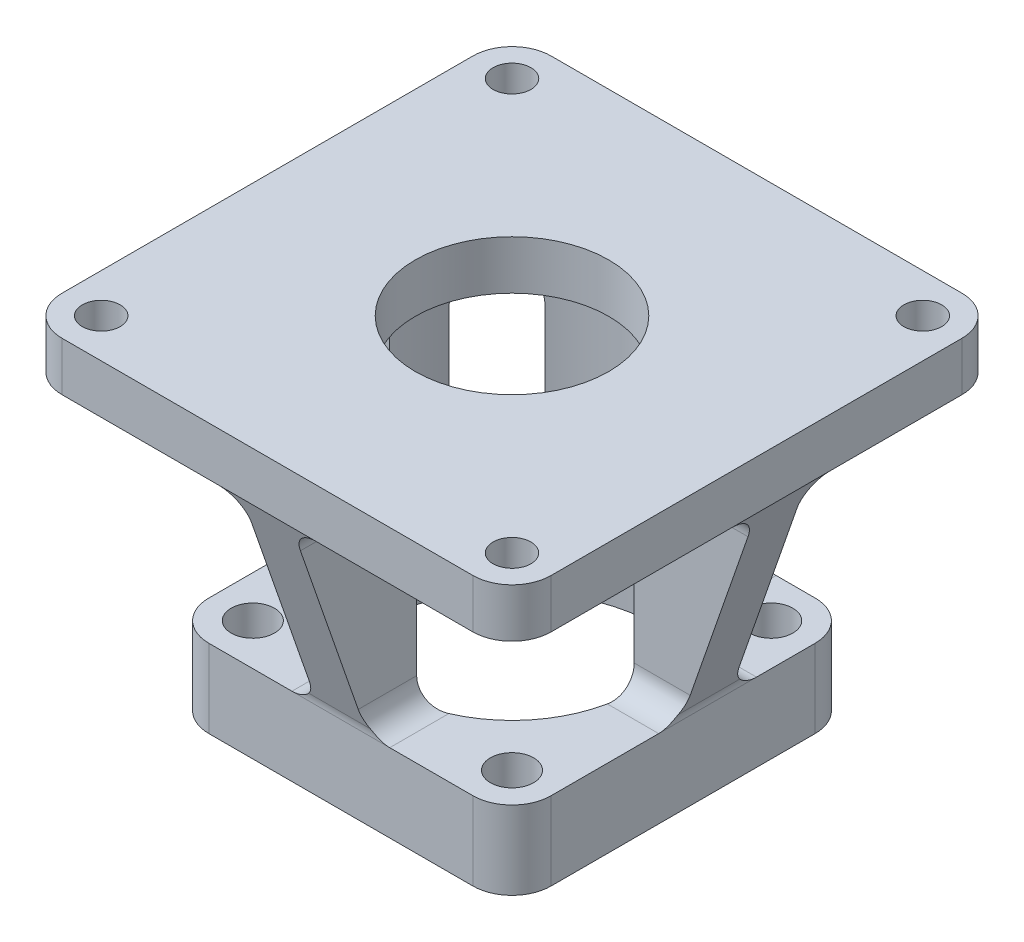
ISO-10303-21;
HEADER;
FILE_DESCRIPTION(('STEP AP214'),'2;1');
FILE_NAME('part.step','',(''),(''),'','','');
FILE_SCHEMA(('AUTOMOTIVE_DESIGN { 1 0 10303 214 1 1 1 1 }'));
ENDSEC;
DATA;
#1=APPLICATION_CONTEXT('core data for automotive mechanical design processes');
#2=APPLICATION_PROTOCOL_DEFINITION('international standard','automotive_design',2000,#1);
#3=PRODUCT_CONTEXT('',#1,'mechanical');
#4=PRODUCT('Part','Part','',(#3));
#5=PRODUCT_RELATED_PRODUCT_CATEGORY('part','',(#4));
#6=PRODUCT_DEFINITION_FORMATION('','',#4);
#7=PRODUCT_DEFINITION_CONTEXT('part definition',#1,'design');
#8=PRODUCT_DEFINITION('design','',#6,#7);
#9=PRODUCT_DEFINITION_SHAPE('','',#8);
#10=(LENGTH_UNIT() NAMED_UNIT(*) SI_UNIT(.MILLI.,.METRE.));
#11=(NAMED_UNIT(*) PLANE_ANGLE_UNIT() SI_UNIT($,.RADIAN.));
#12=(NAMED_UNIT(*) SI_UNIT($,.STERADIAN.) SOLID_ANGLE_UNIT());
#13=UNCERTAINTY_MEASURE_WITH_UNIT(LENGTH_MEASURE(1.E-05),#10,'distance_accuracy_value','');
#14=(GEOMETRIC_REPRESENTATION_CONTEXT(3) GLOBAL_UNCERTAINTY_ASSIGNED_CONTEXT((#13)) GLOBAL_UNIT_ASSIGNED_CONTEXT((#10,
#11,#12)) REPRESENTATION_CONTEXT('',''));
#15=CARTESIAN_POINT('',(0.,0.,0.));
#16=DIRECTION('',(0.,0.,1.));
#17=DIRECTION('',(1.,0.,0.));
#18=AXIS2_PLACEMENT_3D('',#15,#16,#17);
#19=CARTESIAN_POINT('',(0.,44.45,0.));
#20=DIRECTION('',(0.,-1.,0.));
#21=DIRECTION('',(0.,0.,-1.));
#22=AXIS2_PLACEMENT_3D('',#19,#20,#21);
#23=CYLINDRICAL_SURFACE('',#22,15.875);
#24=CARTESIAN_POINT('',(0.,7.62,0.));
#25=DIRECTION('',(0.,-1.,0.));
#26=DIRECTION('',(0.,0.,-1.));
#27=AXIS2_PLACEMENT_3D('',#24,#25,#26);
#28=CIRCLE('',#27,15.875);
#29=CARTESIAN_POINT('',(0.,7.62,-15.875));
#30=VERTEX_POINT('',#29);
#31=EDGE_CURVE('E411',#30,#30,#28,.T.);
#32=ORIENTED_EDGE('',*,*,#31,.T.);
#33=EDGE_LOOP('',(#32));
#34=FACE_BOUND('',#33,.T.);
#35=CARTESIAN_POINT('',(15.8749997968,34.925,0.00254));
#36=CARTESIAN_POINT('',(15.8749941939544,35.0142663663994,0.00253146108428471));
#37=CARTESIAN_POINT('',(15.8749990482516,35.1035286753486,0.00630460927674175));
#38=CARTESIAN_POINT('',(15.8749889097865,35.2814152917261,0.0213481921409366));
#39=CARTESIAN_POINT('',(15.8749739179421,35.3700396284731,0.0326182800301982));
#40=CARTESIAN_POINT('',(15.8748833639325,35.5459684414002,0.0625793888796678));
#41=CARTESIAN_POINT('',(15.874807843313,35.6332737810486,0.0812653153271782));
#42=CARTESIAN_POINT('',(15.87451624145,35.8059791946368,0.125906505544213));
#43=CARTESIAN_POINT('',(15.8743001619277,35.8913792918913,0.151861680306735));
#44=CARTESIAN_POINT('',(15.8732909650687,36.143901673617,0.240422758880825));
#45=CARTESIAN_POINT('',(15.8721369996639,36.307413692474,0.313735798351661));
#46=CARTESIAN_POINT('',(15.8677715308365,36.6196775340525,0.486705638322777));
#47=CARTESIAN_POINT('',(15.8645603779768,36.7684318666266,0.586357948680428));
#48=CARTESIAN_POINT('',(15.8547643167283,37.0468377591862,0.808970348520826));
#49=CARTESIAN_POINT('',(15.8481850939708,37.1765210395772,0.931890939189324));
#50=CARTESIAN_POINT('',(15.830326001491,37.4133426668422,1.19753029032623));
#51=CARTESIAN_POINT('',(15.8190459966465,37.5204803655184,1.34024961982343));
#52=CARTESIAN_POINT('',(15.7907598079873,37.7085452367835,1.6401326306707));
#53=CARTESIAN_POINT('',(15.7737930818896,37.7896456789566,1.79719149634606));
#54=CARTESIAN_POINT('',(15.7334056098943,37.924503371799,2.12185567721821));
#55=CARTESIAN_POINT('',(15.7099868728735,37.9782691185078,2.28945769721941));
#56=CARTESIAN_POINT('',(15.6647465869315,38.0452288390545,2.57791976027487));
#57=CARTESIAN_POINT('',(15.6446278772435,38.0658026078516,2.69739478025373));
#58=CARTESIAN_POINT('',(15.6013967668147,38.0931888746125,2.93718093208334));
#59=CARTESIAN_POINT('',(15.578289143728,38.1000230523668,3.05749044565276));
#60=CARTESIAN_POINT('',(15.5537411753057,38.1,3.17754));
#61=B_SPLINE_CURVE_WITH_KNOTS('',3,(#35,#36,#37,#38,#39,#40,#41,#42,#43,#44,#45,#46,#47,#48,#49,
#50,#51,#52,#53,#54,#55,#56,#57,#58,#59,#60),.UNSPECIFIED.,.F.,.F.,(4,2,2,2,2,2,2,2,2,2,2,2,4),
(0.,0.267712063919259,0.535411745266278,0.802927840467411,1.07044066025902,1.60526300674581,
2.13999423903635,2.67382575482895,3.20767261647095,3.73788949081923,4.26794146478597,
4.63584990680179,5.00317736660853),.UNSPECIFIED.);
#62=CARTESIAN_POINT('',(15.8749997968,34.925,0.00254));
#63=VERTEX_POINT('',#62);
#64=CARTESIAN_POINT('',(15.5537411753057,38.1,3.17754));
#65=VERTEX_POINT('',#64);
#66=EDGE_CURVE('E409',#63,#65,#61,.T.);
#67=ORIENTED_EDGE('',*,*,#66,.T.);
#68=CARTESIAN_POINT('',(0.,38.1,0.));
#69=DIRECTION('',(0.,1.,0.));
#70=DIRECTION('',(0.,0.,1.));
#71=AXIS2_PLACEMENT_3D('',#68,#69,#70);
#72=CIRCLE('',#71,15.875);
#73=CARTESIAN_POINT('',(12.7019046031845,38.1,-9.52246));
#74=VERTEX_POINT('',#73);
#75=EDGE_CURVE('E388',#65,#74,#72,.T.);
#76=ORIENTED_EDGE('',*,*,#75,.T.);
#77=CARTESIAN_POINT('',(12.7019046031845,38.1,-9.52246));
#78=CARTESIAN_POINT('',(12.7828609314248,38.100000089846,-9.41450653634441));
#79=CARTESIAN_POINT('',(12.8624452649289,38.0944911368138,-9.30544903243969));
#80=CARTESIAN_POINT('',(13.018406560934,38.0717915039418,-9.08596222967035));
#81=CARTESIAN_POINT('',(13.0947771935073,38.0545788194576,-8.97553073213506));
#82=CARTESIAN_POINT('',(13.2438555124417,38.0077032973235,-8.75407523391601));
#83=CARTESIAN_POINT('',(13.3165461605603,37.9779875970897,-8.64305071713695));
#84=CARTESIAN_POINT('',(13.4571843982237,37.905604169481,-8.42240714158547));
#85=CARTESIAN_POINT('',(13.5251362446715,37.8629482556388,-8.31278689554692));
#86=CARTESIAN_POINT('',(13.6837994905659,37.7429990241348,-8.04994943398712));
#87=CARTESIAN_POINT('',(13.7718016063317,37.6586949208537,-7.89815719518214));
#88=CARTESIAN_POINT('',(13.8942289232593,37.5117868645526,-7.67939355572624));
#89=CARTESIAN_POINT('',(13.9334164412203,37.4594553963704,-7.60800961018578));
#90=CARTESIAN_POINT('',(14.0084963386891,37.3480721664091,-7.46886043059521));
#91=CARTESIAN_POINT('',(14.0443902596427,37.2890235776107,-7.40109351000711));
#92=CARTESIAN_POINT('',(14.1129458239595,37.1640135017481,-7.2695208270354));
#93=CARTESIAN_POINT('',(14.1455850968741,37.0980098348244,-7.20574347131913));
#94=CARTESIAN_POINT('',(14.2072223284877,36.9597788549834,-7.08344163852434));
#95=CARTESIAN_POINT('',(14.2362218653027,36.8875542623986,-7.02491488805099));
#96=CARTESIAN_POINT('',(14.2905147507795,36.7372541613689,-6.91380090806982));
#97=CARTESIAN_POINT('',(14.3158046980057,36.6591733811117,-6.86121913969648));
#98=CARTESIAN_POINT('',(14.3625690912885,36.4978081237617,-6.76278088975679));
#99=CARTESIAN_POINT('',(14.3840440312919,36.4145243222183,-6.71692353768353));
#100=CARTESIAN_POINT('',(14.4212771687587,36.2515600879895,-6.6365774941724));
#101=CARTESIAN_POINT('',(14.4373843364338,36.1722866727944,-6.60142314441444));
#102=CARTESIAN_POINT('',(14.4664128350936,36.0106232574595,-6.53756498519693));
#103=CARTESIAN_POINT('',(14.4793344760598,35.9282335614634,-6.50886054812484));
#104=CARTESIAN_POINT('',(14.5019645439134,35.761095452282,-6.45828281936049));
#105=CARTESIAN_POINT('',(14.5116778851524,35.6763508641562,-6.43639908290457));
#106=CARTESIAN_POINT('',(14.5279110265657,35.505085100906,-6.39967414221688));
#107=CARTESIAN_POINT('',(14.5344323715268,35.4185648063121,-6.38482953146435));
#108=CARTESIAN_POINT('',(14.5431720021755,35.2641331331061,-6.36489321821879));
#109=CARTESIAN_POINT('',(14.5460300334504,35.1964403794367,-6.35835480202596));
#110=CARTESIAN_POINT('',(14.549835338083,35.0608338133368,-6.34963946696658));
#111=CARTESIAN_POINT('',(14.5507857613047,34.9929205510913,-6.34745535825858));
#112=CARTESIAN_POINT('',(14.5507861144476,34.925,-6.34746));
#113=B_SPLINE_CURVE_WITH_KNOTS('',3,(#77,#78,#79,#80,#81,#82,#83,#84,#85,#86,#87,#88,#89,#90,
#91,#92,#93,#94,#95,#96,#97,#98,#99,#100,#101,#102,#103,#104,#105,#106,#107,#108,#109,#110,#111,
#112),.UNSPECIFIED.,.F.,.F.,(4,2,2,2,2,2,2,2,2,2,2,2,2,2,2,2,2,4),(0.,0.404774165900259,
0.810311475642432,1.21758089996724,1.6244796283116,2.20556182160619,2.49567142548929,
2.78564455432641,3.07749028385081,3.36920903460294,3.66119362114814,3.95314037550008,
4.21740717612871,4.48164825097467,4.74548267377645,5.00918928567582,5.21323228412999,
5.4169380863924),.UNSPECIFIED.);
#114=CARTESIAN_POINT('',(14.5507861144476,34.925,-6.34746));
#115=VERTEX_POINT('',#114);
#116=EDGE_CURVE('E397',#74,#115,#113,.T.);
#117=ORIENTED_EDGE('',*,*,#116,.T.);
#118=DIRECTION('',(0.,-1.,0.));
#119=VECTOR('',#118,1.);
#120=CARTESIAN_POINT('',(14.5507861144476,44.45,-6.34746));
#121=LINE('',#120,#119);
#122=CARTESIAN_POINT('',(14.5507861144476,13.335,-6.34746));
#123=VERTEX_POINT('',#122);
#124=EDGE_CURVE('E1077',#123,#115,#121,.F.);
#125=ORIENTED_EDGE('',*,*,#124,.F.);
#126=CARTESIAN_POINT('',(14.5507861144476,13.335,-6.34746));
#127=CARTESIAN_POINT('',(14.5507857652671,13.251920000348,-6.34744832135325));
#128=CARTESIAN_POINT('',(14.5493635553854,13.1688449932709,-6.35072072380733));
#129=CARTESIAN_POINT('',(14.5436745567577,13.0033136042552,-6.36374479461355));
#130=CARTESIAN_POINT('',(14.5394081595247,12.9208571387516,-6.37349557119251));
#131=CARTESIAN_POINT('',(14.5280427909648,12.757333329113,-6.3993582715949));
#132=CARTESIAN_POINT('',(14.5209502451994,12.676263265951,-6.41545576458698));
#133=CARTESIAN_POINT('',(14.5039391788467,12.5159224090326,-6.4538213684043));
#134=CARTESIAN_POINT('',(14.4940206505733,12.4366516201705,-6.47608949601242));
#135=CARTESIAN_POINT('',(14.4600212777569,12.2023648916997,-6.55183298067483));
#136=CARTESIAN_POINT('',(14.4316871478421,12.0507358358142,-6.61426975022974));
#137=CARTESIAN_POINT('',(14.3638308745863,11.7608948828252,-6.76035704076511));
#138=CARTESIAN_POINT('',(14.3243061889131,11.6226860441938,-6.84401238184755));
#139=CARTESIAN_POINT('',(14.2334166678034,11.3600814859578,-7.03110810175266));
#140=CARTESIAN_POINT('',(14.1818226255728,11.2360329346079,-7.1349238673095));
#141=CARTESIAN_POINT('',(14.0678698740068,11.0075460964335,-7.35705231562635));
#142=CARTESIAN_POINT('',(14.0055123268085,10.9031056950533,-7.47536343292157));
#143=CARTESIAN_POINT('',(13.8660758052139,10.7083336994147,-7.73112107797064));
#144=CARTESIAN_POINT('',(13.7882652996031,10.6195335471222,-7.86933007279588));
#145=CARTESIAN_POINT('',(13.6223929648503,10.4659285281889,-8.15310149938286));
#146=CARTESIAN_POINT('',(13.5343119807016,10.4011694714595,-8.2986773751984));
#147=CARTESIAN_POINT('',(13.3856586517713,10.3158610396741,-8.53528189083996));
#148=CARTESIAN_POINT('',(13.3277633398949,10.287921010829,-8.62542999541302));
#149=CARTESIAN_POINT('',(13.20907936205,10.2404590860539,-8.80610692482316));
#150=CARTESIAN_POINT('',(13.1482895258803,10.2209406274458,-8.89663588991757));
#151=CARTESIAN_POINT('',(13.0244300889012,10.1900794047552,-9.07699057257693));
#152=CARTESIAN_POINT('',(12.9613699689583,10.1787060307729,-9.16681765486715));
#153=CARTESIAN_POINT('',(12.8331451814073,10.1636701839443,-9.34548873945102));
#154=CARTESIAN_POINT('',(12.7679825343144,10.1600005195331,-9.4343335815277));
#155=CARTESIAN_POINT('',(12.7019046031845,10.16,-9.52246));
#156=B_SPLINE_CURVE_WITH_KNOTS('',3,(#126,#127,#128,#129,#130,#131,#132,#133,#134,#135,#136,
#137,#138,#139,#140,#141,#142,#143,#144,#145,#146,#147,#148,#149,#150,#151,#152,#153,#154,#155),
.UNSPECIFIED.,.F.,.F.,(4,2,2,2,2,2,2,2,2,2,2,2,2,2,4),(0.,0.249154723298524,0.498275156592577,
0.746832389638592,0.995390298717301,1.49208890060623,1.98890043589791,2.4960471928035,
3.00313922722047,3.54629141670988,4.09047332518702,4.42231489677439,4.75429178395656,
5.085014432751,5.41542820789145),.UNSPECIFIED.);
#157=CARTESIAN_POINT('',(12.7019046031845,10.16,-9.52246));
#158=VERTEX_POINT('',#157);
#159=EDGE_CURVE('E405',#123,#158,#156,.T.);
#160=ORIENTED_EDGE('',*,*,#159,.T.);
#161=CARTESIAN_POINT('',(0.,10.16,0.));
#162=DIRECTION('',(0.,1.,0.));
#163=DIRECTION('',(0.,0.,1.));
#164=AXIS2_PLACEMENT_3D('',#161,#162,#163);
#165=CIRCLE('',#164,15.875);
#166=CARTESIAN_POINT('',(12.065,10.16,-10.3175287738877));
#167=VERTEX_POINT('',#166);
#168=EDGE_CURVE('E916',#158,#167,#165,.T.);
#169=ORIENTED_EDGE('',*,*,#168,.T.);
#170=CARTESIAN_POINT('',(12.065,10.16,-10.3175287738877));
#171=CARTESIAN_POINT('',(11.9784964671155,10.1600107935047,-10.4186973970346));
#172=CARTESIAN_POINT('',(11.8906806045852,10.163537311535,-10.5187966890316));
#173=CARTESIAN_POINT('',(11.7127495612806,10.1783330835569,-10.7165649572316));
#174=CARTESIAN_POINT('',(11.6226316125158,10.1896121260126,-10.8142306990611));
#175=CARTESIAN_POINT('',(11.4397975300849,10.2207718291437,-11.0074755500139));
#176=CARTESIAN_POINT('',(11.3470650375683,10.2407314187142,-11.1030268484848));
#177=CARTESIAN_POINT('',(11.160540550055,10.2900229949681,-11.290503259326));
#178=CARTESIAN_POINT('',(11.0667490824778,10.3193504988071,-11.3824300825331));
#179=CARTESIAN_POINT('',(10.8161228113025,10.4111744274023,-11.6221300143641));
#180=CARTESIAN_POINT('',(10.6589553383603,10.4827479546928,-11.7662656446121));
#181=CARTESIAN_POINT('',(10.3496740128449,10.6573744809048,-12.0391957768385));
#182=CARTESIAN_POINT('',(10.1975440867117,10.7603138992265,-12.168043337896));
#183=CARTESIAN_POINT('',(9.93116650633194,10.9788320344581,-12.3859501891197));
#184=CARTESIAN_POINT('',(9.81497421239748,11.0889657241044,-12.478017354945));
#185=CARTESIAN_POINT('',(9.65087762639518,11.2711804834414,-12.6048012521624));
#186=CARTESIAN_POINT('',(9.59784395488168,11.3348048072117,-12.6452006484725));
#187=CARTESIAN_POINT('',(9.49590274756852,11.4675534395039,-12.7219303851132));
#188=CARTESIAN_POINT('',(9.44699336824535,11.5366752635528,-12.7582625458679));
#189=CARTESIAN_POINT('',(9.35363326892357,11.6807488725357,-12.8268686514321));
#190=CARTESIAN_POINT('',(9.30922372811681,11.7557449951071,-12.8591057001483));
#191=CARTESIAN_POINT('',(9.22610353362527,11.9105677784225,-12.9188721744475));
#192=CARTESIAN_POINT('',(9.1873899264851,11.990391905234,-12.9464040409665));
#193=CARTESIAN_POINT('',(9.11637080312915,12.154249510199,-12.9965110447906));
#194=CARTESIAN_POINT('',(9.08405919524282,12.2382788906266,-13.0190908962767));
#195=CARTESIAN_POINT('',(9.02643241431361,12.4098361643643,-13.0591106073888));
#196=CARTESIAN_POINT('',(9.00111479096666,12.4973628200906,-13.0765522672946));
#197=CARTESIAN_POINT('',(8.95011953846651,12.7075635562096,-13.1115326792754));
#198=CARTESIAN_POINT('',(8.92766291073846,12.8314382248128,-13.1267975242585));
#199=CARTESIAN_POINT('',(8.90511497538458,13.0191653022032,-13.1420935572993));
#200=CARTESIAN_POINT('',(8.89945510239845,13.0821153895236,-13.1459253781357));
#201=CARTESIAN_POINT('',(8.8918962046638,13.2083681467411,-13.151038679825));
#202=CARTESIAN_POINT('',(8.88999861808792,13.2716709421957,-13.1523191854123));
#203=CARTESIAN_POINT('',(8.89,13.335,-13.1523201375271));
#204=B_SPLINE_CURVE_WITH_KNOTS('',3,(#170,#171,#172,#173,#174,#175,#176,#177,#178,#179,#180,
#181,#182,#183,#184,#185,#186,#187,#188,#189,#190,#191,#192,#193,#194,#195,#196,#197,#198,#199,
#200,#201,#202,#203),.UNSPECIFIED.,.F.,.F.,(4,2,2,2,2,2,2,2,2,2,2,2,2,2,2,2,4),(0.,
0.399327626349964,0.799160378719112,1.20270725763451,1.60606131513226,2.27839041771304,
2.94831328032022,3.49989361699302,3.77606961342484,4.05212149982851,4.33050661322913,
4.60874686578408,4.88672108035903,5.1645977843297,5.54358407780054,5.733405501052,
5.92329947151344),.UNSPECIFIED.);
#205=CARTESIAN_POINT('',(8.89,13.335,-13.1523201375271));
#206=VERTEX_POINT('',#205);
#207=EDGE_CURVE('E570',#167,#206,#204,.T.);
#208=ORIENTED_EDGE('',*,*,#207,.T.);
#209=DIRECTION('',(0.,-1.,0.));
#210=VECTOR('',#209,1.);
#211=CARTESIAN_POINT('',(8.89,44.45,-13.1523201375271));
#212=LINE('',#211,#210);
#213=CARTESIAN_POINT('',(8.89,34.925,-13.1523201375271));
#214=VERTEX_POINT('',#213);
#215=EDGE_CURVE('E911',#206,#214,#212,.F.);
#216=ORIENTED_EDGE('',*,*,#215,.T.);
#217=CARTESIAN_POINT('',(8.89,34.925,-13.1523201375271));
#218=CARTESIAN_POINT('',(8.88998592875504,35.0021470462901,-13.1523242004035));
#219=CARTESIAN_POINT('',(8.89281146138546,35.0792873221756,-13.1504196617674));
#220=CARTESIAN_POINT('',(8.90403494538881,35.2329524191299,-13.1428258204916));
#221=CARTESIAN_POINT('',(8.91243130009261,35.3094774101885,-13.1371376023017));
#222=CARTESIAN_POINT('',(8.93464388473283,35.4610419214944,-13.1220399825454));
#223=CARTESIAN_POINT('',(8.94843763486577,35.5360862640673,-13.1126460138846));
#224=CARTESIAN_POINT('',(8.9812299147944,35.6844528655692,-13.0902072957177));
#225=CARTESIAN_POINT('',(9.00022860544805,35.7577750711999,-13.0771624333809));
#226=CARTESIAN_POINT('',(9.06463327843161,35.9742938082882,-13.0326819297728));
#227=CARTESIAN_POINT('',(9.11748389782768,36.1142816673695,-12.9958764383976));
#228=CARTESIAN_POINT('',(9.24022001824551,36.3820550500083,-12.9088954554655));
#229=CARTESIAN_POINT('',(9.31011863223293,36.5098310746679,-12.8587096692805));
#230=CARTESIAN_POINT('',(9.46695716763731,36.7561225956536,-12.7437108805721));
#231=CARTESIAN_POINT('',(9.55450355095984,36.8739982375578,-12.6783589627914));
#232=CARTESIAN_POINT('',(9.74057286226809,37.0925554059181,-12.5359727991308));
#233=CARTESIAN_POINT('',(9.83909420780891,37.1932394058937,-12.4589402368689));
#234=CARTESIAN_POINT('',(10.08502293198,37.4145054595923,-12.2613907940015));
#235=CARTESIAN_POINT('',(10.2360656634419,37.5266244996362,-12.1359001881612));
#236=CARTESIAN_POINT('',(10.5450592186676,37.718515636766,-11.8684192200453));
#237=CARTESIAN_POINT('',(10.7030402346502,37.7981267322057,-11.7263511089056));
#238=CARTESIAN_POINT('',(10.9645315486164,37.905284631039,-11.4810679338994));
#239=CARTESIAN_POINT('',(11.0680185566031,37.9413172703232,-11.3813712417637));
#240=CARTESIAN_POINT('',(11.2739995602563,38.0017624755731,-11.1773682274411));
#241=CARTESIAN_POINT('',(11.3764927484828,38.0261662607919,-11.073058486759));
#242=CARTESIAN_POINT('',(11.5782868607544,38.0641348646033,-10.8618587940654));
#243=CARTESIAN_POINT('',(11.6776108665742,38.0778201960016,-10.7550118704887));
#244=CARTESIAN_POINT('',(11.8734847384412,38.095736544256,-10.5383766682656));
#245=CARTESIAN_POINT('',(11.9700393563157,38.0999848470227,-10.4285941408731));
#246=CARTESIAN_POINT('',(12.065,38.1,-10.3175287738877));
#247=B_SPLINE_CURVE_WITH_KNOTS('',3,(#217,#218,#219,#220,#221,#222,#223,#224,#225,#226,#227,
#228,#229,#230,#231,#232,#233,#234,#235,#236,#237,#238,#239,#240,#241,#242,#243,#244,#245,#246),
.UNSPECIFIED.,.F.,.F.,(4,2,2,2,2,2,2,2,2,2,2,2,2,2,4),(0.,0.231354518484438,0.462642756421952,
0.692977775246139,0.923319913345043,1.38328431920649,1.84360364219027,2.32383910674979,
2.80400541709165,3.47869383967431,4.15668439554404,4.60061915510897,5.04488859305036,
5.48408817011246,5.92248259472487),.UNSPECIFIED.);
#248=CARTESIAN_POINT('',(12.065,38.1,-10.3175287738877));
#249=VERTEX_POINT('',#248);
#250=EDGE_CURVE('E577',#214,#249,#247,.T.);
#251=ORIENTED_EDGE('',*,*,#250,.T.);
#252=CARTESIAN_POINT('',(-12.065,38.1,-10.3175287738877));
#253=VERTEX_POINT('',#252);
#254=EDGE_CURVE('E412',#249,#253,#72,.T.);
#255=ORIENTED_EDGE('',*,*,#254,.T.);
#256=CARTESIAN_POINT('',(-12.065,38.1,-10.3175287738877));
#257=CARTESIAN_POINT('',(-11.9784964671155,38.0999892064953,-10.4186973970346));
#258=CARTESIAN_POINT('',(-11.8906806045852,38.096462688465,-10.5187966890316));
#259=CARTESIAN_POINT('',(-11.7127495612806,38.0816669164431,-10.7165649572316));
#260=CARTESIAN_POINT('',(-11.6226316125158,38.0703878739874,-10.8142306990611));
#261=CARTESIAN_POINT('',(-11.4397975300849,38.0392281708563,-11.0074755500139));
#262=CARTESIAN_POINT('',(-11.3470650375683,38.0192685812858,-11.1030268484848));
#263=CARTESIAN_POINT('',(-11.160540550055,37.9699770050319,-11.290503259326));
#264=CARTESIAN_POINT('',(-11.0667490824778,37.9406495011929,-11.3824300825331));
#265=CARTESIAN_POINT('',(-10.8161228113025,37.8488255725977,-11.6221300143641));
#266=CARTESIAN_POINT('',(-10.6589553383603,37.7772520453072,-11.7662656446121));
#267=CARTESIAN_POINT('',(-10.3496740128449,37.6026255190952,-12.0391957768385));
#268=CARTESIAN_POINT('',(-10.1975440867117,37.4996861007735,-12.168043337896));
#269=CARTESIAN_POINT('',(-9.93116650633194,37.2811679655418,-12.3859501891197));
#270=CARTESIAN_POINT('',(-9.81497421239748,37.1710342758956,-12.478017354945));
#271=CARTESIAN_POINT('',(-9.65087762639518,36.9888195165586,-12.6048012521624));
#272=CARTESIAN_POINT('',(-9.59784395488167,36.9251951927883,-12.6452006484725));
#273=CARTESIAN_POINT('',(-9.49590274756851,36.7924465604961,-12.7219303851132));
#274=CARTESIAN_POINT('',(-9.44699336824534,36.7233247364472,-12.7582625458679));
#275=CARTESIAN_POINT('',(-9.35363326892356,36.5792511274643,-12.8268686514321));
#276=CARTESIAN_POINT('',(-9.3092237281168,36.5042550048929,-12.8591057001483));
#277=CARTESIAN_POINT('',(-9.22610353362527,36.3494322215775,-12.9188721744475));
#278=CARTESIAN_POINT('',(-9.18738992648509,36.269608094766,-12.9464040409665));
#279=CARTESIAN_POINT('',(-9.11637080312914,36.105750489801,-12.9965110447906));
#280=CARTESIAN_POINT('',(-9.08405919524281,36.0217211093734,-13.0190908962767));
#281=CARTESIAN_POINT('',(-9.0264324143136,35.8501638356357,-13.0591106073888));
#282=CARTESIAN_POINT('',(-9.00111479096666,35.7626371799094,-13.0765522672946));
#283=CARTESIAN_POINT('',(-8.95011953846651,35.5524364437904,-13.1115326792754));
#284=CARTESIAN_POINT('',(-8.92766291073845,35.4285617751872,-13.1267975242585));
#285=CARTESIAN_POINT('',(-8.90511497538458,35.2408346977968,-13.1420935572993));
#286=CARTESIAN_POINT('',(-8.89945510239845,35.1778846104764,-13.1459253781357));
#287=CARTESIAN_POINT('',(-8.8918962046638,35.0516318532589,-13.151038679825));
#288=CARTESIAN_POINT('',(-8.88999861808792,34.9883290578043,-13.1523191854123));
#289=CARTESIAN_POINT('',(-8.89,34.925,-13.1523201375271));
#290=B_SPLINE_CURVE_WITH_KNOTS('',3,(#256,#257,#258,#259,#260,#261,#262,#263,#264,#265,#266,
#267,#268,#269,#270,#271,#272,#273,#274,#275,#276,#277,#278,#279,#280,#281,#282,#283,#284,#285,
#286,#287,#288,#289),.UNSPECIFIED.,.F.,.F.,(4,2,2,2,2,2,2,2,2,2,2,2,2,2,2,2,4),(0.,
0.399327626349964,0.799160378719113,1.20270725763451,1.60606131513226,2.27839041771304,
2.94831328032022,3.49989361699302,3.77606961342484,4.05212149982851,4.33050661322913,
4.60874686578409,4.88672108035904,5.16459778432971,5.54358407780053,5.733405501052,
5.92329947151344),.UNSPECIFIED.);
#291=CARTESIAN_POINT('',(-8.89,34.925,-13.1523201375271));
#292=VERTEX_POINT('',#291);
#293=EDGE_CURVE('E548',#253,#292,#290,.T.);
#294=ORIENTED_EDGE('',*,*,#293,.T.);
#295=DIRECTION('',(0.,-1.,0.));
#296=VECTOR('',#295,1.);
#297=CARTESIAN_POINT('',(-8.89,44.45,-13.1523201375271));
#298=LINE('',#297,#296);
#299=CARTESIAN_POINT('',(-8.89,13.335,-13.1523201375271));
#300=VERTEX_POINT('',#299);
#301=EDGE_CURVE('E930',#300,#292,#298,.F.);
#302=ORIENTED_EDGE('',*,*,#301,.F.);
#303=CARTESIAN_POINT('',(-8.89,13.335,-13.1523201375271));
#304=CARTESIAN_POINT('',(-8.88998592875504,13.2578529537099,-13.1523242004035));
#305=CARTESIAN_POINT('',(-8.89281146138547,13.1807126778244,-13.1504196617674));
#306=CARTESIAN_POINT('',(-8.90403494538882,13.0270475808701,-13.1428258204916));
#307=CARTESIAN_POINT('',(-8.91243130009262,12.9505225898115,-13.1371376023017));
#308=CARTESIAN_POINT('',(-8.93464388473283,12.7989580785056,-13.1220399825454));
#309=CARTESIAN_POINT('',(-8.94843763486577,12.7239137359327,-13.1126460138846));
#310=CARTESIAN_POINT('',(-8.9812299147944,12.5755471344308,-13.0902072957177));
#311=CARTESIAN_POINT('',(-9.00022860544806,12.5022249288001,-13.0771624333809));
#312=CARTESIAN_POINT('',(-9.06463327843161,12.2857061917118,-13.0326819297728));
#313=CARTESIAN_POINT('',(-9.11748389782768,12.1457183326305,-12.9958764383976));
#314=CARTESIAN_POINT('',(-9.24022001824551,11.8779449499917,-12.9088954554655));
#315=CARTESIAN_POINT('',(-9.31011863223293,11.7501689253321,-12.8587096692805));
#316=CARTESIAN_POINT('',(-9.46695716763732,11.5038774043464,-12.7437108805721));
#317=CARTESIAN_POINT('',(-9.55450355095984,11.3860017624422,-12.6783589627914));
#318=CARTESIAN_POINT('',(-9.7405728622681,11.1674445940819,-12.5359727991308));
#319=CARTESIAN_POINT('',(-9.83909420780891,11.0667605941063,-12.4589402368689));
#320=CARTESIAN_POINT('',(-10.08502293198,10.8454945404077,-12.2613907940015));
#321=CARTESIAN_POINT('',(-10.2360656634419,10.7333755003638,-12.1359001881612));
#322=CARTESIAN_POINT('',(-10.5450592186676,10.541484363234,-11.8684192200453));
#323=CARTESIAN_POINT('',(-10.7030402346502,10.4618732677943,-11.7263511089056));
#324=CARTESIAN_POINT('',(-10.9645315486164,10.354715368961,-11.4810679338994));
#325=CARTESIAN_POINT('',(-11.0680185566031,10.3186827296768,-11.3813712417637));
#326=CARTESIAN_POINT('',(-11.2739995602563,10.2582375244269,-11.1773682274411));
#327=CARTESIAN_POINT('',(-11.3764927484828,10.2338337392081,-11.073058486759));
#328=CARTESIAN_POINT('',(-11.5782868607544,10.1958651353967,-10.8618587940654));
#329=CARTESIAN_POINT('',(-11.6776108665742,10.1821798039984,-10.7550118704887));
#330=CARTESIAN_POINT('',(-11.8734847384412,10.164263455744,-10.5383766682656));
#331=CARTESIAN_POINT('',(-11.9700393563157,10.1600151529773,-10.428594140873));
#332=CARTESIAN_POINT('',(-12.065,10.16,-10.3175287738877));
#333=B_SPLINE_CURVE_WITH_KNOTS('',3,(#303,#304,#305,#306,#307,#308,#309,#310,#311,#312,#313,
#314,#315,#316,#317,#318,#319,#320,#321,#322,#323,#324,#325,#326,#327,#328,#329,#330,#331,#332),
.UNSPECIFIED.,.F.,.F.,(4,2,2,2,2,2,2,2,2,2,2,2,2,2,4),(0.,0.231354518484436,0.462642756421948,
0.692977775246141,0.923319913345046,1.3832843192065,1.84360364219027,2.3238391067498,
2.80400541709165,3.47869383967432,4.15668439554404,4.60061915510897,5.04488859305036,
5.48408817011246,5.92248259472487),.UNSPECIFIED.);
#334=CARTESIAN_POINT('',(-12.065,10.16,-10.3175287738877));
#335=VERTEX_POINT('',#334);
#336=EDGE_CURVE('E540',#300,#335,#333,.T.);
#337=ORIENTED_EDGE('',*,*,#336,.T.);
#338=CARTESIAN_POINT('',(0.,10.16,0.));
#339=DIRECTION('',(0.,-1.,0.));
#340=DIRECTION('',(0.,0.,-1.));
#341=AXIS2_PLACEMENT_3D('',#338,#339,#340);
#342=CIRCLE('',#341,15.875);
#343=CARTESIAN_POINT('',(-12.7019046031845,10.16,-9.52246));
#344=VERTEX_POINT('',#343);
#345=EDGE_CURVE('E927',#344,#335,#342,.T.);
#346=ORIENTED_EDGE('',*,*,#345,.F.);
#347=CARTESIAN_POINT('',(-12.7019046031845,10.16,-9.52246));
#348=CARTESIAN_POINT('',(-12.7828609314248,10.159999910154,-9.41450653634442));
#349=CARTESIAN_POINT('',(-12.8624452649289,10.1655088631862,-9.30544903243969));
#350=CARTESIAN_POINT('',(-13.018406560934,10.1882084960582,-9.08596222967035));
#351=CARTESIAN_POINT('',(-13.0947771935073,10.2054211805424,-8.97553073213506));
#352=CARTESIAN_POINT('',(-13.2438555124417,10.2522967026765,-8.75407523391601));
#353=CARTESIAN_POINT('',(-13.3165461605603,10.2820124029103,-8.64305071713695));
#354=CARTESIAN_POINT('',(-13.4571843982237,10.354395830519,-8.42240714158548));
#355=CARTESIAN_POINT('',(-13.5251362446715,10.3970517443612,-8.31278689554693));
#356=CARTESIAN_POINT('',(-13.6837994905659,10.5170009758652,-8.04994943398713));
#357=CARTESIAN_POINT('',(-13.7718016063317,10.6013050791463,-7.89815719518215));
#358=CARTESIAN_POINT('',(-13.8942289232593,10.7482131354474,-7.67939355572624));
#359=CARTESIAN_POINT('',(-13.9334164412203,10.8005446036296,-7.60800961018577));
#360=CARTESIAN_POINT('',(-14.0084963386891,10.9119278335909,-7.46886043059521));
#361=CARTESIAN_POINT('',(-14.0443902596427,10.9709764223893,-7.40109351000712));
#362=CARTESIAN_POINT('',(-14.1129458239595,11.0959864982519,-7.26952082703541));
#363=CARTESIAN_POINT('',(-14.1455850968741,11.1619901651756,-7.20574347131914));
#364=CARTESIAN_POINT('',(-14.2072223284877,11.3002211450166,-7.08344163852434));
#365=CARTESIAN_POINT('',(-14.2362218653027,11.3724457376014,-7.024914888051));
#366=CARTESIAN_POINT('',(-14.2905147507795,11.5227458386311,-6.91380090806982));
#367=CARTESIAN_POINT('',(-14.3158046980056,11.6008266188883,-6.86121913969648));
#368=CARTESIAN_POINT('',(-14.3625690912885,11.7621918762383,-6.76278088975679));
#369=CARTESIAN_POINT('',(-14.3840440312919,11.8454756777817,-6.71692353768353));
#370=CARTESIAN_POINT('',(-14.4212771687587,12.0084399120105,-6.6365774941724));
#371=CARTESIAN_POINT('',(-14.4373843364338,12.0877133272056,-6.60142314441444));
#372=CARTESIAN_POINT('',(-14.4664128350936,12.2493767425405,-6.53756498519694));
#373=CARTESIAN_POINT('',(-14.4793344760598,12.3317664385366,-6.50886054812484));
#374=CARTESIAN_POINT('',(-14.5019645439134,12.498904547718,-6.4582828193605));
#375=CARTESIAN_POINT('',(-14.5116778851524,12.5836491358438,-6.43639908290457));
#376=CARTESIAN_POINT('',(-14.5279110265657,12.754914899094,-6.39967414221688));
#377=CARTESIAN_POINT('',(-14.5344323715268,12.8414351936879,-6.38482953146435));
#378=CARTESIAN_POINT('',(-14.5431720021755,12.9958668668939,-6.3648932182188));
#379=CARTESIAN_POINT('',(-14.5460300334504,13.0635596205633,-6.35835480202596));
#380=CARTESIAN_POINT('',(-14.549835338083,13.1991661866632,-6.34963946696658));
#381=CARTESIAN_POINT('',(-14.5507857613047,13.2670794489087,-6.34745535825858));
#382=CARTESIAN_POINT('',(-14.5507861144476,13.335,-6.34746));
#383=B_SPLINE_CURVE_WITH_KNOTS('',3,(#347,#348,#349,#350,#351,#352,#353,#354,#355,#356,#357,
#358,#359,#360,#361,#362,#363,#364,#365,#366,#367,#368,#369,#370,#371,#372,#373,#374,#375,#376,
#377,#378,#379,#380,#381,#382),.UNSPECIFIED.,.F.,.F.,(4,2,2,2,2,2,2,2,2,2,2,2,2,2,2,2,2,4),(0.,
0.404774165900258,0.81031147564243,1.21758089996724,1.6244796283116,2.20556182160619,
2.4956714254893,2.78564455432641,3.0774902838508,3.36920903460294,3.66119362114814,
3.95314037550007,4.21740717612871,4.48164825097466,4.74548267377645,5.00918928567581,
5.21323228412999,5.41693808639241),.UNSPECIFIED.);
#384=CARTESIAN_POINT('',(-14.5507861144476,13.335,-6.34746));
#385=VERTEX_POINT('',#384);
#386=EDGE_CURVE('E555',#344,#385,#383,.T.);
#387=ORIENTED_EDGE('',*,*,#386,.T.);
#388=DIRECTION('',(0.,-1.,0.));
#389=VECTOR('',#388,1.);
#390=CARTESIAN_POINT('',(-14.5507861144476,44.45,-6.34746));
#391=LINE('',#390,#389);
#392=CARTESIAN_POINT('',(-14.5507861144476,34.925,-6.34746));
#393=VERTEX_POINT('',#392);
#394=EDGE_CURVE('E933',#393,#385,#391,.T.);
#395=ORIENTED_EDGE('',*,*,#394,.F.);
#396=CARTESIAN_POINT('',(-14.5507861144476,34.925,-6.34746));
#397=CARTESIAN_POINT('',(-14.5507857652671,35.008079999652,-6.34744832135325));
#398=CARTESIAN_POINT('',(-14.5493635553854,35.0911550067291,-6.35072072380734));
#399=CARTESIAN_POINT('',(-14.5436745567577,35.2566863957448,-6.36374479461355));
#400=CARTESIAN_POINT('',(-14.5394081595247,35.3391428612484,-6.37349557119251));
#401=CARTESIAN_POINT('',(-14.5280427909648,35.502666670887,-6.3993582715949));
#402=CARTESIAN_POINT('',(-14.5209502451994,35.583736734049,-6.41545576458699));
#403=CARTESIAN_POINT('',(-14.5039391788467,35.7440775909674,-6.4538213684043));
#404=CARTESIAN_POINT('',(-14.4940206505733,35.8233483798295,-6.47608949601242));
#405=CARTESIAN_POINT('',(-14.4600212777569,36.0576351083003,-6.55183298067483));
#406=CARTESIAN_POINT('',(-14.4316871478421,36.2092641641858,-6.61426975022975));
#407=CARTESIAN_POINT('',(-14.3638308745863,36.4991051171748,-6.76035704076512));
#408=CARTESIAN_POINT('',(-14.3243061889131,36.6373139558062,-6.84401238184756));
#409=CARTESIAN_POINT('',(-14.2334166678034,36.8999185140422,-7.03110810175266));
#410=CARTESIAN_POINT('',(-14.1818226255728,37.0239670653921,-7.1349238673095));
#411=CARTESIAN_POINT('',(-14.0678698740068,37.2524539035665,-7.35705231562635));
#412=CARTESIAN_POINT('',(-14.0055123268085,37.3568943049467,-7.47536343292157));
#413=CARTESIAN_POINT('',(-13.8660758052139,37.5516663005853,-7.73112107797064));
#414=CARTESIAN_POINT('',(-13.7882652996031,37.6404664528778,-7.86933007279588));
#415=CARTESIAN_POINT('',(-13.6223929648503,37.7940714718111,-8.15310149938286));
#416=CARTESIAN_POINT('',(-13.5343119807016,37.8588305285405,-8.29867737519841));
#417=CARTESIAN_POINT('',(-13.3856586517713,37.9441389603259,-8.53528189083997));
#418=CARTESIAN_POINT('',(-13.3277633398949,37.972078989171,-8.62542999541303));
#419=CARTESIAN_POINT('',(-13.20907936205,38.0195409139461,-8.80610692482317));
#420=CARTESIAN_POINT('',(-13.1482895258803,38.0390593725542,-8.89663588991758));
#421=CARTESIAN_POINT('',(-13.0244300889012,38.0699205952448,-9.07699057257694));
#422=CARTESIAN_POINT('',(-12.9613699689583,38.0812939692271,-9.16681765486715));
#423=CARTESIAN_POINT('',(-12.8331451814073,38.0963298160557,-9.34548873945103));
#424=CARTESIAN_POINT('',(-12.7679825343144,38.0999994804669,-9.4343335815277));
#425=CARTESIAN_POINT('',(-12.7019046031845,38.1,-9.52246));
#426=B_SPLINE_CURVE_WITH_KNOTS('',3,(#396,#397,#398,#399,#400,#401,#402,#403,#404,#405,#406,
#407,#408,#409,#410,#411,#412,#413,#414,#415,#416,#417,#418,#419,#420,#421,#422,#423,#424,#425),
.UNSPECIFIED.,.F.,.F.,(4,2,2,2,2,2,2,2,2,2,2,2,2,2,4),(0.,0.249154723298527,0.498275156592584,
0.746832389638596,0.995390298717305,1.49208890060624,1.98890043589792,2.4960471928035,
3.00313922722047,3.54629141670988,4.09047332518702,4.4223148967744,4.75429178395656,
5.08501443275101,5.41542820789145),.UNSPECIFIED.);
#427=CARTESIAN_POINT('',(-12.7019046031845,38.1,-9.52246));
#428=VERTEX_POINT('',#427);
#429=EDGE_CURVE('E562',#393,#428,#426,.T.);
#430=ORIENTED_EDGE('',*,*,#429,.T.);
#431=CARTESIAN_POINT('',(-15.5537411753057,38.1,3.17754));
#432=VERTEX_POINT('',#431);
#433=EDGE_CURVE('E418',#428,#432,#72,.T.);
#434=ORIENTED_EDGE('',*,*,#433,.T.);
#435=CARTESIAN_POINT('',(-15.5537411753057,38.1,3.17754));
#436=CARTESIAN_POINT('',(-15.5715892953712,38.1000088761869,3.09021021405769));
#437=CARTESIAN_POINT('',(-15.5886886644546,38.0963968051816,3.00272565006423));
#438=CARTESIAN_POINT('',(-15.621317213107,38.0819215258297,2.82805758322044));
#439=CARTESIAN_POINT('',(-15.6368462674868,38.0710577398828,2.7408741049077));
#440=CARTESIAN_POINT('',(-15.6662518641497,38.0420764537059,2.56747284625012));
#441=CARTESIAN_POINT('',(-15.6801291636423,38.0239622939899,2.48125463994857));
#442=CARTESIAN_POINT('',(-15.706212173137,37.9805678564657,2.31041286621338));
#443=CARTESIAN_POINT('',(-15.7184179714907,37.9552879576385,2.22578921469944));
#444=CARTESIAN_POINT('',(-15.75255810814,37.8687852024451,1.97506252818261));
#445=CARTESIAN_POINT('',(-15.7720081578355,37.7969062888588,1.81214578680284));
#446=CARTESIAN_POINT('',(-15.8047273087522,37.626679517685,1.50029699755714));
#447=CARTESIAN_POINT('',(-15.817998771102,37.5283417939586,1.35135962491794));
#448=CARTESIAN_POINT('',(-15.8392862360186,37.309045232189,1.07326565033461));
#449=CARTESIAN_POINT('',(-15.8473552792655,37.1883313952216,0.943920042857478));
#450=CARTESIAN_POINT('',(-15.8596966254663,36.9269790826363,0.706946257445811));
#451=CARTESIAN_POINT('',(-15.8639678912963,36.7863351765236,0.599324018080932));
#452=CARTESIAN_POINT('',(-15.8700333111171,36.4884474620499,0.408479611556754));
#453=CARTESIAN_POINT('',(-15.8718163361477,36.3311324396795,0.325368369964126));
#454=CARTESIAN_POINT('',(-15.874056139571,36.0048671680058,0.186569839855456));
#455=CARTESIAN_POINT('',(-15.8745135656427,35.8359226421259,0.130869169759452));
#456=CARTESIAN_POINT('',(-15.8749106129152,35.5426794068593,0.0607177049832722));
#457=CARTESIAN_POINT('',(-15.8749639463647,35.4200855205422,0.0389199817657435));
#458=CARTESIAN_POINT('',(-15.8749986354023,35.1733439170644,0.00982886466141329));
#459=CARTESIAN_POINT('',(-15.8749800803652,35.0491983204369,0.00251747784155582));
#460=CARTESIAN_POINT('',(-15.8749997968,34.925,0.00253999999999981));
#461=B_SPLINE_CURVE_WITH_KNOTS('',3,(#435,#436,#437,#438,#439,#440,#441,#442,#443,#444,#445,
#446,#447,#448,#449,#450,#451,#452,#453,#454,#455,#456,#457,#458,#459,#460),.UNSPECIFIED.,.F.,
.F.,(4,2,2,2,2,2,2,2,2,2,2,2,4),(0.,0.26732970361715,0.534680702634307,0.801908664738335,
1.06912249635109,1.60367804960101,2.13802915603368,2.66684239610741,3.19580000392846,
3.72711593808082,4.2581722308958,4.63091382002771,5.00319214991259),.UNSPECIFIED.);
#462=CARTESIAN_POINT('',(-15.8749997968,34.925,0.00254));
#463=VERTEX_POINT('',#462);
#464=EDGE_CURVE('E489',#432,#463,#461,.T.);
#465=ORIENTED_EDGE('',*,*,#464,.T.);
#466=DIRECTION('',(0.,-1.,0.));
#467=VECTOR('',#466,1.);
#468=CARTESIAN_POINT('',(-15.8749997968,44.45,0.00254));
#469=LINE('',#468,#467);
#470=CARTESIAN_POINT('',(-15.8749997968,13.335,0.00254));
#471=VERTEX_POINT('',#470);
#472=EDGE_CURVE('E979',#463,#471,#469,.T.);
#473=ORIENTED_EDGE('',*,*,#472,.T.);
#474=CARTESIAN_POINT('',(-15.8749997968,13.335,0.00254));
#475=CARTESIAN_POINT('',(-15.8749941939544,13.2457336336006,0.00253146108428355));
#476=CARTESIAN_POINT('',(-15.8749990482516,13.1564713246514,0.00630460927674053));
#477=CARTESIAN_POINT('',(-15.8749889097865,12.9785847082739,0.0213481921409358));
#478=CARTESIAN_POINT('',(-15.8749739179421,12.8899603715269,0.0326182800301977));
#479=CARTESIAN_POINT('',(-15.8748833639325,12.7140315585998,0.0625793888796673));
#480=CARTESIAN_POINT('',(-15.874807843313,12.6267262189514,0.0812653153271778));
#481=CARTESIAN_POINT('',(-15.87451624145,12.4540208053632,0.125906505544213));
#482=CARTESIAN_POINT('',(-15.8743001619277,12.3686207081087,0.151861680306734));
#483=CARTESIAN_POINT('',(-15.8732909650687,12.116098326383,0.240422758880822));
#484=CARTESIAN_POINT('',(-15.8721369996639,11.952586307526,0.313735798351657));
#485=CARTESIAN_POINT('',(-15.8677715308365,11.6403224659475,0.486705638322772));
#486=CARTESIAN_POINT('',(-15.8645603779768,11.4915681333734,0.586357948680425));
#487=CARTESIAN_POINT('',(-15.8547643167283,11.2131622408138,0.808970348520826));
#488=CARTESIAN_POINT('',(-15.8481850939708,11.0834789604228,0.931890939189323));
#489=CARTESIAN_POINT('',(-15.830326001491,10.8466573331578,1.19753029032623));
#490=CARTESIAN_POINT('',(-15.8190459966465,10.7395196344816,1.34024961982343));
#491=CARTESIAN_POINT('',(-15.7907598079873,10.5514547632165,1.6401326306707));
#492=CARTESIAN_POINT('',(-15.7737930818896,10.4703543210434,1.79719149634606));
#493=CARTESIAN_POINT('',(-15.7334056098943,10.335496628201,2.1218556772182));
#494=CARTESIAN_POINT('',(-15.7099868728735,10.2817308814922,2.2894576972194));
#495=CARTESIAN_POINT('',(-15.6647465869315,10.2147711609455,2.57791976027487));
#496=CARTESIAN_POINT('',(-15.6446278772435,10.1941973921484,2.69739478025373));
#497=CARTESIAN_POINT('',(-15.6013967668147,10.1668111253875,2.93718093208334));
#498=CARTESIAN_POINT('',(-15.578289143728,10.1599769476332,3.05749044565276));
#499=CARTESIAN_POINT('',(-15.5537411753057,10.16,3.17754));
#500=B_SPLINE_CURVE_WITH_KNOTS('',3,(#474,#475,#476,#477,#478,#479,#480,#481,#482,#483,#484,
#485,#486,#487,#488,#489,#490,#491,#492,#493,#494,#495,#496,#497,#498,#499),.UNSPECIFIED.,.F.,
.F.,(4,2,2,2,2,2,2,2,2,2,2,2,4),(0.,0.267712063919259,0.535411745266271,0.80292784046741,
1.07044066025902,1.6052630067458,2.13999423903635,2.67382575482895,3.20767261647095,
3.73788949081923,4.26794146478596,4.63584990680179,5.00317736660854),.UNSPECIFIED.);
#501=CARTESIAN_POINT('',(-15.5537411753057,10.16,3.17754));
#502=VERTEX_POINT('',#501);
#503=EDGE_CURVE('E480',#471,#502,#500,.T.);
#504=ORIENTED_EDGE('',*,*,#503,.T.);
#505=CARTESIAN_POINT('',(0.,10.16,0.));
#506=DIRECTION('',(0.,-1.,0.));
#507=DIRECTION('',(1.,0.,0.));
#508=AXIS2_PLACEMENT_3D('',#505,#506,#507);
#509=CIRCLE('',#508,15.875);
#510=CARTESIAN_POINT('',(-6.35,10.16,14.5496778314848));
#511=VERTEX_POINT('',#510);
#512=EDGE_CURVE('E952',#511,#502,#509,.T.);
#513=ORIENTED_EDGE('',*,*,#512,.F.);
#514=CARTESIAN_POINT('',(-6.35,10.16,14.5496778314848));
#515=CARTESIAN_POINT('',(-6.26114848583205,10.1599938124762,14.5884644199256));
#516=CARTESIAN_POINT('',(-6.17192496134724,10.1637303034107,14.626427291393));
#517=CARTESIAN_POINT('',(-5.99332030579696,10.1788265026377,14.7005109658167));
#518=CARTESIAN_POINT('',(-5.90393912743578,10.1901891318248,14.7366310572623));
#519=CARTESIAN_POINT('',(-5.72548799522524,10.220707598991,14.8068779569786));
#520=CARTESIAN_POINT('',(-5.63641908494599,10.2398797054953,14.8410004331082));
#521=CARTESIAN_POINT('',(-5.45952457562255,10.2860578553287,14.9069832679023));
#522=CARTESIAN_POINT('',(-5.37169881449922,10.3130628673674,14.938843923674));
#523=CARTESIAN_POINT('',(-5.11066994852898,10.4060463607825,15.0309879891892));
#524=CARTESIAN_POINT('',(-4.94024958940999,10.4839374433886,15.0877028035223));
#525=CARTESIAN_POINT('',(-4.61382182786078,10.6701189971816,15.1907089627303));
#526=CARTESIAN_POINT('',(-4.45779451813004,10.7783666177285,15.2370148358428));
#527=CARTESIAN_POINT('',(-4.1743811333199,11.0156285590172,15.3170047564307));
#528=CARTESIAN_POINT('',(-4.04586843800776,11.1431044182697,15.3512584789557));
#529=CARTESIAN_POINT('',(-3.81156948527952,11.4193303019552,15.4111076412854));
#530=CARTESIAN_POINT('',(-3.7057902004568,11.5680868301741,15.4367004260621));
#531=CARTESIAN_POINT('',(-3.52429894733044,11.8766042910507,15.4791259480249));
#532=CARTESIAN_POINT('',(-3.44762974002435,12.0357646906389,15.4962445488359));
#533=CARTESIAN_POINT('',(-3.32166479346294,12.3650432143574,15.5237353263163));
#534=CARTESIAN_POINT('',(-3.27234516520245,12.5351516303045,15.5341133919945));
#535=CARTESIAN_POINT('',(-3.21671519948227,12.8113064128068,15.545700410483));
#536=CARTESIAN_POINT('',(-3.20107948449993,12.9154838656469,15.5489196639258));
#537=CARTESIAN_POINT('',(-3.18022560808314,13.1247585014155,15.553193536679));
#538=CARTESIAN_POINT('',(-3.17499148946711,13.2298540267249,15.5542514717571));
#539=CARTESIAN_POINT('',(-3.175,13.335,15.5542598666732));
#540=B_SPLINE_CURVE_WITH_KNOTS('',3,(#514,#515,#516,#517,#518,#519,#520,#521,#522,#523,#524,
#525,#526,#527,#528,#529,#530,#531,#532,#533,#534,#535,#536,#537,#538,#539),.UNSPECIFIED.,.F.,
.F.,(4,2,2,2,2,2,2,2,2,2,2,2,4),(0.,0.290784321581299,0.581680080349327,0.873184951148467,
1.16465145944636,1.74866005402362,2.33184838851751,2.88174104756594,3.43180212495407,
3.96176858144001,4.49127139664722,4.80695926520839,5.12216245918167),.UNSPECIFIED.);
#541=CARTESIAN_POINT('',(-3.17500000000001,13.335,15.5542598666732));
#542=VERTEX_POINT('',#541);
#543=EDGE_CURVE('E503',#511,#542,#540,.T.);
#544=ORIENTED_EDGE('',*,*,#543,.T.);
#545=DIRECTION('',(0.,-1.,0.));
#546=VECTOR('',#545,1.);
#547=CARTESIAN_POINT('',(-3.17500000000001,44.45,15.5542598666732));
#548=LINE('',#547,#546);
#549=CARTESIAN_POINT('',(-3.17500000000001,34.925,15.5542598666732));
#550=VERTEX_POINT('',#549);
#551=EDGE_CURVE('E984',#550,#542,#548,.T.);
#552=ORIENTED_EDGE('',*,*,#551,.F.);
#553=CARTESIAN_POINT('',(-3.175,34.925,15.5542598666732));
#554=CARTESIAN_POINT('',(-3.17499064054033,35.0125649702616,15.554256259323));
#555=CARTESIAN_POINT('',(-3.17862243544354,35.1001259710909,15.5535202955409));
#556=CARTESIAN_POINT('',(-3.193096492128,35.2746203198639,15.5505581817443));
#557=CARTESIAN_POINT('',(-3.20393838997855,35.3615536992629,15.5483321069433));
#558=CARTESIAN_POINT('',(-3.23274756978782,35.5341026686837,15.5423670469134));
#559=CARTESIAN_POINT('',(-3.25070828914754,35.6197193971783,15.5386294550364));
#560=CARTESIAN_POINT('',(-3.29359189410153,35.7890813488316,15.5295960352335));
#561=CARTESIAN_POINT('',(-3.31851469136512,35.8728265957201,15.5243002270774));
#562=CARTESIAN_POINT('',(-3.40349095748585,36.1204471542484,15.5059758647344));
#563=CARTESIAN_POINT('',(-3.47376410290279,36.2807773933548,15.4905080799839));
#564=CARTESIAN_POINT('',(-3.63915040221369,36.5869992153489,15.4524870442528));
#565=CARTESIAN_POINT('',(-3.73425985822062,36.7328929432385,15.4299348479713));
#566=CARTESIAN_POINT('',(-3.94636820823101,37.0066321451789,15.3770522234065));
#567=CARTESIAN_POINT('',(-4.0634056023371,37.1344451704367,15.3467080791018));
#568=CARTESIAN_POINT('',(-4.31530505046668,37.3683989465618,15.2777871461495));
#569=CARTESIAN_POINT('',(-4.45016640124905,37.474540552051,15.2392106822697));
#570=CARTESIAN_POINT('',(-4.73531367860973,37.6641885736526,15.1530491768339));
#571=CARTESIAN_POINT('',(-4.88579366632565,37.7473472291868,15.1053424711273));
#572=CARTESIAN_POINT('',(-5.19578113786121,37.8876635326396,15.0015396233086));
#573=CARTESIAN_POINT('',(-5.35529376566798,37.9448061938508,14.9454386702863));
#574=CARTESIAN_POINT('',(-5.6545608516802,38.0261842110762,14.8345251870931));
#575=CARTESIAN_POINT('',(-5.79373015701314,38.0540471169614,14.780759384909));
#576=CARTESIAN_POINT('',(-6.00265158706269,38.0817238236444,14.6965793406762));
#577=CARTESIAN_POINT('',(-6.07225980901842,38.0885965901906,14.6679569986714));
#578=CARTESIAN_POINT('',(-6.21131354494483,38.0977342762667,14.6096167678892));
#579=CARTESIAN_POINT('',(-6.2807590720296,38.099999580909,14.5798989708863));
#580=CARTESIAN_POINT('',(-6.35,38.1,14.5496778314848));
#581=B_SPLINE_CURVE_WITH_KNOTS('',3,(#553,#554,#555,#556,#557,#558,#559,#560,#561,#562,#563,
#564,#565,#566,#567,#568,#569,#570,#571,#572,#573,#574,#575,#576,#577,#578,#579,#580),
.UNSPECIFIED.,.F.,.F.,(4,2,2,2,2,2,2,2,2,2,2,2,2,4),(0.,0.262609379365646,0.525205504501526,
0.787560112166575,1.04991139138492,1.57440324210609,2.09881704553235,2.62416036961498,
3.14948297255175,3.6823662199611,4.21555605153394,4.66953575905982,4.8961346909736,
5.12271468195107),.UNSPECIFIED.);
#582=CARTESIAN_POINT('',(-6.35,38.1,14.5496778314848));
#583=VERTEX_POINT('',#582);
#584=EDGE_CURVE('E496',#550,#583,#581,.T.);
#585=ORIENTED_EDGE('',*,*,#584,.T.);
#586=CARTESIAN_POINT('',(6.35,38.1,14.5496778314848));
#587=VERTEX_POINT('',#586);
#588=EDGE_CURVE('E414',#583,#587,#72,.T.);
#589=ORIENTED_EDGE('',*,*,#588,.T.);
#590=CARTESIAN_POINT('',(6.35,38.1,14.5496778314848));
#591=CARTESIAN_POINT('',(6.26114848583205,38.1000061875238,14.5884644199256));
#592=CARTESIAN_POINT('',(6.17192496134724,38.0962696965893,14.626427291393));
#593=CARTESIAN_POINT('',(5.99332030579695,38.0811734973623,14.7005109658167));
#594=CARTESIAN_POINT('',(5.90393912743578,38.0698108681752,14.7366310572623));
#595=CARTESIAN_POINT('',(5.72548799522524,38.039292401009,14.8068779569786));
#596=CARTESIAN_POINT('',(5.63641908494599,38.0201202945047,14.8410004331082));
#597=CARTESIAN_POINT('',(5.45952457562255,37.9739421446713,14.9069832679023));
#598=CARTESIAN_POINT('',(5.37169881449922,37.9469371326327,14.938843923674));
#599=CARTESIAN_POINT('',(5.11066994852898,37.8539536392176,15.0309879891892));
#600=CARTESIAN_POINT('',(4.94024958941,37.7760625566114,15.0877028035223));
#601=CARTESIAN_POINT('',(4.61382182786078,37.5898810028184,15.1907089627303));
#602=CARTESIAN_POINT('',(4.45779451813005,37.4816333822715,15.2370148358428));
#603=CARTESIAN_POINT('',(4.1743811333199,37.2443714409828,15.3170047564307));
#604=CARTESIAN_POINT('',(4.04586843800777,37.1168955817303,15.3512584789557));
#605=CARTESIAN_POINT('',(3.81156948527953,36.8406696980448,15.4111076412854));
#606=CARTESIAN_POINT('',(3.7057902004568,36.6919131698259,15.4367004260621));
#607=CARTESIAN_POINT('',(3.52429894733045,36.3833957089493,15.4791259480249));
#608=CARTESIAN_POINT('',(3.44762974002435,36.2242353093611,15.4962445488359));
#609=CARTESIAN_POINT('',(3.32166479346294,35.8949567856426,15.5237353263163));
#610=CARTESIAN_POINT('',(3.27234516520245,35.7248483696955,15.5341133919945));
#611=CARTESIAN_POINT('',(3.21671519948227,35.4486935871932,15.545700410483));
#612=CARTESIAN_POINT('',(3.20107948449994,35.3445161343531,15.5489196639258));
#613=CARTESIAN_POINT('',(3.18022560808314,35.1352414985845,15.553193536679));
#614=CARTESIAN_POINT('',(3.17499148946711,35.0301459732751,15.5542514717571));
#615=CARTESIAN_POINT('',(3.175,34.925,15.5542598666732));
#616=B_SPLINE_CURVE_WITH_KNOTS('',3,(#590,#591,#592,#593,#594,#595,#596,#597,#598,#599,#600,
#601,#602,#603,#604,#605,#606,#607,#608,#609,#610,#611,#612,#613,#614,#615),.UNSPECIFIED.,.F.,
.F.,(4,2,2,2,2,2,2,2,2,2,2,2,4),(0.,0.290784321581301,0.58168008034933,0.873184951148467,
1.16465145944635,1.74866005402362,2.33184838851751,2.88174104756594,3.43180212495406,
3.96176858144,4.49127139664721,4.80695926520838,5.12216245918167),.UNSPECIFIED.);
#617=CARTESIAN_POINT('',(3.17500000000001,34.925,15.5542598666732));
#618=VERTEX_POINT('',#617);
#619=EDGE_CURVE('E525',#587,#618,#616,.T.);
#620=ORIENTED_EDGE('',*,*,#619,.T.);
#621=DIRECTION('',(0.,-1.,0.));
#622=VECTOR('',#621,1.);
#623=CARTESIAN_POINT('',(3.17500000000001,44.45,15.5542598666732));
#624=LINE('',#623,#622);
#625=CARTESIAN_POINT('',(3.17500000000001,13.335,15.5542598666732));
#626=VERTEX_POINT('',#625);
#627=EDGE_CURVE('E1018',#618,#626,#624,.T.);
#628=ORIENTED_EDGE('',*,*,#627,.T.);
#629=CARTESIAN_POINT('',(3.175,13.335,15.5542598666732));
#630=CARTESIAN_POINT('',(3.17499064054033,13.2474350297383,15.554256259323));
#631=CARTESIAN_POINT('',(3.17862243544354,13.1598740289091,15.5535202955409));
#632=CARTESIAN_POINT('',(3.19309649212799,12.9853796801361,15.5505581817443));
#633=CARTESIAN_POINT('',(3.20393838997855,12.8984463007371,15.5483321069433));
#634=CARTESIAN_POINT('',(3.23274756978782,12.7258973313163,15.5423670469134));
#635=CARTESIAN_POINT('',(3.25070828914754,12.6402806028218,15.5386294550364));
#636=CARTESIAN_POINT('',(3.29359189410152,12.4709186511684,15.5295960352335));
#637=CARTESIAN_POINT('',(3.31851469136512,12.3871734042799,15.5243002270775));
#638=CARTESIAN_POINT('',(3.40349095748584,12.1395528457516,15.5059758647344));
#639=CARTESIAN_POINT('',(3.47376410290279,11.9792226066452,15.4905080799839));
#640=CARTESIAN_POINT('',(3.63915040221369,11.6730007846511,15.4524870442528));
#641=CARTESIAN_POINT('',(3.73425985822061,11.5271070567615,15.4299348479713));
#642=CARTESIAN_POINT('',(3.946368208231,11.2533678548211,15.3770522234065));
#643=CARTESIAN_POINT('',(4.0634056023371,11.1255548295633,15.3467080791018));
#644=CARTESIAN_POINT('',(4.31530505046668,10.8916010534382,15.2777871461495));
#645=CARTESIAN_POINT('',(4.45016640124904,10.785459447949,15.2392106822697));
#646=CARTESIAN_POINT('',(4.73531367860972,10.5958114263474,15.1530491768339));
#647=CARTESIAN_POINT('',(4.88579366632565,10.5126527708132,15.1053424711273));
#648=CARTESIAN_POINT('',(5.1957811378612,10.3723364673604,15.0015396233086));
#649=CARTESIAN_POINT('',(5.35529376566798,10.3151938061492,14.9454386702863));
#650=CARTESIAN_POINT('',(5.65456085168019,10.2338157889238,14.8345251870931));
#651=CARTESIAN_POINT('',(5.79373015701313,10.2059528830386,14.780759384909));
#652=CARTESIAN_POINT('',(6.00265158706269,10.1782761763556,14.6965793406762));
#653=CARTESIAN_POINT('',(6.07225980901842,10.1714034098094,14.6679569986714));
#654=CARTESIAN_POINT('',(6.21131354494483,10.1622657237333,14.6096167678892));
#655=CARTESIAN_POINT('',(6.28075907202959,10.160000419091,14.5798989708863));
#656=CARTESIAN_POINT('',(6.35,10.16,14.5496778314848));
#657=B_SPLINE_CURVE_WITH_KNOTS('',3,(#629,#630,#631,#632,#633,#634,#635,#636,#637,#638,#639,
#640,#641,#642,#643,#644,#645,#646,#647,#648,#649,#650,#651,#652,#653,#654,#655,#656),
.UNSPECIFIED.,.F.,.F.,(4,2,2,2,2,2,2,2,2,2,2,2,2,4),(0.,0.262609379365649,0.525205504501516,
0.787560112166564,1.04991139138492,1.57440324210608,2.09881704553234,2.62416036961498,
3.14948297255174,3.68236621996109,4.21555605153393,4.66953575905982,4.8961346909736,
5.12271468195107),.UNSPECIFIED.);
#658=CARTESIAN_POINT('',(6.35,10.16,14.5496778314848));
#659=VERTEX_POINT('',#658);
#660=EDGE_CURVE('E532',#626,#659,#657,.T.);
#661=ORIENTED_EDGE('',*,*,#660,.T.);
#662=CARTESIAN_POINT('',(0.,10.16,0.));
#663=DIRECTION('',(0.,1.,0.));
#664=DIRECTION('',(-1.,0.,0.));
#665=AXIS2_PLACEMENT_3D('',#662,#663,#664);
#666=CIRCLE('',#665,15.875);
#667=CARTESIAN_POINT('',(15.5537411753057,10.16,3.17754));
#668=VERTEX_POINT('',#667);
#669=EDGE_CURVE('E943',#659,#668,#666,.T.);
#670=ORIENTED_EDGE('',*,*,#669,.T.);
#671=CARTESIAN_POINT('',(15.5537411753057,10.16,3.17754));
#672=CARTESIAN_POINT('',(15.5715892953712,10.1599911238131,3.09021021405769));
#673=CARTESIAN_POINT('',(15.5886886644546,10.1636031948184,3.00272565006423));
#674=CARTESIAN_POINT('',(15.621317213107,10.1780784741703,2.82805758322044));
#675=CARTESIAN_POINT('',(15.6368462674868,10.1889422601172,2.7408741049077));
#676=CARTESIAN_POINT('',(15.6662518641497,10.2179235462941,2.56747284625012));
#677=CARTESIAN_POINT('',(15.6801291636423,10.2360377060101,2.48125463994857));
#678=CARTESIAN_POINT('',(15.706212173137,10.2794321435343,2.31041286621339));
#679=CARTESIAN_POINT('',(15.7184179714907,10.3047120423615,2.22578921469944));
#680=CARTESIAN_POINT('',(15.75255810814,10.3912147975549,1.97506252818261));
#681=CARTESIAN_POINT('',(15.7720081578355,10.4630937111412,1.81214578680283));
#682=CARTESIAN_POINT('',(15.8047273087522,10.633320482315,1.50029699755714));
#683=CARTESIAN_POINT('',(15.817998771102,10.7316582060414,1.35135962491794));
#684=CARTESIAN_POINT('',(15.8392862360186,10.950954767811,1.07326565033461));
#685=CARTESIAN_POINT('',(15.8473552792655,11.0716686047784,0.943920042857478));
#686=CARTESIAN_POINT('',(15.8596966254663,11.3330209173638,0.706946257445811));
#687=CARTESIAN_POINT('',(15.8639678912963,11.4736648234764,0.599324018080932));
#688=CARTESIAN_POINT('',(15.8700333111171,11.7715525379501,0.408479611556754));
#689=CARTESIAN_POINT('',(15.8718163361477,11.9288675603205,0.325368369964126));
#690=CARTESIAN_POINT('',(15.874056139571,12.2551328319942,0.186569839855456));
#691=CARTESIAN_POINT('',(15.8745135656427,12.4240773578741,0.130869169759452));
#692=CARTESIAN_POINT('',(15.8749106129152,12.7173205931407,0.0607177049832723));
#693=CARTESIAN_POINT('',(15.8749639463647,12.8399144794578,0.0389199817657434));
#694=CARTESIAN_POINT('',(15.8749986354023,13.0866560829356,0.00982886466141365));
#695=CARTESIAN_POINT('',(15.8749800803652,13.2108016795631,0.00251747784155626));
#696=CARTESIAN_POINT('',(15.8749997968,13.335,0.00254000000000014));
#697=B_SPLINE_CURVE_WITH_KNOTS('',3,(#671,#672,#673,#674,#675,#676,#677,#678,#679,#680,#681,
#682,#683,#684,#685,#686,#687,#688,#689,#690,#691,#692,#693,#694,#695,#696),.UNSPECIFIED.,.F.,
.F.,(4,2,2,2,2,2,2,2,2,2,2,2,4),(0.,0.26732970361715,0.534680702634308,0.801908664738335,
1.06912249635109,1.60367804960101,2.13802915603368,2.66684239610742,3.19580000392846,
3.72711593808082,4.25817223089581,4.63091382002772,5.00319214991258),.UNSPECIFIED.);
#698=CARTESIAN_POINT('',(15.8749997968,13.335,0.00254));
#699=VERTEX_POINT('',#698);
#700=EDGE_CURVE('E511',#668,#699,#697,.T.);
#701=ORIENTED_EDGE('',*,*,#700,.T.);
#702=DIRECTION('',(0.,-1.,0.));
#703=VECTOR('',#702,1.);
#704=CARTESIAN_POINT('',(15.8749997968,44.45,0.00254));
#705=LINE('',#704,#703);
#706=EDGE_CURVE('E1016',#699,#63,#705,.F.);
#707=ORIENTED_EDGE('',*,*,#706,.T.);
#708=EDGE_LOOP('',(#67,#76,#117,#125,#160,#169,#208,#216,#251,#255,#294,#302,#337,#346,#387,
#395,#430,#434,#465,#473,#504,#513,#544,#552,#585,#589,#620,#628,#661,#670,#701,#707));
#709=FACE_BOUND('',#708,.T.);
#710=ADVANCED_FACE('F49',(#34,#709),#23,.F.);
#711=CARTESIAN_POINT('',(31.75,44.45,31.75));
#712=DIRECTION('',(-1.,0.,0.));
#713=DIRECTION('',(0.,0.,1.));
#714=AXIS2_PLACEMENT_3D('',#711,#712,#713);
#715=PLANE('',#714);
#716=DIRECTION('',(0.,0.,-1.));
#717=VECTOR('',#716,1.);
#718=CARTESIAN_POINT('',(31.75,38.1,36.1027228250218));
#719=LINE('',#718,#717);
#720=CARTESIAN_POINT('',(31.75,38.1,-9.52246));
#721=VERTEX_POINT('',#720);
#722=CARTESIAN_POINT('',(31.75,38.1,-26.67));
#723=VERTEX_POINT('',#722);
#724=EDGE_CURVE('E390',#721,#723,#719,.T.);
#725=ORIENTED_EDGE('',*,*,#724,.T.);
#726=DIRECTION('',(0.,-1.,0.));
#727=VECTOR('',#726,1.);
#728=CARTESIAN_POINT('',(31.75,44.45,-26.67));
#729=LINE('',#728,#727);
#730=CARTESIAN_POINT('',(31.75,44.45,-26.67));
#731=VERTEX_POINT('',#730);
#732=EDGE_CURVE('E828',#723,#731,#729,.F.);
#733=ORIENTED_EDGE('',*,*,#732,.T.);
#734=DIRECTION('',(0.,0.,-1.));
#735=VECTOR('',#734,1.);
#736=CARTESIAN_POINT('',(31.75,44.45,31.75));
#737=LINE('',#736,#735);
#738=CARTESIAN_POINT('',(31.75,44.45,26.67));
#739=VERTEX_POINT('',#738);
#740=EDGE_CURVE('E973',#739,#731,#737,.T.);
#741=ORIENTED_EDGE('',*,*,#740,.F.);
#742=DIRECTION('',(0.,-1.,0.));
#743=VECTOR('',#742,1.);
#744=CARTESIAN_POINT('',(31.75,44.45,26.67));
#745=LINE('',#744,#743);
#746=CARTESIAN_POINT('',(31.75,38.1,26.67));
#747=VERTEX_POINT('',#746);
#748=EDGE_CURVE('E825',#739,#747,#745,.T.);
#749=ORIENTED_EDGE('',*,*,#748,.T.);
#750=DIRECTION('',(0.,0.,1.));
#751=VECTOR('',#750,1.);
#752=CARTESIAN_POINT('',(31.75,38.1,-39.9646622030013));
#753=LINE('',#752,#751);
#754=CARTESIAN_POINT('',(31.75,38.1,3.17754));
#755=VERTEX_POINT('',#754);
#756=EDGE_CURVE('E939',#755,#747,#753,.T.);
#757=ORIENTED_EDGE('',*,*,#756,.F.);
#758=DIRECTION('',(0.,0.,-1.));
#759=VECTOR('',#758,1.);
#760=CARTESIAN_POINT('',(31.75,38.1,31.75));
#761=LINE('',#760,#759);
#762=EDGE_CURVE('E776',#755,#721,#761,.T.);
#763=ORIENTED_EDGE('',*,*,#762,.T.);
#764=EDGE_LOOP('',(#725,#733,#741,#749,#757,#763));
#765=FACE_BOUND('',#764,.T.);
#766=ADVANCED_FACE('F461',(#765),#715,.F.);
#767=CARTESIAN_POINT('',(31.75,44.45,-31.75));
#768=DIRECTION('',(0.,0.,1.));
#769=DIRECTION('',(1.,0.,0.));
#770=AXIS2_PLACEMENT_3D('',#767,#768,#769);
#771=PLANE('',#770);
#772=DIRECTION('',(1.,0.,0.));
#773=VECTOR('',#772,1.);
#774=CARTESIAN_POINT('',(-31.75,38.1,-31.75));
#775=LINE('',#774,#773);
#776=CARTESIAN_POINT('',(-26.67,38.1,-31.75));
#777=VERTEX_POINT('',#776);
#778=CARTESIAN_POINT('',(-12.065,38.1,-31.7500000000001));
#779=VERTEX_POINT('',#778);
#780=EDGE_CURVE('E915',#777,#779,#775,.T.);
#781=ORIENTED_EDGE('',*,*,#780,.F.);
#782=DIRECTION('',(0.,-1.,0.));
#783=VECTOR('',#782,1.);
#784=CARTESIAN_POINT('',(-26.67,44.45,-31.75));
#785=LINE('',#784,#783);
#786=CARTESIAN_POINT('',(-26.67,44.45,-31.75));
#787=VERTEX_POINT('',#786);
#788=EDGE_CURVE('E857',#777,#787,#785,.F.);
#789=ORIENTED_EDGE('',*,*,#788,.T.);
#790=DIRECTION('',(-1.,0.,0.));
#791=VECTOR('',#790,1.);
#792=CARTESIAN_POINT('',(31.75,44.45,-31.75));
#793=LINE('',#792,#791);
#794=CARTESIAN_POINT('',(26.67,44.45,-31.75));
#795=VERTEX_POINT('',#794);
#796=EDGE_CURVE('E976',#795,#787,#793,.T.);
#797=ORIENTED_EDGE('',*,*,#796,.F.);
#798=DIRECTION('',(0.,-1.,0.));
#799=VECTOR('',#798,1.);
#800=CARTESIAN_POINT('',(26.67,44.45,-31.75));
#801=LINE('',#800,#799);
#802=CARTESIAN_POINT('',(26.67,38.1,-31.75));
#803=VERTEX_POINT('',#802);
#804=EDGE_CURVE('E859',#795,#803,#801,.T.);
#805=ORIENTED_EDGE('',*,*,#804,.T.);
#806=DIRECTION('',(-1.,0.,0.));
#807=VECTOR('',#806,1.);
#808=CARTESIAN_POINT('',(31.75,38.1,-31.75));
#809=LINE('',#808,#807);
#810=CARTESIAN_POINT('',(12.065,38.1,-31.75));
#811=VERTEX_POINT('',#810);
#812=EDGE_CURVE('E898',#803,#811,#809,.T.);
#813=ORIENTED_EDGE('',*,*,#812,.T.);
#814=DIRECTION('',(-1.,0.,0.));
#815=VECTOR('',#814,1.);
#816=CARTESIAN_POINT('',(31.7500000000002,38.1,-31.7499999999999));
#817=LINE('',#816,#815);
#818=EDGE_CURVE('E672',#811,#779,#817,.T.);
#819=ORIENTED_EDGE('',*,*,#818,.T.);
#820=EDGE_LOOP('',(#781,#789,#797,#805,#813,#819));
#821=FACE_BOUND('',#820,.T.);
#822=ADVANCED_FACE('F467',(#821),#771,.F.);
#823=CARTESIAN_POINT('',(16.8275,0.,-16.8275));
#824=DIRECTION('',(0.,-1.,0.));
#825=DIRECTION('',(0.,0.,-1.));
#826=AXIS2_PLACEMENT_3D('',#823,#824,#825);
#827=CYLINDRICAL_SURFACE('',#826,2.8067);
#828=CARTESIAN_POINT('',(16.8275,0.,-16.8275));
#829=DIRECTION('',(0.,-1.,0.));
#830=DIRECTION('',(0.,0.,-1.));
#831=AXIS2_PLACEMENT_3D('',#828,#829,#830);
#832=CIRCLE('',#831,2.8067);
#833=CARTESIAN_POINT('',(16.8275,0.,-19.6342));
#834=VERTEX_POINT('',#833);
#835=EDGE_CURVE('E958',#834,#834,#832,.T.);
#836=ORIENTED_EDGE('',*,*,#835,.T.);
#837=EDGE_LOOP('',(#836));
#838=FACE_BOUND('',#837,.T.);
#839=CARTESIAN_POINT('',(16.8275,10.16,-16.8275));
#840=DIRECTION('',(0.,1.,0.));
#841=DIRECTION('',(0.,0.,1.));
#842=AXIS2_PLACEMENT_3D('',#839,#840,#841);
#843=CIRCLE('',#842,2.8067);
#844=CARTESIAN_POINT('',(16.8275,10.16,-14.0208));
#845=VERTEX_POINT('',#844);
#846=EDGE_CURVE('E920',#845,#845,#843,.F.);
#847=ORIENTED_EDGE('',*,*,#846,.F.);
#848=EDGE_LOOP('',(#847));
#849=FACE_BOUND('',#848,.T.);
#850=ADVANCED_FACE('F1232',(#838,#849),#827,.F.);
#851=CARTESIAN_POINT('',(31.75,44.45,31.75));
#852=DIRECTION('',(0.,0.,-1.));
#853=DIRECTION('',(-1.,0.,0.));
#854=AXIS2_PLACEMENT_3D('',#851,#852,#853);
#855=PLANE('',#854);
#856=DIRECTION('',(1.,0.,0.));
#857=VECTOR('',#856,1.);
#858=CARTESIAN_POINT('',(31.75,44.45,31.75));
#859=LINE('',#858,#857);
#860=CARTESIAN_POINT('',(-26.67,44.45,31.75));
#861=VERTEX_POINT('',#860);
#862=CARTESIAN_POINT('',(26.67,44.45,31.75));
#863=VERTEX_POINT('',#862);
#864=EDGE_CURVE('E970',#861,#863,#859,.T.);
#865=ORIENTED_EDGE('',*,*,#864,.F.);
#866=DIRECTION('',(0.,-1.,0.));
#867=VECTOR('',#866,1.);
#868=CARTESIAN_POINT('',(-26.67,44.45,31.75));
#869=LINE('',#868,#867);
#870=CARTESIAN_POINT('',(-26.67,38.1,31.75));
#871=VERTEX_POINT('',#870);
#872=EDGE_CURVE('E879',#861,#871,#869,.T.);
#873=ORIENTED_EDGE('',*,*,#872,.T.);
#874=DIRECTION('',(-1.,0.,0.));
#875=VECTOR('',#874,1.);
#876=CARTESIAN_POINT('',(-31.75,38.1,31.75));
#877=LINE('',#876,#875);
#878=CARTESIAN_POINT('',(-6.35,38.1,31.7499999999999));
#879=VERTEX_POINT('',#878);
#880=EDGE_CURVE('E946',#879,#871,#877,.T.);
#881=ORIENTED_EDGE('',*,*,#880,.F.);
#882=DIRECTION('',(1.,0.,0.));
#883=VECTOR('',#882,1.);
#884=CARTESIAN_POINT('',(-31.7500000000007,38.1,31.7499999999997));
#885=LINE('',#884,#883);
#886=CARTESIAN_POINT('',(6.35,38.1,31.7500000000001));
#887=VERTEX_POINT('',#886);
#888=EDGE_CURVE('E769',#879,#887,#885,.T.);
#889=ORIENTED_EDGE('',*,*,#888,.T.);
#890=DIRECTION('',(1.,0.,0.));
#891=VECTOR('',#890,1.);
#892=CARTESIAN_POINT('',(31.75,38.1,31.75));
#893=LINE('',#892,#891);
#894=CARTESIAN_POINT('',(26.67,38.1,31.75));
#895=VERTEX_POINT('',#894);
#896=EDGE_CURVE('E936',#887,#895,#893,.T.);
#897=ORIENTED_EDGE('',*,*,#896,.T.);
#898=DIRECTION('',(0.,-1.,0.));
#899=VECTOR('',#898,1.);
#900=CARTESIAN_POINT('',(26.67,44.45,31.75));
#901=LINE('',#900,#899);
#902=EDGE_CURVE('E882',#895,#863,#901,.F.);
#903=ORIENTED_EDGE('',*,*,#902,.T.);
#904=EDGE_LOOP('',(#865,#873,#881,#889,#897,#903));
#905=FACE_BOUND('',#904,.T.);
#906=ADVANCED_FACE('F1240',(#905),#855,.F.);
#907=CARTESIAN_POINT('',(16.8275,0.,16.8275));
#908=DIRECTION('',(0.,-1.,0.));
#909=DIRECTION('',(0.,0.,-1.));
#910=AXIS2_PLACEMENT_3D('',#907,#908,#909);
#911=CYLINDRICAL_SURFACE('',#910,2.8067);
#912=CARTESIAN_POINT('',(16.8275,0.,16.8275));
#913=DIRECTION('',(0.,-1.,0.));
#914=DIRECTION('',(0.,0.,-1.));
#915=AXIS2_PLACEMENT_3D('',#912,#913,#914);
#916=CIRCLE('',#915,2.8067);
#917=CARTESIAN_POINT('',(16.8275,0.,14.0208));
#918=VERTEX_POINT('',#917);
#919=EDGE_CURVE('E961',#918,#918,#916,.T.);
#920=ORIENTED_EDGE('',*,*,#919,.T.);
#921=EDGE_LOOP('',(#920));
#922=FACE_BOUND('',#921,.T.);
#923=CARTESIAN_POINT('',(16.8275,10.16,16.8275));
#924=DIRECTION('',(0.,1.,0.));
#925=DIRECTION('',(-1.,0.,0.));
#926=AXIS2_PLACEMENT_3D('',#923,#924,#925);
#927=CIRCLE('',#926,2.8067);
#928=CARTESIAN_POINT('',(14.0208,10.16,16.8275));
#929=VERTEX_POINT('',#928);
#930=EDGE_CURVE('E942',#929,#929,#927,.F.);
#931=ORIENTED_EDGE('',*,*,#930,.F.);
#932=EDGE_LOOP('',(#931));
#933=FACE_BOUND('',#932,.T.);
#934=ADVANCED_FACE('F1245',(#922,#933),#911,.F.);
#935=CARTESIAN_POINT('',(0.,44.45,0.));
#936=DIRECTION('',(0.,1.,0.));
#937=DIRECTION('',(0.,0.,1.));
#938=AXIS2_PLACEMENT_3D('',#935,#936,#937);
#939=PLANE('',#938);
#940=CARTESIAN_POINT('',(-26.67,44.45,-26.67));
#941=DIRECTION('',(0.,1.,0.));
#942=DIRECTION('',(0.,0.,1.));
#943=AXIS2_PLACEMENT_3D('',#940,#941,#942);
#944=CIRCLE('',#943,2.45744999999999);
#945=CARTESIAN_POINT('',(-26.67,44.45,-24.21255));
#946=VERTEX_POINT('',#945);
#947=EDGE_CURVE('E441',#946,#946,#944,.T.);
#948=ORIENTED_EDGE('',*,*,#947,.F.);
#949=EDGE_LOOP('',(#948));
#950=FACE_BOUND('',#949,.T.);
#951=CARTESIAN_POINT('',(26.67,44.45,-26.67));
#952=DIRECTION('',(0.,1.,0.));
#953=DIRECTION('',(0.,0.,1.));
#954=AXIS2_PLACEMENT_3D('',#951,#952,#953);
#955=CIRCLE('',#954,2.45744999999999);
#956=CARTESIAN_POINT('',(26.67,44.45,-24.21255));
#957=VERTEX_POINT('',#956);
#958=EDGE_CURVE('E438',#957,#957,#955,.T.);
#959=ORIENTED_EDGE('',*,*,#958,.F.);
#960=EDGE_LOOP('',(#959));
#961=FACE_BOUND('',#960,.T.);
#962=CARTESIAN_POINT('',(26.67,44.45,26.67));
#963=DIRECTION('',(0.,1.,0.));
#964=DIRECTION('',(0.,0.,1.));
#965=AXIS2_PLACEMENT_3D('',#962,#963,#964);
#966=CIRCLE('',#965,2.45744999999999);
#967=CARTESIAN_POINT('',(26.67,44.45,29.12745));
#968=VERTEX_POINT('',#967);
#969=EDGE_CURVE('E434',#968,#968,#966,.T.);
#970=ORIENTED_EDGE('',*,*,#969,.F.);
#971=EDGE_LOOP('',(#970));
#972=FACE_BOUND('',#971,.T.);
#973=CARTESIAN_POINT('',(-26.67,44.45,26.67));
#974=DIRECTION('',(0.,1.,0.));
#975=DIRECTION('',(0.,0.,1.));
#976=AXIS2_PLACEMENT_3D('',#973,#974,#975);
#977=CIRCLE('',#976,2.45744999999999);
#978=CARTESIAN_POINT('',(-26.67,44.45,29.12745));
#979=VERTEX_POINT('',#978);
#980=EDGE_CURVE('E430',#979,#979,#977,.T.);
#981=ORIENTED_EDGE('',*,*,#980,.F.);
#982=EDGE_LOOP('',(#981));
#983=FACE_BOUND('',#982,.T.);
#984=DIRECTION('',(0.,0.,1.));
#985=VECTOR('',#984,1.);
#986=CARTESIAN_POINT('',(-31.75,44.45,31.75));
#987=LINE('',#986,#985);
#988=CARTESIAN_POINT('',(-31.75,44.45,-26.67));
#989=VERTEX_POINT('',#988);
#990=CARTESIAN_POINT('',(-31.75,44.45,26.67));
#991=VERTEX_POINT('',#990);
#992=EDGE_CURVE('E967',#989,#991,#987,.T.);
#993=ORIENTED_EDGE('',*,*,#992,.T.);
#994=CARTESIAN_POINT('',(-26.67,44.45,26.67));
#995=DIRECTION('',(0.,1.,0.));
#996=DIRECTION('',(0.,0.,1.));
#997=AXIS2_PLACEMENT_3D('',#994,#995,#996);
#998=CIRCLE('',#997,5.08);
#999=EDGE_CURVE('E864',#991,#861,#998,.T.);
#1000=ORIENTED_EDGE('',*,*,#999,.T.);
#1001=ORIENTED_EDGE('',*,*,#864,.T.);
#1002=CARTESIAN_POINT('',(26.67,44.45,26.67));
#1003=DIRECTION('',(0.,1.,0.));
#1004=DIRECTION('',(0.,0.,1.));
#1005=AXIS2_PLACEMENT_3D('',#1002,#1003,#1004);
#1006=CIRCLE('',#1005,5.08);
#1007=EDGE_CURVE('E870',#863,#739,#1006,.T.);
#1008=ORIENTED_EDGE('',*,*,#1007,.T.);
#1009=ORIENTED_EDGE('',*,*,#740,.T.);
#1010=CARTESIAN_POINT('',(26.67,44.45,-26.67));
#1011=DIRECTION('',(0.,1.,0.));
#1012=DIRECTION('',(0.,0.,1.));
#1013=AXIS2_PLACEMENT_3D('',#1010,#1011,#1012);
#1014=CIRCLE('',#1013,5.08);
#1015=EDGE_CURVE('E868',#731,#795,#1014,.T.);
#1016=ORIENTED_EDGE('',*,*,#1015,.T.);
#1017=ORIENTED_EDGE('',*,*,#796,.T.);
#1018=CARTESIAN_POINT('',(-26.67,44.45,-26.67));
#1019=DIRECTION('',(0.,1.,0.));
#1020=DIRECTION('',(0.,0.,1.));
#1021=AXIS2_PLACEMENT_3D('',#1018,#1019,#1020);
#1022=CIRCLE('',#1021,5.08);
#1023=EDGE_CURVE('E866',#787,#989,#1022,.T.);
#1024=ORIENTED_EDGE('',*,*,#1023,.T.);
#1025=EDGE_LOOP('',(#993,#1000,#1001,#1008,#1009,#1016,#1017,#1024));
#1026=FACE_BOUND('',#1025,.T.);
#1027=CARTESIAN_POINT('',(0.,44.45,0.));
#1028=DIRECTION('',(0.,1.,0.));
#1029=DIRECTION('',(0.,0.,1.));
#1030=AXIS2_PLACEMENT_3D('',#1027,#1028,#1029);
#1031=CIRCLE('',#1030,12.5635);
#1032=CARTESIAN_POINT('',(0.,44.45,12.5635));
#1033=VERTEX_POINT('',#1032);
#1034=EDGE_CURVE('E424',#1033,#1033,#1031,.T.);
#1035=ORIENTED_EDGE('',*,*,#1034,.F.);
#1036=EDGE_LOOP('',(#1035));
#1037=FACE_BOUND('',#1036,.T.);
#1038=ADVANCED_FACE('F475',(#950,#961,#972,#983,#1026,#1037),#939,.T.);
#1039=CARTESIAN_POINT('',(0.,0.,0.));
#1040=DIRECTION('',(0.,1.,0.));
#1041=DIRECTION('',(0.,0.,1.));
#1042=AXIS2_PLACEMENT_3D('',#1039,#1040,#1041);
#1043=PLANE('',#1042);
#1044=CARTESIAN_POINT('',(0.,0.,0.));
#1045=DIRECTION('',(0.,-1.,0.));
#1046=DIRECTION('',(0.,0.,-1.));
#1047=AXIS2_PLACEMENT_3D('',#1044,#1045,#1046);
#1048=CIRCLE('',#1047,19.0627);
#1049=CARTESIAN_POINT('',(0.,0.,-19.0627));
#1050=VERTEX_POINT('',#1049);
#1051=EDGE_CURVE('E416',#1050,#1050,#1048,.T.);
#1052=ORIENTED_EDGE('',*,*,#1051,.F.);
#1053=EDGE_LOOP('',(#1052));
#1054=FACE_BOUND('',#1053,.T.);
#1055=CARTESIAN_POINT('',(-16.8275,0.,-16.8275));
#1056=DIRECTION('',(0.,-1.,0.));
#1057=DIRECTION('',(0.,0.,-1.));
#1058=AXIS2_PLACEMENT_3D('',#1055,#1056,#1057);
#1059=CIRCLE('',#1058,2.8067);
#1060=CARTESIAN_POINT('',(-16.8275,0.,-19.6342));
#1061=VERTEX_POINT('',#1060);
#1062=EDGE_CURVE('E955',#1061,#1061,#1059,.T.);
#1063=ORIENTED_EDGE('',*,*,#1062,.F.);
#1064=EDGE_LOOP('',(#1063));
#1065=FACE_BOUND('',#1064,.T.);
#1066=ORIENTED_EDGE('',*,*,#835,.F.);
#1067=EDGE_LOOP('',(#1066));
#1068=FACE_BOUND('',#1067,.T.);
#1069=ORIENTED_EDGE('',*,*,#919,.F.);
#1070=EDGE_LOOP('',(#1069));
#1071=FACE_BOUND('',#1070,.T.);
#1072=CARTESIAN_POINT('',(-16.8275,0.,16.8275));
#1073=DIRECTION('',(0.,-1.,0.));
#1074=DIRECTION('',(0.,0.,-1.));
#1075=AXIS2_PLACEMENT_3D('',#1072,#1073,#1074);
#1076=CIRCLE('',#1075,2.8067);
#1077=CARTESIAN_POINT('',(-16.8275,0.,14.0208));
#1078=VERTEX_POINT('',#1077);
#1079=EDGE_CURVE('E964',#1078,#1078,#1076,.T.);
#1080=ORIENTED_EDGE('',*,*,#1079,.F.);
#1081=EDGE_LOOP('',(#1080));
#1082=FACE_BOUND('',#1081,.T.);
#1083=DIRECTION('',(0.,0.,1.));
#1084=VECTOR('',#1083,1.);
#1085=CARTESIAN_POINT('',(-22.225,0.,-31.75));
#1086=LINE('',#1085,#1084);
#1087=CARTESIAN_POINT('',(-22.225,0.,-17.1450000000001));
#1088=VERTEX_POINT('',#1087);
#1089=CARTESIAN_POINT('',(-22.225,0.,17.1449999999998));
#1090=VERTEX_POINT('',#1089);
#1091=EDGE_CURVE('E1118',#1088,#1090,#1086,.T.);
#1092=ORIENTED_EDGE('',*,*,#1091,.F.);
#1093=CARTESIAN_POINT('',(-17.145,0.,-17.1450000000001));
#1094=DIRECTION('',(0.,1.,0.));
#1095=DIRECTION('',(0.,0.,1.));
#1096=AXIS2_PLACEMENT_3D('',#1093,#1094,#1095);
#1097=CIRCLE('',#1096,5.08);
#1098=CARTESIAN_POINT('',(-17.145,0.,-22.2250000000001));
#1099=VERTEX_POINT('',#1098);
#1100=EDGE_CURVE('E815',#1088,#1099,#1097,.F.);
#1101=ORIENTED_EDGE('',*,*,#1100,.T.);
#1102=DIRECTION('',(-1.,0.,0.));
#1103=VECTOR('',#1102,1.);
#1104=CARTESIAN_POINT('',(31.7500000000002,0.,-22.2249999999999));
#1105=LINE('',#1104,#1103);
#1106=CARTESIAN_POINT('',(17.145,0.,-22.2249999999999));
#1107=VERTEX_POINT('',#1106);
#1108=EDGE_CURVE('E673',#1107,#1099,#1105,.T.);
#1109=ORIENTED_EDGE('',*,*,#1108,.F.);
#1110=CARTESIAN_POINT('',(17.145,0.,-17.1449999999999));
#1111=DIRECTION('',(0.,1.,0.));
#1112=DIRECTION('',(0.,0.,1.));
#1113=AXIS2_PLACEMENT_3D('',#1110,#1111,#1112);
#1114=CIRCLE('',#1113,5.08);
#1115=CARTESIAN_POINT('',(22.225,0.,-17.1449999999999));
#1116=VERTEX_POINT('',#1115);
#1117=EDGE_CURVE('E846',#1107,#1116,#1114,.F.);
#1118=ORIENTED_EDGE('',*,*,#1117,.T.);
#1119=DIRECTION('',(0.,0.,-1.));
#1120=VECTOR('',#1119,1.);
#1121=CARTESIAN_POINT('',(22.225,0.,31.75));
#1122=LINE('',#1121,#1120);
#1123=CARTESIAN_POINT('',(22.225,0.,17.1450000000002));
#1124=VERTEX_POINT('',#1123);
#1125=EDGE_CURVE('E772',#1124,#1116,#1122,.T.);
#1126=ORIENTED_EDGE('',*,*,#1125,.F.);
#1127=CARTESIAN_POINT('',(17.145,0.,17.1450000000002));
#1128=DIRECTION('',(0.,1.,0.));
#1129=DIRECTION('',(0.,0.,1.));
#1130=AXIS2_PLACEMENT_3D('',#1127,#1128,#1129);
#1131=CIRCLE('',#1130,5.08);
#1132=CARTESIAN_POINT('',(17.1449999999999,0.,22.2250000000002));
#1133=VERTEX_POINT('',#1132);
#1134=EDGE_CURVE('E849',#1124,#1133,#1131,.F.);
#1135=ORIENTED_EDGE('',*,*,#1134,.T.);
#1136=DIRECTION('',(1.,0.,0.));
#1137=VECTOR('',#1136,1.);
#1138=CARTESIAN_POINT('',(-31.7500000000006,0.,22.2249999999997));
#1139=LINE('',#1138,#1137);
#1140=CARTESIAN_POINT('',(-17.145,0.,22.2249999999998));
#1141=VERTEX_POINT('',#1140);
#1142=EDGE_CURVE('E766',#1141,#1133,#1139,.T.);
#1143=ORIENTED_EDGE('',*,*,#1142,.F.);
#1144=CARTESIAN_POINT('',(-17.145,0.,17.1449999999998));
#1145=DIRECTION('',(0.,1.,0.));
#1146=DIRECTION('',(0.,0.,1.));
#1147=AXIS2_PLACEMENT_3D('',#1144,#1145,#1146);
#1148=CIRCLE('',#1147,5.08);
#1149=EDGE_CURVE('E712',#1141,#1090,#1148,.F.);
#1150=ORIENTED_EDGE('',*,*,#1149,.T.);
#1151=EDGE_LOOP('',(#1092,#1101,#1109,#1118,#1126,#1135,#1143,#1150));
#1152=FACE_BOUND('',#1151,.T.);
#1153=ADVANCED_FACE('F1259',(#1054,#1065,#1068,#1071,#1082,#1152),#1043,.F.);
#1154=CARTESIAN_POINT('',(-31.75,44.45,31.75));
#1155=DIRECTION('',(1.,0.,0.));
#1156=DIRECTION('',(0.,0.,-1.));
#1157=AXIS2_PLACEMENT_3D('',#1154,#1155,#1156);
#1158=PLANE('',#1157);
#1159=DIRECTION('',(0.,0.,1.));
#1160=VECTOR('',#1159,1.);
#1161=CARTESIAN_POINT('',(-31.75,38.1,-39.9646622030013));
#1162=LINE('',#1161,#1160);
#1163=CARTESIAN_POINT('',(-31.75,38.1,3.17754));
#1164=VERTEX_POINT('',#1163);
#1165=CARTESIAN_POINT('',(-31.75,38.1,26.67));
#1166=VERTEX_POINT('',#1165);
#1167=EDGE_CURVE('E948',#1164,#1166,#1162,.T.);
#1168=ORIENTED_EDGE('',*,*,#1167,.T.);
#1169=DIRECTION('',(0.,-1.,0.));
#1170=VECTOR('',#1169,1.);
#1171=CARTESIAN_POINT('',(-31.75,44.45,26.67));
#1172=LINE('',#1171,#1170);
#1173=EDGE_CURVE('E872',#1166,#991,#1172,.F.);
#1174=ORIENTED_EDGE('',*,*,#1173,.T.);
#1175=ORIENTED_EDGE('',*,*,#992,.F.);
#1176=DIRECTION('',(0.,-1.,0.));
#1177=VECTOR('',#1176,1.);
#1178=CARTESIAN_POINT('',(-31.75,44.45,-26.67));
#1179=LINE('',#1178,#1177);
#1180=CARTESIAN_POINT('',(-31.75,38.1,-26.67));
#1181=VERTEX_POINT('',#1180);
#1182=EDGE_CURVE('E874',#989,#1181,#1179,.T.);
#1183=ORIENTED_EDGE('',*,*,#1182,.T.);
#1184=DIRECTION('',(0.,0.,-1.));
#1185=VECTOR('',#1184,1.);
#1186=CARTESIAN_POINT('',(-31.75,38.1,36.1027228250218));
#1187=LINE('',#1186,#1185);
#1188=CARTESIAN_POINT('',(-31.75,38.1,-9.52246));
#1189=VERTEX_POINT('',#1188);
#1190=EDGE_CURVE('E918',#1189,#1181,#1187,.T.);
#1191=ORIENTED_EDGE('',*,*,#1190,.F.);
#1192=DIRECTION('',(0.,0.,1.));
#1193=VECTOR('',#1192,1.);
#1194=CARTESIAN_POINT('',(-31.75,38.1,-31.75));
#1195=LINE('',#1194,#1193);
#1196=EDGE_CURVE('E1119',#1189,#1164,#1195,.T.);
#1197=ORIENTED_EDGE('',*,*,#1196,.T.);
#1198=EDGE_LOOP('',(#1168,#1174,#1175,#1183,#1191,#1197));
#1199=FACE_BOUND('',#1198,.T.);
#1200=ADVANCED_FACE('F1254',(#1199),#1158,.F.);
#1201=CARTESIAN_POINT('',(-16.8275,0.,16.8275));
#1202=DIRECTION('',(0.,-1.,0.));
#1203=DIRECTION('',(0.,0.,-1.));
#1204=AXIS2_PLACEMENT_3D('',#1201,#1202,#1203);
#1205=CYLINDRICAL_SURFACE('',#1204,2.8067);
#1206=CARTESIAN_POINT('',(-16.8275,10.16,16.8275));
#1207=DIRECTION('',(0.,-1.,0.));
#1208=DIRECTION('',(1.,0.,0.));
#1209=AXIS2_PLACEMENT_3D('',#1206,#1207,#1208);
#1210=CIRCLE('',#1209,2.8067);
#1211=CARTESIAN_POINT('',(-14.0208,10.16,16.8275));
#1212=VERTEX_POINT('',#1211);
#1213=EDGE_CURVE('E951',#1212,#1212,#1210,.F.);
#1214=ORIENTED_EDGE('',*,*,#1213,.T.);
#1215=EDGE_LOOP('',(#1214));
#1216=FACE_BOUND('',#1215,.T.);
#1217=ORIENTED_EDGE('',*,*,#1079,.T.);
#1218=EDGE_LOOP('',(#1217));
#1219=FACE_BOUND('',#1218,.T.);
#1220=ADVANCED_FACE('F473',(#1216,#1219),#1205,.F.);
#1221=CARTESIAN_POINT('',(-16.8275,0.,-16.8275));
#1222=DIRECTION('',(0.,-1.,0.));
#1223=DIRECTION('',(0.,0.,-1.));
#1224=AXIS2_PLACEMENT_3D('',#1221,#1222,#1223);
#1225=CYLINDRICAL_SURFACE('',#1224,2.8067);
#1226=CARTESIAN_POINT('',(-16.8275,10.16,-16.8275));
#1227=DIRECTION('',(0.,-1.,0.));
#1228=DIRECTION('',(0.,0.,-1.));
#1229=AXIS2_PLACEMENT_3D('',#1226,#1227,#1228);
#1230=CIRCLE('',#1229,2.8067);
#1231=CARTESIAN_POINT('',(-16.8275,10.16,-19.6342));
#1232=VERTEX_POINT('',#1231);
#1233=EDGE_CURVE('E926',#1232,#1232,#1230,.F.);
#1234=ORIENTED_EDGE('',*,*,#1233,.T.);
#1235=EDGE_LOOP('',(#1234));
#1236=FACE_BOUND('',#1235,.T.);
#1237=ORIENTED_EDGE('',*,*,#1062,.T.);
#1238=EDGE_LOOP('',(#1237));
#1239=FACE_BOUND('',#1238,.T.);
#1240=ADVANCED_FACE('F1272',(#1236,#1239),#1225,.F.);
#1241=CARTESIAN_POINT('',(-31.75,10.16,-39.9646622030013));
#1242=DIRECTION('',(0.,-1.,0.));
#1243=DIRECTION('',(1.,0.,0.));
#1244=AXIS2_PLACEMENT_3D('',#1241,#1242,#1243);
#1245=PLANE('',#1244);
#1246=DIRECTION('',(0.,0.,1.));
#1247=VECTOR('',#1246,1.);
#1248=CARTESIAN_POINT('',(-22.225,10.16,-31.75));
#1249=LINE('',#1248,#1247);
#1250=CARTESIAN_POINT('',(-22.225,10.16,3.17754));
#1251=VERTEX_POINT('',#1250);
#1252=CARTESIAN_POINT('',(-22.225,10.16,17.1449999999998));
#1253=VERTEX_POINT('',#1252);
#1254=EDGE_CURVE('E1129',#1251,#1253,#1249,.T.);
#1255=ORIENTED_EDGE('',*,*,#1254,.T.);
#1256=CARTESIAN_POINT('',(-17.145,10.16,17.1449999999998));
#1257=DIRECTION('',(0.,-1.,0.));
#1258=DIRECTION('',(1.,0.,0.));
#1259=AXIS2_PLACEMENT_3D('',#1256,#1257,#1258);
#1260=CIRCLE('',#1259,5.08);
#1261=CARTESIAN_POINT('',(-17.145,10.16,22.2249999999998));
#1262=VERTEX_POINT('',#1261);
#1263=EDGE_CURVE('E74',#1253,#1262,#1260,.F.);
#1264=ORIENTED_EDGE('',*,*,#1263,.T.);
#1265=DIRECTION('',(1.,0.,0.));
#1266=VECTOR('',#1265,1.);
#1267=CARTESIAN_POINT('',(-31.7500000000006,10.16,22.2249999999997));
#1268=LINE('',#1267,#1266);
#1269=CARTESIAN_POINT('',(-6.35,10.16,22.2249999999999));
#1270=VERTEX_POINT('',#1269);
#1271=EDGE_CURVE('E696',#1262,#1270,#1268,.T.);
#1272=ORIENTED_EDGE('',*,*,#1271,.T.);
#1273=DIRECTION('',(0.,0.,1.));
#1274=VECTOR('',#1273,1.);
#1275=CARTESIAN_POINT('',(-6.35,10.16,15.5542598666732));
#1276=LINE('',#1275,#1274);
#1277=EDGE_CURVE('E987',#1270,#511,#1276,.F.);
#1278=ORIENTED_EDGE('',*,*,#1277,.T.);
#1279=ORIENTED_EDGE('',*,*,#512,.T.);
#1280=DIRECTION('',(-1.,0.,0.));
#1281=VECTOR('',#1280,1.);
#1282=CARTESIAN_POINT('',(-31.75,10.16,3.17754));
#1283=LINE('',#1282,#1281);
#1284=EDGE_CURVE('E989',#502,#1251,#1283,.T.);
#1285=ORIENTED_EDGE('',*,*,#1284,.T.);
#1286=EDGE_LOOP('',(#1255,#1264,#1272,#1278,#1279,#1285));
#1287=FACE_BOUND('',#1286,.T.);
#1288=ORIENTED_EDGE('',*,*,#1213,.F.);
#1289=EDGE_LOOP('',(#1288));
#1290=FACE_BOUND('',#1289,.T.);
#1291=ADVANCED_FACE('F727',(#1287,#1290),#1245,.F.);
#1292=CARTESIAN_POINT('',(-31.75,38.1,-39.9646622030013));
#1293=DIRECTION('',(0.,1.,0.));
#1294=DIRECTION('',(0.,0.,1.));
#1295=AXIS2_PLACEMENT_3D('',#1292,#1293,#1294);
#1296=PLANE('',#1295);
#1297=CARTESIAN_POINT('',(-26.67,38.1,-26.67));
#1298=DIRECTION('',(0.,1.,0.));
#1299=DIRECTION('',(0.,0.,1.));
#1300=AXIS2_PLACEMENT_3D('',#1297,#1298,#1299);
#1301=CIRCLE('',#1300,2.45744999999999);
#1302=CARTESIAN_POINT('',(-26.67,38.1,-24.21255));
#1303=VERTEX_POINT('',#1302);
#1304=EDGE_CURVE('E53',#1303,#1303,#1301,.T.);
#1305=ORIENTED_EDGE('',*,*,#1304,.T.);
#1306=EDGE_LOOP('',(#1305));
#1307=FACE_BOUND('',#1306,.T.);
#1308=CARTESIAN_POINT('',(26.67,38.1,-26.67));
#1309=DIRECTION('',(0.,1.,0.));
#1310=DIRECTION('',(0.,0.,1.));
#1311=AXIS2_PLACEMENT_3D('',#1308,#1309,#1310);
#1312=CIRCLE('',#1311,2.45744999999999);
#1313=CARTESIAN_POINT('',(26.67,38.1,-24.21255));
#1314=VERTEX_POINT('',#1313);
#1315=EDGE_CURVE('E437',#1314,#1314,#1312,.T.);
#1316=ORIENTED_EDGE('',*,*,#1315,.T.);
#1317=EDGE_LOOP('',(#1316));
#1318=FACE_BOUND('',#1317,.T.);
#1319=CARTESIAN_POINT('',(26.67,38.1,26.67));
#1320=DIRECTION('',(0.,1.,0.));
#1321=DIRECTION('',(0.,0.,1.));
#1322=AXIS2_PLACEMENT_3D('',#1319,#1320,#1321);
#1323=CIRCLE('',#1322,2.45744999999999);
#1324=CARTESIAN_POINT('',(26.67,38.1,29.12745));
#1325=VERTEX_POINT('',#1324);
#1326=EDGE_CURVE('E433',#1325,#1325,#1323,.T.);
#1327=ORIENTED_EDGE('',*,*,#1326,.T.);
#1328=EDGE_LOOP('',(#1327));
#1329=FACE_BOUND('',#1328,.T.);
#1330=CARTESIAN_POINT('',(-26.67,38.1,26.67));
#1331=DIRECTION('',(0.,1.,0.));
#1332=DIRECTION('',(0.,0.,1.));
#1333=AXIS2_PLACEMENT_3D('',#1330,#1331,#1332);
#1334=CIRCLE('',#1333,2.45744999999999);
#1335=CARTESIAN_POINT('',(-26.67,38.1,29.12745));
#1336=VERTEX_POINT('',#1335);
#1337=EDGE_CURVE('E428',#1336,#1336,#1334,.T.);
#1338=ORIENTED_EDGE('',*,*,#1337,.T.);
#1339=EDGE_LOOP('',(#1338));
#1340=FACE_BOUND('',#1339,.T.);
#1341=ORIENTED_EDGE('',*,*,#880,.T.);
#1342=CARTESIAN_POINT('',(-26.67,38.1,26.67));
#1343=DIRECTION('',(0.,1.,0.));
#1344=DIRECTION('',(0.,0.,1.));
#1345=AXIS2_PLACEMENT_3D('',#1342,#1343,#1344);
#1346=CIRCLE('',#1345,5.08);
#1347=EDGE_CURVE('E877',#871,#1166,#1346,.F.);
#1348=ORIENTED_EDGE('',*,*,#1347,.T.);
#1349=ORIENTED_EDGE('',*,*,#1167,.F.);
#1350=DIRECTION('',(1.,0.,0.));
#1351=VECTOR('',#1350,1.);
#1352=CARTESIAN_POINT('',(-31.75,38.1,3.17754));
#1353=LINE('',#1352,#1351);
#1354=EDGE_CURVE('E1000',#1164,#432,#1353,.T.);
#1355=ORIENTED_EDGE('',*,*,#1354,.T.);
#1356=ORIENTED_EDGE('',*,*,#433,.F.);
#1357=DIRECTION('',(1.,0.,0.));
#1358=VECTOR('',#1357,1.);
#1359=CARTESIAN_POINT('',(-31.75,38.1,-9.52246));
#1360=LINE('',#1359,#1358);
#1361=EDGE_CURVE('E1061',#428,#1189,#1360,.F.);
#1362=ORIENTED_EDGE('',*,*,#1361,.T.);
#1363=ORIENTED_EDGE('',*,*,#1190,.T.);
#1364=CARTESIAN_POINT('',(-26.67,38.1,-26.67));
#1365=DIRECTION('',(0.,1.,0.));
#1366=DIRECTION('',(0.,0.,1.));
#1367=AXIS2_PLACEMENT_3D('',#1364,#1365,#1366);
#1368=CIRCLE('',#1367,5.08);
#1369=EDGE_CURVE('E862',#1181,#777,#1368,.F.);
#1370=ORIENTED_EDGE('',*,*,#1369,.T.);
#1371=ORIENTED_EDGE('',*,*,#780,.T.);
#1372=DIRECTION('',(0.,0.,-1.));
#1373=VECTOR('',#1372,1.);
#1374=CARTESIAN_POINT('',(-12.065,38.1,-13.1523201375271));
#1375=LINE('',#1374,#1373);
#1376=EDGE_CURVE('E1064',#779,#253,#1375,.F.);
#1377=ORIENTED_EDGE('',*,*,#1376,.T.);
#1378=ORIENTED_EDGE('',*,*,#254,.F.);
#1379=DIRECTION('',(0.,0.,-1.));
#1380=VECTOR('',#1379,1.);
#1381=CARTESIAN_POINT('',(12.065,38.1,-31.75));
#1382=LINE('',#1381,#1380);
#1383=EDGE_CURVE('E393',#249,#811,#1382,.T.);
#1384=ORIENTED_EDGE('',*,*,#1383,.T.);
#1385=ORIENTED_EDGE('',*,*,#812,.F.);
#1386=CARTESIAN_POINT('',(26.67,38.1,-26.67));
#1387=DIRECTION('',(0.,-1.,0.));
#1388=DIRECTION('',(0.,0.,-1.));
#1389=AXIS2_PLACEMENT_3D('',#1386,#1387,#1388);
#1390=CIRCLE('',#1389,5.08);
#1391=EDGE_CURVE('E819',#803,#723,#1390,.T.);
#1392=ORIENTED_EDGE('',*,*,#1391,.T.);
#1393=ORIENTED_EDGE('',*,*,#724,.F.);
#1394=DIRECTION('',(-1.,0.,0.));
#1395=VECTOR('',#1394,1.);
#1396=CARTESIAN_POINT('',(31.75,38.1,-9.52246));
#1397=LINE('',#1396,#1395);
#1398=EDGE_CURVE('E381',#721,#74,#1397,.T.);
#1399=ORIENTED_EDGE('',*,*,#1398,.T.);
#1400=ORIENTED_EDGE('',*,*,#75,.F.);
#1401=DIRECTION('',(-1.,0.,0.));
#1402=VECTOR('',#1401,1.);
#1403=CARTESIAN_POINT('',(31.75,38.1,3.17754));
#1404=LINE('',#1403,#1402);
#1405=EDGE_CURVE('E1036',#65,#755,#1404,.F.);
#1406=ORIENTED_EDGE('',*,*,#1405,.T.);
#1407=ORIENTED_EDGE('',*,*,#756,.T.);
#1408=CARTESIAN_POINT('',(26.67,38.1,26.67));
#1409=DIRECTION('',(0.,-1.,0.));
#1410=DIRECTION('',(0.,0.,-1.));
#1411=AXIS2_PLACEMENT_3D('',#1408,#1409,#1410);
#1412=CIRCLE('',#1411,5.08);
#1413=EDGE_CURVE('E58',#747,#895,#1412,.T.);
#1414=ORIENTED_EDGE('',*,*,#1413,.T.);
#1415=ORIENTED_EDGE('',*,*,#896,.F.);
#1416=DIRECTION('',(0.,0.,1.));
#1417=VECTOR('',#1416,1.);
#1418=CARTESIAN_POINT('',(6.35,38.1,15.5542598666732));
#1419=LINE('',#1418,#1417);
#1420=EDGE_CURVE('E1034',#887,#587,#1419,.F.);
#1421=ORIENTED_EDGE('',*,*,#1420,.T.);
#1422=ORIENTED_EDGE('',*,*,#588,.F.);
#1423=DIRECTION('',(0.,0.,1.));
#1424=VECTOR('',#1423,1.);
#1425=CARTESIAN_POINT('',(-6.35,38.1,31.75));
#1426=LINE('',#1425,#1424);
#1427=EDGE_CURVE('E997',#583,#879,#1426,.T.);
#1428=ORIENTED_EDGE('',*,*,#1427,.T.);
#1429=EDGE_LOOP('',(#1341,#1348,#1349,#1355,#1356,#1362,#1363,#1370,#1371,#1377,#1378,#1384,
#1385,#1392,#1393,#1399,#1400,#1406,#1407,#1414,#1415,#1421,#1422,#1428));
#1430=FACE_BOUND('',#1429,.T.);
#1431=CARTESIAN_POINT('',(0.,38.1,0.));
#1432=DIRECTION('',(0.,1.,0.));
#1433=DIRECTION('',(0.,0.,1.));
#1434=AXIS2_PLACEMENT_3D('',#1431,#1432,#1433);
#1435=CIRCLE('',#1434,12.5635);
#1436=CARTESIAN_POINT('',(0.,38.1,12.5635));
#1437=VERTEX_POINT('',#1436);
#1438=EDGE_CURVE('E420',#1437,#1437,#1435,.T.);
#1439=ORIENTED_EDGE('',*,*,#1438,.T.);
#1440=EDGE_LOOP('',(#1439));
#1441=FACE_BOUND('',#1440,.T.);
#1442=ADVANCED_FACE('F384',(#1307,#1318,#1329,#1340,#1430,#1441),#1296,.F.);
#1443=CARTESIAN_POINT('',(-3.175,38.1,-39.9646622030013));
#1444=DIRECTION('',(1.,0.,0.));
#1445=DIRECTION('',(0.,1.,0.));
#1446=AXIS2_PLACEMENT_3D('',#1443,#1444,#1445);
#1447=PLANE('',#1446);
#1448=DIRECTION('',(0.,0.,1.));
#1449=VECTOR('',#1448,1.);
#1450=CARTESIAN_POINT('',(-3.175,13.335,31.75));
#1451=LINE('',#1450,#1449);
#1452=CARTESIAN_POINT('',(-3.175,13.335,23.1422397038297));
#1453=VERTEX_POINT('',#1452);
#1454=EDGE_CURVE('E1003',#542,#1453,#1451,.T.);
#1455=ORIENTED_EDGE('',*,*,#1454,.T.);
#1456=DIRECTION('',(0.,0.944569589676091,0.32831127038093));
#1457=VECTOR('',#1456,1.);
#1458=CARTESIAN_POINT('',(-3.175,15.8603622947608,24.0199991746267));
#1459=LINE('',#1458,#1457);
#1460=CARTESIAN_POINT('',(-3.175,34.925,30.6464409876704));
#1461=VERTEX_POINT('',#1460);
#1462=EDGE_CURVE('E1113',#1453,#1461,#1459,.T.);
#1463=ORIENTED_EDGE('',*,*,#1462,.T.);
#1464=DIRECTION('',(0.,0.,1.));
#1465=VECTOR('',#1464,1.);
#1466=CARTESIAN_POINT('',(-3.175,34.925,15.5542598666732));
#1467=LINE('',#1466,#1465);
#1468=EDGE_CURVE('E1005',#1461,#550,#1467,.F.);
#1469=ORIENTED_EDGE('',*,*,#1468,.T.);
#1470=ORIENTED_EDGE('',*,*,#551,.T.);
#1471=EDGE_LOOP('',(#1455,#1463,#1469,#1470));
#1472=FACE_BOUND('',#1471,.T.);
#1473=ADVANCED_FACE('F726',(#1472),#1447,.F.);
#1474=CARTESIAN_POINT('',(0.,0.,0.00254));
#1475=DIRECTION('',(0.,0.,1.));
#1476=DIRECTION('',(1.,0.,0.));
#1477=AXIS2_PLACEMENT_3D('',#1474,#1475,#1476);
#1478=PLANE('',#1477);
#1479=DIRECTION('',(-0.32831127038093,0.944569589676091,0.));
#1480=VECTOR('',#1479,1.);
#1481=CARTESIAN_POINT('',(-16.5124225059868,-5.73934887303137,0.00254));
#1482=LINE('',#1481,#1480);
#1483=CARTESIAN_POINT('',(-23.1422397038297,13.335,0.00254));
#1484=VERTEX_POINT('',#1483);
#1485=CARTESIAN_POINT('',(-30.6464409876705,34.925,0.00254000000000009));
#1486=VERTEX_POINT('',#1485);
#1487=EDGE_CURVE('E1139',#1484,#1486,#1482,.T.);
#1488=ORIENTED_EDGE('',*,*,#1487,.F.);
#1489=DIRECTION('',(-1.,0.,0.));
#1490=VECTOR('',#1489,1.);
#1491=CARTESIAN_POINT('',(0.,13.335,0.00254));
#1492=LINE('',#1491,#1490);
#1493=EDGE_CURVE('E995',#1484,#471,#1492,.F.);
#1494=ORIENTED_EDGE('',*,*,#1493,.T.);
#1495=ORIENTED_EDGE('',*,*,#472,.F.);
#1496=DIRECTION('',(1.,0.,0.));
#1497=VECTOR('',#1496,1.);
#1498=CARTESIAN_POINT('',(0.,34.925,0.00254));
#1499=LINE('',#1498,#1497);
#1500=EDGE_CURVE('E992',#463,#1486,#1499,.F.);
#1501=ORIENTED_EDGE('',*,*,#1500,.T.);
#1502=EDGE_LOOP('',(#1488,#1494,#1495,#1501));
#1503=FACE_BOUND('',#1502,.T.);
#1504=ADVANCED_FACE('F1510',(#1503),#1478,.T.);
#1505=CARTESIAN_POINT('',(-31.75,13.335,3.17754));
#1506=DIRECTION('',(-1.,0.,0.));
#1507=DIRECTION('',(0.,-1.,0.));
#1508=AXIS2_PLACEMENT_3D('',#1505,#1506,#1507);
#1509=CYLINDRICAL_SURFACE('',#1508,3.175);
#1510=ORIENTED_EDGE('',*,*,#1493,.F.);
#1511=CARTESIAN_POINT('',(-23.1422397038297,13.335,3.17754));
#1512=DIRECTION('',(0.944569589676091,0.32831127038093,0.));
#1513=DIRECTION('',(-0.32831127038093,0.944569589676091,0.));
#1514=AXIS2_PLACEMENT_3D('',#1511,#1512,#1513);
#1515=ELLIPSE('',#1514,3.36131930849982,3.175);
#1516=CARTESIAN_POINT('',(-22.4009915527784,11.2023882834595,0.82539368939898));
#1517=VERTEX_POINT('',#1516);
#1518=EDGE_CURVE('E1141',#1484,#1517,#1515,.F.);
#1519=ORIENTED_EDGE('',*,*,#1518,.T.);
#1520=CARTESIAN_POINT('',(-22.4009915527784,11.2023882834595,0.82539368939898));
#1521=CARTESIAN_POINT('',(-22.3804150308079,11.1431933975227,0.879030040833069));
#1522=CARTESIAN_POINT('',(-22.3623634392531,11.0856029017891,0.935347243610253));
#1523=CARTESIAN_POINT('',(-22.330671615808,10.9743623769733,1.0528024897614));
#1524=CARTESIAN_POINT('',(-22.3170272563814,10.9207086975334,1.11393595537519));
#1525=CARTESIAN_POINT('',(-22.2935267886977,10.8181848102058,1.24030803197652));
#1526=CARTESIAN_POINT('',(-22.2836543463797,10.7692946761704,1.30552748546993));
#1527=CARTESIAN_POINT('',(-22.2669421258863,10.676518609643,1.43979169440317));
#1528=CARTESIAN_POINT('',(-22.2601029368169,10.632633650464,1.5088371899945));
#1529=CARTESIAN_POINT('',(-22.2431841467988,10.5093433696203,1.72054081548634));
#1530=CARTESIAN_POINT('',(-22.2366269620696,10.4379209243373,1.86823633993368));
#1531=CARTESIAN_POINT('',(-22.2283985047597,10.318654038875,2.17299310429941));
#1532=CARTESIAN_POINT('',(-22.2267302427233,10.2708241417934,2.33006005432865));
#1533=CARTESIAN_POINT('',(-22.225304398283,10.2103209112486,2.60274327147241));
#1534=CARTESIAN_POINT('',(-22.2251300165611,10.1914514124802,2.71701030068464));
#1535=CARTESIAN_POINT('',(-22.2250191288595,10.172583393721,2.88930434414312));
#1536=CARTESIAN_POINT('',(-22.2250072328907,10.1678667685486,2.94684100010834));
#1537=CARTESIAN_POINT('',(-22.2249997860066,10.1615745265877,3.06209551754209));
#1538=CARTESIAN_POINT('',(-22.2250042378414,10.1599994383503,3.11981340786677));
#1539=CARTESIAN_POINT('',(-22.225,10.16,3.17754));
#1540=B_SPLINE_CURVE_WITH_KNOTS('',3,(#1520,#1521,#1522,#1523,#1524,#1525,#1526,#1527,#1528,
#1529,#1530,#1531,#1532,#1533,#1534,#1535,#1536,#1537,#1538,#1539),.UNSPECIFIED.,.F.,.F.,(4,2,2,
2,2,2,2,2,2,4),(0.,0.247312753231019,0.494393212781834,0.740391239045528,0.986437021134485,
1.47671987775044,1.96730458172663,2.31404865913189,2.48716049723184,2.66030145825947),.UNSPECIFIED.);
#1541=EDGE_CURVE('E1144',#1517,#1251,#1540,.T.);
#1542=ORIENTED_EDGE('',*,*,#1541,.T.);
#1543=ORIENTED_EDGE('',*,*,#1284,.F.);
#1544=ORIENTED_EDGE('',*,*,#503,.F.);
#1545=EDGE_LOOP('',(#1510,#1519,#1542,#1543,#1544));
#1546=FACE_BOUND('',#1545,.T.);
#1547=ADVANCED_FACE('F1151',(#1546),#1509,.F.);
#1548=CARTESIAN_POINT('',(-31.75,34.925,3.17754));
#1549=DIRECTION('',(1.,0.,0.));
#1550=DIRECTION('',(0.,0.,-1.));
#1551=AXIS2_PLACEMENT_3D('',#1548,#1549,#1550);
#1552=CYLINDRICAL_SURFACE('',#1551,3.175);
#1553=ORIENTED_EDGE('',*,*,#1354,.F.);
#1554=CARTESIAN_POINT('',(-30.6464409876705,34.925,3.17754));
#1555=DIRECTION('',(0.944569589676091,0.32831127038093,0.));
#1556=DIRECTION('',(0.32831127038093,-0.944569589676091,0.));
#1557=AXIS2_PLACEMENT_3D('',#1554,#1555,#1556);
#1558=ELLIPSE('',#1557,3.36131930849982,3.175);
#1559=EDGE_CURVE('E1136',#1164,#1486,#1558,.F.);
#1560=ORIENTED_EDGE('',*,*,#1559,.T.);
#1561=ORIENTED_EDGE('',*,*,#1500,.F.);
#1562=ORIENTED_EDGE('',*,*,#464,.F.);
#1563=EDGE_LOOP('',(#1553,#1560,#1561,#1562));
#1564=FACE_BOUND('',#1563,.T.);
#1565=ADVANCED_FACE('F1525',(#1564),#1552,.F.);
#1566=CARTESIAN_POINT('',(-6.35,34.925,-39.9646622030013));
#1567=DIRECTION('',(0.,0.,-1.));
#1568=DIRECTION('',(-1.,0.,0.));
#1569=AXIS2_PLACEMENT_3D('',#1566,#1567,#1568);
#1570=CYLINDRICAL_SURFACE('',#1569,3.175);
#1571=ORIENTED_EDGE('',*,*,#1468,.F.);
#1572=CARTESIAN_POINT('',(-6.35,34.925,30.6464409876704));
#1573=DIRECTION('',(0.,0.32831127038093,-0.944569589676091));
#1574=DIRECTION('',(0.,-0.944569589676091,-0.32831127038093));
#1575=AXIS2_PLACEMENT_3D('',#1572,#1573,#1574);
#1576=ELLIPSE('',#1575,3.36131930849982,3.175);
#1577=EDGE_CURVE('E1115',#1461,#879,#1576,.F.);
#1578=ORIENTED_EDGE('',*,*,#1577,.T.);
#1579=ORIENTED_EDGE('',*,*,#1427,.F.);
#1580=ORIENTED_EDGE('',*,*,#584,.F.);
#1581=EDGE_LOOP('',(#1571,#1578,#1579,#1580));
#1582=FACE_BOUND('',#1581,.T.);
#1583=ADVANCED_FACE('F1382',(#1582),#1570,.F.);
#1584=CARTESIAN_POINT('',(-6.35,13.335,-39.9646622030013));
#1585=DIRECTION('',(0.,0.,-1.));
#1586=DIRECTION('',(-1.,0.,0.));
#1587=AXIS2_PLACEMENT_3D('',#1584,#1585,#1586);
#1588=CYLINDRICAL_SURFACE('',#1587,3.175);
#1589=CARTESIAN_POINT('',(-6.35,10.16,22.2249999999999));
#1590=CARTESIAN_POINT('',(-6.26161507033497,10.1599907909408,22.2250272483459));
#1591=CARTESIAN_POINT('',(-6.17323143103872,10.163690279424,22.2250008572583));
#1592=CARTESIAN_POINT('',(-5.99708009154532,10.1784404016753,22.2250377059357));
#1593=CARTESIAN_POINT('',(-5.90931238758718,10.1894909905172,22.225100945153));
#1594=CARTESIAN_POINT('',(-5.73485300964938,10.218902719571,22.2255143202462));
#1595=CARTESIAN_POINT('',(-5.64816348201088,10.2372765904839,22.2258649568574));
#1596=CARTESIAN_POINT('',(-5.47662794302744,10.2812018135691,22.2272376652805));
#1597=CARTESIAN_POINT('',(-5.39178190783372,10.30675307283,22.228259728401));
#1598=CARTESIAN_POINT('',(-5.22446700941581,10.3648736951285,22.2314832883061));
#1599=CARTESIAN_POINT('',(-5.1420002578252,10.3974490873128,22.2336858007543));
#1600=CARTESIAN_POINT('',(-4.98009175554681,10.4693715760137,22.2399023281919));
#1601=CARTESIAN_POINT('',(-4.90065151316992,10.5087219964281,22.2439172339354));
#1602=CARTESIAN_POINT('',(-4.74551771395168,10.5938173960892,22.2544851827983));
#1603=CARTESIAN_POINT('',(-4.66982148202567,10.6395577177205,22.2610363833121));
#1604=CARTESIAN_POINT('',(-4.52279319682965,10.7369795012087,22.2774758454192));
#1605=CARTESIAN_POINT('',(-4.45145842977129,10.7886572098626,22.2873620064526));
#1606=CARTESIAN_POINT('',(-4.31638784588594,10.8952944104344,22.3108527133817));
#1607=CARTESIAN_POINT('',(-4.25246546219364,10.9500518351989,22.3242999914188));
#1608=CARTESIAN_POINT('',(-4.1297886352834,11.0638156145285,22.3557888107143));
#1609=CARTESIAN_POINT('',(-4.07103136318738,11.1228196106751,22.373827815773));
#1610=CARTESIAN_POINT('',(-3.95920945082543,11.2441757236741,22.4151564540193));
#1611=CARTESIAN_POINT('',(-3.90613907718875,11.3065243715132,22.4384407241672));
#1612=CARTESIAN_POINT('',(-3.80603387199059,11.4335797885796,22.4908186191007));
#1613=CARTESIAN_POINT('',(-3.75899799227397,11.4982861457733,22.5199112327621));
#1614=CARTESIAN_POINT('',(-3.6771974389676,11.6199572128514,22.5798754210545));
#1615=CARTESIAN_POINT('',(-3.6416340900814,11.6767737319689,22.6099627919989));
#1616=CARTESIAN_POINT('',(-3.57520979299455,11.7904932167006,22.6748571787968));
#1617=CARTESIAN_POINT('',(-3.54435032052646,11.8473962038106,22.7096656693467));
#1618=CARTESIAN_POINT('',(-3.48727329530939,11.9604351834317,22.7839671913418));
#1619=CARTESIAN_POINT('',(-3.46105414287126,12.0165714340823,22.8234586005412));
#1620=CARTESIAN_POINT('',(-3.41302672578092,12.1273315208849,22.9069984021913));
#1621=CARTESIAN_POINT('',(-3.39122017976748,12.181954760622,22.9510485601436));
#1622=CARTESIAN_POINT('',(-3.33428320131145,12.336208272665,23.0843155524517));
#1623=CARTESIAN_POINT('',(-3.30436351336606,12.4330449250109,23.1791035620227));
#1624=CARTESIAN_POINT('',(-3.25629915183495,12.6149078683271,23.3819151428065));
#1625=CARTESIAN_POINT('',(-3.23815810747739,12.6999305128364,23.4899427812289));
#1626=CARTESIAN_POINT('',(-3.20902184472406,12.8633608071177,23.7280772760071));
#1627=CARTESIAN_POINT('',(-3.19891175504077,12.940280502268,23.8593111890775));
#1628=CARTESIAN_POINT('',(-3.18496505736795,13.0746714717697,24.1317705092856));
#1629=CARTESIAN_POINT('',(-3.18113191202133,13.1321319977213,24.2730013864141));
#1630=CARTESIAN_POINT('',(-3.1775282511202,13.2056553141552,24.4989163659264));
#1631=CARTESIAN_POINT('',(-3.17671440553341,13.2288360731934,24.5813432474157));
#1632=CARTESIAN_POINT('',(-3.17563439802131,13.2684668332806,24.7477968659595));
#1633=CARTESIAN_POINT('',(-3.17536809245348,13.2849185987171,24.8318231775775));
#1634=CARTESIAN_POINT('',(-3.17506419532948,13.3109877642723,25.0009646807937));
#1635=CARTESIAN_POINT('',(-3.17502670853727,13.3206020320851,25.0860803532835));
#1636=CARTESIAN_POINT('',(-3.1749946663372,13.3329219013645,25.2567822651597));
#1637=CARTESIAN_POINT('',(-3.17500009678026,13.3356297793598,25.3423683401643));
#1638=CARTESIAN_POINT('',(-3.17499990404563,13.3340933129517,25.5170393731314));
#1639=CARTESIAN_POINT('',(-3.1749938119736,13.3295552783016,25.6061218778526));
#1640=CARTESIAN_POINT('',(-3.1750654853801,13.313002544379,25.7835921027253));
#1641=CARTESIAN_POINT('',(-3.17514325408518,13.3009875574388,25.8719797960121));
#1642=CARTESIAN_POINT('',(-3.17563554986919,13.26956293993,26.0474479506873));
#1643=CARTESIAN_POINT('',(-3.17605014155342,13.2501518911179,26.1345281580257));
#1644=CARTESIAN_POINT('',(-3.17761720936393,13.2040660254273,26.3067733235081));
#1645=CARTESIAN_POINT('',(-3.1787699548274,13.1773885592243,26.3919375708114));
#1646=CARTESIAN_POINT('',(-3.18235149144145,13.1169537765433,26.5597440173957));
#1647=CARTESIAN_POINT('',(-3.18478098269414,13.0831925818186,26.6423848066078));
#1648=CARTESIAN_POINT('',(-3.19157593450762,13.0088470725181,26.804511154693));
#1649=CARTESIAN_POINT('',(-3.19594236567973,12.9682593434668,26.8839951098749));
#1650=CARTESIAN_POINT('',(-3.20736870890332,12.8806386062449,27.0391103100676));
#1651=CARTESIAN_POINT('',(-3.21442805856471,12.8336069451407,27.1147423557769));
#1652=CARTESIAN_POINT('',(-3.23206533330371,12.7335988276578,27.2614751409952));
#1653=CARTESIAN_POINT('',(-3.24264096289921,12.6806262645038,27.3325788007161));
#1654=CARTESIAN_POINT('',(-3.26754243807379,12.5720951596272,27.4662683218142));
#1655=CARTESIAN_POINT('',(-3.28165751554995,12.5167931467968,27.5291013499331));
#1656=CARTESIAN_POINT('',(-3.31456064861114,12.4021079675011,27.6495523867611));
#1657=CARTESIAN_POINT('',(-3.33334596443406,12.3427272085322,27.7071734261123));
#1658=CARTESIAN_POINT('',(-3.37621973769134,12.2208072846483,27.816693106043));
#1659=CARTESIAN_POINT('',(-3.40030237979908,12.158271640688,27.8685979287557));
#1660=CARTESIAN_POINT('',(-3.45429901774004,12.0310399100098,27.9663725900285));
#1661=CARTESIAN_POINT('',(-3.48421202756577,11.9663441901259,28.0122434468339));
#1662=CARTESIAN_POINT('',(-3.54564885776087,11.8449632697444,28.0918479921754));
#1663=CARTESIAN_POINT('',(-3.57638353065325,11.7884018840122,28.126383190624));
#1664=CARTESIAN_POINT('',(-3.64252449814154,11.6753338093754,28.1908104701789));
#1665=CARTESIAN_POINT('',(-3.67793225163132,11.618827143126,28.2207010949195));
#1666=CARTESIAN_POINT('',(-3.75336439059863,11.5067032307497,28.2759206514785));
#1667=CARTESIAN_POINT('',(-3.79338726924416,11.451085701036,28.3012510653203));
#1668=CARTESIAN_POINT('',(-3.87790752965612,11.3414635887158,28.3475949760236));
#1669=CARTESIAN_POINT('',(-3.92240664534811,11.2874596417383,28.3686067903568));
#1670=CARTESIAN_POINT('',(-4.05746990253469,11.1343810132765,28.4236614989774));
#1671=CARTESIAN_POINT('',(-4.15359867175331,11.0382552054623,28.4525225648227));
#1672=CARTESIAN_POINT('',(-4.3589275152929,10.8581127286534,28.4987020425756));
#1673=CARTESIAN_POINT('',(-4.46813130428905,10.7740995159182,28.5160171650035));
#1674=CARTESIAN_POINT('',(-4.70904028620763,10.6126835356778,28.5437384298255));
#1675=CARTESIAN_POINT('',(-4.84190457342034,10.5368597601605,28.5532462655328));
#1676=CARTESIAN_POINT('',(-5.1174985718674,10.4049966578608,28.566231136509));
#1677=CARTESIAN_POINT('',(-5.26023537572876,10.3489717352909,28.5697037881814));
#1678=CARTESIAN_POINT('',(-5.48244980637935,10.279777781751,28.5728258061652));
#1679=CARTESIAN_POINT('',(-5.55960584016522,10.2589166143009,28.5735088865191));
#1680=CARTESIAN_POINT('',(-5.7152923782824,10.2230639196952,28.574424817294));
#1681=CARTESIAN_POINT('',(-5.793822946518,10.2080726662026,28.5746576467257));
#1682=CARTESIAN_POINT('',(-5.95173555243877,10.1840661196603,28.5749325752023));
#1683=CARTESIAN_POINT('',(-6.03111699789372,10.1750469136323,28.5749747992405));
#1684=CARTESIAN_POINT('',(-6.19033142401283,10.1630111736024,28.574999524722));
#1685=CARTESIAN_POINT('',(-6.27016439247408,10.159994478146,28.5749820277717));
#1686=CARTESIAN_POINT('',(-6.35,10.16,28.5749999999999));
#1687=B_SPLINE_CURVE_WITH_KNOTS('',3,(#1589,#1590,#1591,#1592,#1593,#1594,#1595,#1596,#1597,
#1598,#1599,#1600,#1601,#1602,#1603,#1604,#1605,#1606,#1607,#1608,#1609,#1610,#1611,#1612,#1613,
#1614,#1615,#1616,#1617,#1618,#1619,#1620,#1621,#1622,#1623,#1624,#1625,#1626,#1627,#1628,#1629,
#1630,#1631,#1632,#1633,#1634,#1635,#1636,#1637,#1638,#1639,#1640,#1641,#1642,#1643,#1644,#1645,
#1646,#1647,#1648,#1649,#1650,#1651,#1652,#1653,#1654,#1655,#1656,#1657,#1658,#1659,#1660,#1661,
#1662,#1663,#1664,#1665,#1666,#1667,#1668,#1669,#1670,#1671,#1672,#1673,#1674,#1675,#1676,#1677,
#1678,#1679,#1680,#1681,#1682,#1683,#1684,#1685,#1686),.UNSPECIFIED.,.F.,.F.,(4,2,2,2,2,2,2,2,2,
2,2,2,2,2,2,2,2,2,2,2,2,2,2,2,2,2,2,2,2,2,2,2,2,2,2,2,2,2,2,2,2,2,2,2,2,2,2,2,4),(0.,
0.26507556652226,0.530149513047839,0.795686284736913,1.06121961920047,1.32698178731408,
1.59287471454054,1.85857483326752,2.12410790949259,2.37945020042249,2.63465176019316,
2.88959356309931,3.14449102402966,3.3646129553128,3.58480380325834,3.80491859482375,
4.02511895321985,4.43952356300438,4.85405579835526,5.30962253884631,5.76544050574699,
6.02208345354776,6.27865906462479,6.5353521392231,6.79196059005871,7.05923650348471,
7.32652270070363,7.59386017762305,7.86129525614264,8.12887713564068,8.39659325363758,
8.66425349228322,8.93173934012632,9.18602817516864,9.44016818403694,9.69403058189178,
9.94785008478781,10.1667147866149,10.3856479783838,10.6045098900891,10.8234569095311,
11.2384830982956,11.6536274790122,12.111649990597,12.5700050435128,12.8096024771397,
13.0492110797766,13.2886625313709,13.5281075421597),.UNSPECIFIED.);
#1688=CARTESIAN_POINT('',(-3.99785368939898,11.2023882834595,22.4009915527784));
#1689=VERTEX_POINT('',#1688);
#1690=EDGE_CURVE('E671',#1270,#1689,#1687,.T.);
#1691=ORIENTED_EDGE('',*,*,#1690,.T.);
#1692=CARTESIAN_POINT('',(-6.35,13.335,23.1422397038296));
#1693=DIRECTION('',(0.,0.32831127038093,-0.944569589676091));
#1694=DIRECTION('',(0.,-0.944569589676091,-0.32831127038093));
#1695=AXIS2_PLACEMENT_3D('',#1692,#1693,#1694);
#1696=ELLIPSE('',#1695,3.36131930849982,3.175);
#1697=EDGE_CURVE('E1110',#1689,#1453,#1696,.F.);
#1698=ORIENTED_EDGE('',*,*,#1697,.T.);
#1699=ORIENTED_EDGE('',*,*,#1454,.F.);
#1700=ORIENTED_EDGE('',*,*,#543,.F.);
#1701=ORIENTED_EDGE('',*,*,#1277,.F.);
#1702=EDGE_LOOP('',(#1691,#1698,#1699,#1700,#1701));
#1703=FACE_BOUND('',#1702,.T.);
#1704=ADVANCED_FACE('F644',(#1703),#1588,.F.);
#1705=CARTESIAN_POINT('',(31.75,10.16,-39.9646622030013));
#1706=DIRECTION('',(0.,1.,0.));
#1707=DIRECTION('',(-1.,0.,0.));
#1708=AXIS2_PLACEMENT_3D('',#1705,#1706,#1707);
#1709=PLANE('',#1708);
#1710=CARTESIAN_POINT('',(6.35,10.16,22.2250000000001));
#1711=VERTEX_POINT('',#1710);
#1712=CARTESIAN_POINT('',(17.1449999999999,10.16,22.2250000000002));
#1713=VERTEX_POINT('',#1712);
#1714=EDGE_CURVE('E706',#1711,#1713,#1268,.T.);
#1715=ORIENTED_EDGE('',*,*,#1714,.T.);
#1716=CARTESIAN_POINT('',(17.145,10.16,17.1450000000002));
#1717=DIRECTION('',(0.,1.,0.));
#1718=DIRECTION('',(-1.,0.,0.));
#1719=AXIS2_PLACEMENT_3D('',#1716,#1717,#1718);
#1720=CIRCLE('',#1719,5.08);
#1721=CARTESIAN_POINT('',(22.225,10.16,17.1450000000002));
#1722=VERTEX_POINT('',#1721);
#1723=EDGE_CURVE('E15',#1713,#1722,#1720,.T.);
#1724=ORIENTED_EDGE('',*,*,#1723,.T.);
#1725=DIRECTION('',(0.,0.,-1.));
#1726=VECTOR('',#1725,1.);
#1727=CARTESIAN_POINT('',(22.225,10.16,31.75));
#1728=LINE('',#1727,#1726);
#1729=CARTESIAN_POINT('',(22.225,10.16,3.17754));
#1730=VERTEX_POINT('',#1729);
#1731=EDGE_CURVE('E782',#1722,#1730,#1728,.T.);
#1732=ORIENTED_EDGE('',*,*,#1731,.T.);
#1733=DIRECTION('',(1.,0.,0.));
#1734=VECTOR('',#1733,1.);
#1735=CARTESIAN_POINT('',(15.8749997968,10.16,3.17754));
#1736=LINE('',#1735,#1734);
#1737=EDGE_CURVE('E1032',#1730,#668,#1736,.F.);
#1738=ORIENTED_EDGE('',*,*,#1737,.T.);
#1739=ORIENTED_EDGE('',*,*,#669,.F.);
#1740=DIRECTION('',(0.,0.,1.));
#1741=VECTOR('',#1740,1.);
#1742=CARTESIAN_POINT('',(6.35,10.16,31.75));
#1743=LINE('',#1742,#1741);
#1744=EDGE_CURVE('E1029',#659,#1711,#1743,.T.);
#1745=ORIENTED_EDGE('',*,*,#1744,.T.);
#1746=EDGE_LOOP('',(#1715,#1724,#1732,#1738,#1739,#1745));
#1747=FACE_BOUND('',#1746,.T.);
#1748=ORIENTED_EDGE('',*,*,#930,.T.);
#1749=EDGE_LOOP('',(#1748));
#1750=FACE_BOUND('',#1749,.T.);
#1751=ADVANCED_FACE('F1280',(#1747,#1750),#1709,.T.);
#1752=CARTESIAN_POINT('',(3.175,38.1,-39.9646622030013));
#1753=DIRECTION('',(1.,0.,0.));
#1754=DIRECTION('',(0.,1.,0.));
#1755=AXIS2_PLACEMENT_3D('',#1752,#1753,#1754);
#1756=PLANE('',#1755);
#1757=DIRECTION('',(0.,0.944569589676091,0.32831127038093));
#1758=VECTOR('',#1757,1.);
#1759=CARTESIAN_POINT('',(3.175,15.8603622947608,24.0199991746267));
#1760=LINE('',#1759,#1758);
#1761=CARTESIAN_POINT('',(3.175,13.335,23.1422397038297));
#1762=VERTEX_POINT('',#1761);
#1763=CARTESIAN_POINT('',(3.175,34.925,30.6464409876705));
#1764=VERTEX_POINT('',#1763);
#1765=EDGE_CURVE('E1105',#1762,#1764,#1760,.T.);
#1766=ORIENTED_EDGE('',*,*,#1765,.F.);
#1767=DIRECTION('',(0.,0.,1.));
#1768=VECTOR('',#1767,1.);
#1769=CARTESIAN_POINT('',(3.175,13.335,15.5542598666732));
#1770=LINE('',#1769,#1768);
#1771=EDGE_CURVE('E1038',#1762,#626,#1770,.F.);
#1772=ORIENTED_EDGE('',*,*,#1771,.T.);
#1773=ORIENTED_EDGE('',*,*,#627,.F.);
#1774=DIRECTION('',(0.,0.,1.));
#1775=VECTOR('',#1774,1.);
#1776=CARTESIAN_POINT('',(3.175,34.925,31.75));
#1777=LINE('',#1776,#1775);
#1778=EDGE_CURVE('E1039',#618,#1764,#1777,.T.);
#1779=ORIENTED_EDGE('',*,*,#1778,.T.);
#1780=EDGE_LOOP('',(#1766,#1772,#1773,#1779));
#1781=FACE_BOUND('',#1780,.T.);
#1782=ADVANCED_FACE('F1284',(#1781),#1756,.T.);
#1783=CARTESIAN_POINT('',(0.,0.,0.00254));
#1784=DIRECTION('',(0.,0.,1.));
#1785=DIRECTION('',(1.,0.,0.));
#1786=AXIS2_PLACEMENT_3D('',#1783,#1784,#1785);
#1787=PLANE('',#1786);
#1788=DIRECTION('',(-0.32831127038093,-0.944569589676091,0.));
#1789=VECTOR('',#1788,1.);
#1790=CARTESIAN_POINT('',(16.5124225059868,-5.73934887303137,0.00254));
#1791=LINE('',#1790,#1789);
#1792=CARTESIAN_POINT('',(30.6464409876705,34.925,0.00254000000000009));
#1793=VERTEX_POINT('',#1792);
#1794=CARTESIAN_POINT('',(23.1422397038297,13.335,0.00254));
#1795=VERTEX_POINT('',#1794);
#1796=EDGE_CURVE('E1364',#1793,#1795,#1791,.T.);
#1797=ORIENTED_EDGE('',*,*,#1796,.F.);
#1798=DIRECTION('',(-1.,0.,0.));
#1799=VECTOR('',#1798,1.);
#1800=CARTESIAN_POINT('',(15.8749997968,34.925,0.00254));
#1801=LINE('',#1800,#1799);
#1802=EDGE_CURVE('E1022',#1793,#63,#1801,.T.);
#1803=ORIENTED_EDGE('',*,*,#1802,.T.);
#1804=ORIENTED_EDGE('',*,*,#706,.F.);
#1805=DIRECTION('',(1.,0.,0.));
#1806=VECTOR('',#1805,1.);
#1807=CARTESIAN_POINT('',(31.75,13.335,0.00254));
#1808=LINE('',#1807,#1806);
#1809=EDGE_CURVE('E1026',#699,#1795,#1808,.T.);
#1810=ORIENTED_EDGE('',*,*,#1809,.T.);
#1811=EDGE_LOOP('',(#1797,#1803,#1804,#1810));
#1812=FACE_BOUND('',#1811,.T.);
#1813=ADVANCED_FACE('F642',(#1812),#1787,.T.);
#1814=CARTESIAN_POINT('',(0.,13.335,3.17754));
#1815=DIRECTION('',(-1.,0.,0.));
#1816=DIRECTION('',(0.,-1.,0.));
#1817=AXIS2_PLACEMENT_3D('',#1814,#1815,#1816);
#1818=CYLINDRICAL_SURFACE('',#1817,3.175);
#1819=CARTESIAN_POINT('',(22.225,10.16,3.17754));
#1820=CARTESIAN_POINT('',(22.225027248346,10.1599907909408,3.08915507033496));
#1821=CARTESIAN_POINT('',(22.2250008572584,10.163690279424,3.00077143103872));
#1822=CARTESIAN_POINT('',(22.2250377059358,10.1784404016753,2.82462009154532));
#1823=CARTESIAN_POINT('',(22.2251009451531,10.1894909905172,2.73685238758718));
#1824=CARTESIAN_POINT('',(22.2255143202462,10.218902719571,2.56239300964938));
#1825=CARTESIAN_POINT('',(22.2258649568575,10.2372765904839,2.47570348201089));
#1826=CARTESIAN_POINT('',(22.2272376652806,10.2812018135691,2.30416794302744));
#1827=CARTESIAN_POINT('',(22.2282597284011,10.30675307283,2.21932190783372));
#1828=CARTESIAN_POINT('',(22.2314832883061,10.3648736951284,2.05200700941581));
#1829=CARTESIAN_POINT('',(22.2336858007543,10.3974490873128,1.9695402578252));
#1830=CARTESIAN_POINT('',(22.2399023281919,10.4693715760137,1.80763175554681));
#1831=CARTESIAN_POINT('',(22.2439172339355,10.5087219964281,1.72819151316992));
#1832=CARTESIAN_POINT('',(22.2544851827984,10.5938173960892,1.57305771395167));
#1833=CARTESIAN_POINT('',(22.2610363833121,10.6395577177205,1.49736148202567));
#1834=CARTESIAN_POINT('',(22.2774758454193,10.7369795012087,1.35033319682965));
#1835=CARTESIAN_POINT('',(22.2873620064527,10.7886572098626,1.27899842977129));
#1836=CARTESIAN_POINT('',(22.3108527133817,10.8952944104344,1.14392784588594));
#1837=CARTESIAN_POINT('',(22.3242999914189,10.9500518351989,1.08000546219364));
#1838=CARTESIAN_POINT('',(22.3557888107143,11.0638156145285,0.957328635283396));
#1839=CARTESIAN_POINT('',(22.373827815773,11.1228196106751,0.898571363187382));
#1840=CARTESIAN_POINT('',(22.4151564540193,11.2441757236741,0.786749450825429));
#1841=CARTESIAN_POINT('',(22.4384407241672,11.3065243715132,0.733679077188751));
#1842=CARTESIAN_POINT('',(22.4908186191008,11.4335797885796,0.633573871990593));
#1843=CARTESIAN_POINT('',(22.5199112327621,11.4982861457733,0.586537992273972));
#1844=CARTESIAN_POINT('',(22.5798754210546,11.6199572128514,0.504737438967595));
#1845=CARTESIAN_POINT('',(22.6099627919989,11.6767737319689,0.469174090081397));
#1846=CARTESIAN_POINT('',(22.6748571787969,11.7904932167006,0.402749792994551));
#1847=CARTESIAN_POINT('',(22.7096656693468,11.8473962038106,0.371890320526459));
#1848=CARTESIAN_POINT('',(22.7839671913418,11.9604351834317,0.314813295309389));
#1849=CARTESIAN_POINT('',(22.8234586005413,12.0165714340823,0.288594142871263));
#1850=CARTESIAN_POINT('',(22.9069984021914,12.1273315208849,0.240566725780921));
#1851=CARTESIAN_POINT('',(22.9510485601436,12.181954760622,0.218760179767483));
#1852=CARTESIAN_POINT('',(23.0843155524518,12.336208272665,0.161823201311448));
#1853=CARTESIAN_POINT('',(23.1791035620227,12.4330449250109,0.131903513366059));
#1854=CARTESIAN_POINT('',(23.3819151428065,12.6149078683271,0.0838391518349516));
#1855=CARTESIAN_POINT('',(23.489942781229,12.6999305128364,0.0656981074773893));
#1856=CARTESIAN_POINT('',(23.7280772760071,12.8633608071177,0.0365618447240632));
#1857=CARTESIAN_POINT('',(23.8593111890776,12.940280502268,0.0264517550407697));
#1858=CARTESIAN_POINT('',(24.1317705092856,13.0746714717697,0.012505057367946));
#1859=CARTESIAN_POINT('',(24.2730013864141,13.1321319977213,0.00867191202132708));
#1860=CARTESIAN_POINT('',(24.4989163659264,13.2056553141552,0.00506825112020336));
#1861=CARTESIAN_POINT('',(24.5813432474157,13.2288360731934,0.00425440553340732));
#1862=CARTESIAN_POINT('',(24.7477968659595,13.2684668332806,0.00317439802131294));
#1863=CARTESIAN_POINT('',(24.8318231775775,13.2849185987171,0.00290809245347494));
#1864=CARTESIAN_POINT('',(25.0009646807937,13.3109877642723,0.00260419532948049));
#1865=CARTESIAN_POINT('',(25.0860803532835,13.3206020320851,0.00256670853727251));
#1866=CARTESIAN_POINT('',(25.2567822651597,13.3329219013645,0.00253466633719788));
#1867=CARTESIAN_POINT('',(25.3423683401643,13.3356297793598,0.00254009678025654));
#1868=CARTESIAN_POINT('',(25.5170393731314,13.3340933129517,0.0025399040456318));
#1869=CARTESIAN_POINT('',(25.6061218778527,13.3295552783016,0.00253381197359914));
#1870=CARTESIAN_POINT('',(25.7835921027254,13.313002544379,0.00260548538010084));
#1871=CARTESIAN_POINT('',(25.8719797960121,13.3009875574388,0.00268325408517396));
#1872=CARTESIAN_POINT('',(26.0474479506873,13.26956293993,0.00317554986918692));
#1873=CARTESIAN_POINT('',(26.1345281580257,13.2501518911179,0.00359014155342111));
#1874=CARTESIAN_POINT('',(26.3067733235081,13.2040660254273,0.00515720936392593));
#1875=CARTESIAN_POINT('',(26.3919375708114,13.1773885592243,0.00630995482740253));
#1876=CARTESIAN_POINT('',(26.5597440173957,13.1169537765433,0.00989149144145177));
#1877=CARTESIAN_POINT('',(26.6423848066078,13.0831925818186,0.0123209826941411));
#1878=CARTESIAN_POINT('',(26.8045111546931,13.0088470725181,0.0191159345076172));
#1879=CARTESIAN_POINT('',(26.8839951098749,12.9682593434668,0.023482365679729));
#1880=CARTESIAN_POINT('',(27.0391103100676,12.8806386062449,0.0349087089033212));
#1881=CARTESIAN_POINT('',(27.1147423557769,12.8336069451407,0.0419680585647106));
#1882=CARTESIAN_POINT('',(27.2614751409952,12.7335988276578,0.0596053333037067));
#1883=CARTESIAN_POINT('',(27.3325788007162,12.6806262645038,0.0701809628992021));
#1884=CARTESIAN_POINT('',(27.4662683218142,12.5720951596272,0.0950824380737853));
#1885=CARTESIAN_POINT('',(27.5291013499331,12.5167931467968,0.109197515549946));
#1886=CARTESIAN_POINT('',(27.6495523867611,12.4021079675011,0.142100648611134));
#1887=CARTESIAN_POINT('',(27.7071734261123,12.3427272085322,0.160885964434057));
#1888=CARTESIAN_POINT('',(27.816693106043,12.2208072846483,0.203759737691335));
#1889=CARTESIAN_POINT('',(27.8685979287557,12.158271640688,0.227842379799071));
#1890=CARTESIAN_POINT('',(27.9663725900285,12.0310399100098,0.281839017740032));
#1891=CARTESIAN_POINT('',(28.0122434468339,11.9663441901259,0.311752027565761));
#1892=CARTESIAN_POINT('',(28.0918479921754,11.8449632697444,0.373188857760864));
#1893=CARTESIAN_POINT('',(28.1263831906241,11.7884018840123,0.403923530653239));
#1894=CARTESIAN_POINT('',(28.1908104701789,11.6753338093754,0.470064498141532));
#1895=CARTESIAN_POINT('',(28.2207010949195,11.6188271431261,0.505472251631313));
#1896=CARTESIAN_POINT('',(28.2759206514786,11.5067032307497,0.580904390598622));
#1897=CARTESIAN_POINT('',(28.3012510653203,11.451085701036,0.620927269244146));
#1898=CARTESIAN_POINT('',(28.3475949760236,11.3414635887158,0.705447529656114));
#1899=CARTESIAN_POINT('',(28.3686067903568,11.2874596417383,0.749946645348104));
#1900=CARTESIAN_POINT('',(28.4236614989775,11.1343810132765,0.885009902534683));
#1901=CARTESIAN_POINT('',(28.4525225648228,11.0382552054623,0.981138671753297));
#1902=CARTESIAN_POINT('',(28.4987020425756,10.8581127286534,1.18646751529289));
#1903=CARTESIAN_POINT('',(28.5160171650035,10.7740995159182,1.29567130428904));
#1904=CARTESIAN_POINT('',(28.5437384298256,10.6126835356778,1.53658028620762));
#1905=CARTESIAN_POINT('',(28.5532462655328,10.5368597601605,1.66944457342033));
#1906=CARTESIAN_POINT('',(28.5662311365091,10.4049966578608,1.94503857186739));
#1907=CARTESIAN_POINT('',(28.5697037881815,10.3489717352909,2.08777537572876));
#1908=CARTESIAN_POINT('',(28.5728258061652,10.279777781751,2.30998980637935));
#1909=CARTESIAN_POINT('',(28.5735088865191,10.2589166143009,2.38714584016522));
#1910=CARTESIAN_POINT('',(28.574424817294,10.2230639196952,2.5428323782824));
#1911=CARTESIAN_POINT('',(28.5746576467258,10.2080726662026,2.621362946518));
#1912=CARTESIAN_POINT('',(28.5749325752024,10.1840661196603,2.77927555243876));
#1913=CARTESIAN_POINT('',(28.5749747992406,10.1750469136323,2.85865699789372));
#1914=CARTESIAN_POINT('',(28.5749995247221,10.1630111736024,3.01787142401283));
#1915=CARTESIAN_POINT('',(28.5749820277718,10.159994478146,3.09770439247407));
#1916=CARTESIAN_POINT('',(28.575,10.16,3.17754));
#1917=B_SPLINE_CURVE_WITH_KNOTS('',3,(#1819,#1820,#1821,#1822,#1823,#1824,#1825,#1826,#1827,
#1828,#1829,#1830,#1831,#1832,#1833,#1834,#1835,#1836,#1837,#1838,#1839,#1840,#1841,#1842,#1843,
#1844,#1845,#1846,#1847,#1848,#1849,#1850,#1851,#1852,#1853,#1854,#1855,#1856,#1857,#1858,#1859,
#1860,#1861,#1862,#1863,#1864,#1865,#1866,#1867,#1868,#1869,#1870,#1871,#1872,#1873,#1874,#1875,
#1876,#1877,#1878,#1879,#1880,#1881,#1882,#1883,#1884,#1885,#1886,#1887,#1888,#1889,#1890,#1891,
#1892,#1893,#1894,#1895,#1896,#1897,#1898,#1899,#1900,#1901,#1902,#1903,#1904,#1905,#1906,#1907,
#1908,#1909,#1910,#1911,#1912,#1913,#1914,#1915,#1916),.UNSPECIFIED.,.F.,.F.,(4,2,2,2,2,2,2,2,2,
2,2,2,2,2,2,2,2,2,2,2,2,2,2,2,2,2,2,2,2,2,2,2,2,2,2,2,2,2,2,2,2,2,2,2,2,2,2,2,4),(0.,
0.26507556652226,0.530149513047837,0.795686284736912,1.06121961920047,1.32698178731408,
1.59287471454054,1.85857483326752,2.12410790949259,2.37945020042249,2.63465176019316,
2.8895935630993,3.14449102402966,3.36461295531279,3.58480380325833,3.80491859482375,
4.02511895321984,4.43952356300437,4.85405579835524,5.30962253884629,5.76544050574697,
6.02208345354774,6.27865906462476,6.53535213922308,6.79196059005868,7.05923650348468,
7.32652270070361,7.59386017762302,7.86129525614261,8.12887713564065,8.39659325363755,
8.6642534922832,8.93173934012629,9.18602817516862,9.44016818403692,9.69403058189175,
9.94785008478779,10.1667147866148,10.3856479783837,10.604509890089,10.8234569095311,
11.2384830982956,11.6536274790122,12.111649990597,12.5700050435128,12.8096024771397,
13.0492110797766,13.2886625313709,13.5281075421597),.UNSPECIFIED.);
#1918=CARTESIAN_POINT('',(22.4009915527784,11.2023882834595,0.82539368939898));
#1919=VERTEX_POINT('',#1918);
#1920=EDGE_CURVE('E627',#1730,#1919,#1917,.T.);
#1921=ORIENTED_EDGE('',*,*,#1920,.T.);
#1922=CARTESIAN_POINT('',(23.1422397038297,13.335,3.17754));
#1923=DIRECTION('',(-0.944569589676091,0.32831127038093,0.));
#1924=DIRECTION('',(-0.32831127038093,-0.944569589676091,0.));
#1925=AXIS2_PLACEMENT_3D('',#1922,#1923,#1924);
#1926=ELLIPSE('',#1925,3.36131930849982,3.175);
#1927=EDGE_CURVE('E635',#1919,#1795,#1926,.F.);
#1928=ORIENTED_EDGE('',*,*,#1927,.T.);
#1929=ORIENTED_EDGE('',*,*,#1809,.F.);
#1930=ORIENTED_EDGE('',*,*,#700,.F.);
#1931=ORIENTED_EDGE('',*,*,#1737,.F.);
#1932=EDGE_LOOP('',(#1921,#1928,#1929,#1930,#1931));
#1933=FACE_BOUND('',#1932,.T.);
#1934=ADVANCED_FACE('F638',(#1933),#1818,.F.);
#1935=CARTESIAN_POINT('',(0.,34.925,3.17754));
#1936=DIRECTION('',(1.,0.,0.));
#1937=DIRECTION('',(0.,0.,-1.));
#1938=AXIS2_PLACEMENT_3D('',#1935,#1936,#1937);
#1939=CYLINDRICAL_SURFACE('',#1938,3.175);
#1940=ORIENTED_EDGE('',*,*,#1802,.F.);
#1941=CARTESIAN_POINT('',(30.6464409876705,34.925,3.17754));
#1942=DIRECTION('',(-0.944569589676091,0.32831127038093,0.));
#1943=DIRECTION('',(0.32831127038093,0.944569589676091,0.));
#1944=AXIS2_PLACEMENT_3D('',#1941,#1942,#1943);
#1945=ELLIPSE('',#1944,3.36131930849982,3.175);
#1946=EDGE_CURVE('E1360',#1793,#755,#1945,.F.);
#1947=ORIENTED_EDGE('',*,*,#1946,.T.);
#1948=ORIENTED_EDGE('',*,*,#1405,.F.);
#1949=ORIENTED_EDGE('',*,*,#66,.F.);
#1950=EDGE_LOOP('',(#1940,#1947,#1948,#1949));
#1951=FACE_BOUND('',#1950,.T.);
#1952=ADVANCED_FACE('F641',(#1951),#1939,.F.);
#1953=CARTESIAN_POINT('',(6.35,34.925,-39.9646622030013));
#1954=DIRECTION('',(0.,0.,-1.));
#1955=DIRECTION('',(-1.,0.,0.));
#1956=AXIS2_PLACEMENT_3D('',#1953,#1954,#1955);
#1957=CYLINDRICAL_SURFACE('',#1956,3.175);
#1958=ORIENTED_EDGE('',*,*,#1420,.F.);
#1959=CARTESIAN_POINT('',(6.35,34.925,30.6464409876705));
#1960=DIRECTION('',(0.,0.32831127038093,-0.944569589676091));
#1961=DIRECTION('',(0.,-0.944569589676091,-0.32831127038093));
#1962=AXIS2_PLACEMENT_3D('',#1959,#1960,#1961);
#1963=ELLIPSE('',#1962,3.36131930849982,3.175);
#1964=EDGE_CURVE('E1107',#887,#1764,#1963,.F.);
#1965=ORIENTED_EDGE('',*,*,#1964,.T.);
#1966=ORIENTED_EDGE('',*,*,#1778,.F.);
#1967=ORIENTED_EDGE('',*,*,#619,.F.);
#1968=EDGE_LOOP('',(#1958,#1965,#1966,#1967));
#1969=FACE_BOUND('',#1968,.T.);
#1970=ADVANCED_FACE('F649',(#1969),#1957,.F.);
#1971=CARTESIAN_POINT('',(6.35,13.335,-39.9646622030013));
#1972=DIRECTION('',(0.,0.,-1.));
#1973=DIRECTION('',(-1.,0.,0.));
#1974=AXIS2_PLACEMENT_3D('',#1971,#1972,#1973);
#1975=CYLINDRICAL_SURFACE('',#1974,3.175);
#1976=ORIENTED_EDGE('',*,*,#1771,.F.);
#1977=CARTESIAN_POINT('',(6.35,13.335,23.1422397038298));
#1978=DIRECTION('',(0.,0.32831127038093,-0.944569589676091));
#1979=DIRECTION('',(0.,-0.944569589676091,-0.32831127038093));
#1980=AXIS2_PLACEMENT_3D('',#1977,#1978,#1979);
#1981=ELLIPSE('',#1980,3.36131930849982,3.175);
#1982=CARTESIAN_POINT('',(3.99785368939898,11.2023882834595,22.4009915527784));
#1983=VERTEX_POINT('',#1982);
#1984=EDGE_CURVE('E883',#1762,#1983,#1981,.F.);
#1985=ORIENTED_EDGE('',*,*,#1984,.T.);
#1986=CARTESIAN_POINT('',(6.35,10.16,28.5750000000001));
#1987=CARTESIAN_POINT('',(6.26161507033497,10.1599907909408,28.574972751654));
#1988=CARTESIAN_POINT('',(6.17323143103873,10.163690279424,28.5749991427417));
#1989=CARTESIAN_POINT('',(5.99708009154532,10.1784404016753,28.5749622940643));
#1990=CARTESIAN_POINT('',(5.90931238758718,10.1894909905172,28.574899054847));
#1991=CARTESIAN_POINT('',(5.73485300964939,10.218902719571,28.5744856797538));
#1992=CARTESIAN_POINT('',(5.64816348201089,10.2372765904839,28.5741350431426));
#1993=CARTESIAN_POINT('',(5.47662794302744,10.2812018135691,28.5727623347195));
#1994=CARTESIAN_POINT('',(5.39178190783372,10.30675307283,28.571740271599));
#1995=CARTESIAN_POINT('',(5.22446700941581,10.3648736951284,28.5685167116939));
#1996=CARTESIAN_POINT('',(5.1420002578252,10.3974490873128,28.5663141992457));
#1997=CARTESIAN_POINT('',(4.98009175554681,10.4693715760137,28.5600976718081));
#1998=CARTESIAN_POINT('',(4.90065151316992,10.5087219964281,28.5560827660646));
#1999=CARTESIAN_POINT('',(4.74551771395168,10.5938173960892,28.5455148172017));
#2000=CARTESIAN_POINT('',(4.66982148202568,10.6395577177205,28.5389636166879));
#2001=CARTESIAN_POINT('',(4.52279319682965,10.7369795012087,28.5225241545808));
#2002=CARTESIAN_POINT('',(4.45145842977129,10.7886572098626,28.5126379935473));
#2003=CARTESIAN_POINT('',(4.31638784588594,10.8952944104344,28.4891472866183));
#2004=CARTESIAN_POINT('',(4.25246546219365,10.9500518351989,28.4757000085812));
#2005=CARTESIAN_POINT('',(4.1297886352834,11.0638156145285,28.4442111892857));
#2006=CARTESIAN_POINT('',(4.07103136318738,11.1228196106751,28.426172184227));
#2007=CARTESIAN_POINT('',(3.95920945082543,11.2441757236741,28.3848435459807));
#2008=CARTESIAN_POINT('',(3.90613907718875,11.3065243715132,28.3615592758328));
#2009=CARTESIAN_POINT('',(3.8060338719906,11.4335797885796,28.3091813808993));
#2010=CARTESIAN_POINT('',(3.75899799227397,11.4982861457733,28.2800887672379));
#2011=CARTESIAN_POINT('',(3.6771974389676,11.6199572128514,28.2201245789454));
#2012=CARTESIAN_POINT('',(3.6416340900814,11.6767737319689,28.1900372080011));
#2013=CARTESIAN_POINT('',(3.57520979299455,11.7904932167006,28.1251428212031));
#2014=CARTESIAN_POINT('',(3.54435032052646,11.8473962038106,28.0903343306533));
#2015=CARTESIAN_POINT('',(3.48727329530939,11.9604351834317,28.0160328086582));
#2016=CARTESIAN_POINT('',(3.46105414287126,12.0165714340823,27.9765413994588));
#2017=CARTESIAN_POINT('',(3.41302672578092,12.1273315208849,27.8930015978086));
#2018=CARTESIAN_POINT('',(3.39122017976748,12.181954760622,27.8489514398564));
#2019=CARTESIAN_POINT('',(3.33428320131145,12.336208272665,27.7156844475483));
#2020=CARTESIAN_POINT('',(3.30436351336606,12.4330449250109,27.6208964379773));
#2021=CARTESIAN_POINT('',(3.25629915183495,12.6149078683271,27.4180848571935));
#2022=CARTESIAN_POINT('',(3.23815810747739,12.6999305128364,27.3100572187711));
#2023=CARTESIAN_POINT('',(3.20902184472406,12.8633608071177,27.0719227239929));
#2024=CARTESIAN_POINT('',(3.19891175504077,12.940280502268,26.9406888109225));
#2025=CARTESIAN_POINT('',(3.18496505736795,13.0746714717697,26.6682294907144));
#2026=CARTESIAN_POINT('',(3.18113191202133,13.1321319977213,26.5269986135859));
#2027=CARTESIAN_POINT('',(3.1775282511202,13.2056553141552,26.3010836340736));
#2028=CARTESIAN_POINT('',(3.17671440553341,13.2288360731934,26.2186567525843));
#2029=CARTESIAN_POINT('',(3.17563439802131,13.2684668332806,26.0522031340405));
#2030=CARTESIAN_POINT('',(3.17536809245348,13.2849185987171,25.9681768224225));
#2031=CARTESIAN_POINT('',(3.17506419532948,13.3109877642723,25.7990353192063));
#2032=CARTESIAN_POINT('',(3.17502670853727,13.3206020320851,25.7139196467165));
#2033=CARTESIAN_POINT('',(3.1749946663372,13.3329219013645,25.5432177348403));
#2034=CARTESIAN_POINT('',(3.17500009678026,13.3356297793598,25.4576316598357));
#2035=CARTESIAN_POINT('',(3.17499990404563,13.3340933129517,25.2829606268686));
#2036=CARTESIAN_POINT('',(3.1749938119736,13.3295552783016,25.1938781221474));
#2037=CARTESIAN_POINT('',(3.1750654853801,13.313002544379,25.0164078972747));
#2038=CARTESIAN_POINT('',(3.17514325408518,13.3009875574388,24.9280202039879));
#2039=CARTESIAN_POINT('',(3.17563554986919,13.26956293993,24.7525520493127));
#2040=CARTESIAN_POINT('',(3.17605014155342,13.2501518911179,24.6654718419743));
#2041=CARTESIAN_POINT('',(3.17761720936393,13.2040660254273,24.4932266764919));
#2042=CARTESIAN_POINT('',(3.1787699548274,13.1773885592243,24.4080624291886));
#2043=CARTESIAN_POINT('',(3.18235149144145,13.1169537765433,24.2402559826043));
#2044=CARTESIAN_POINT('',(3.18478098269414,13.0831925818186,24.1576151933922));
#2045=CARTESIAN_POINT('',(3.19157593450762,13.0088470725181,23.9954888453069));
#2046=CARTESIAN_POINT('',(3.19594236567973,12.9682593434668,23.9160048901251));
#2047=CARTESIAN_POINT('',(3.20736870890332,12.8806386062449,23.7608896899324));
#2048=CARTESIAN_POINT('',(3.21442805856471,12.8336069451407,23.6852576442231));
#2049=CARTESIAN_POINT('',(3.23206533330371,12.7335988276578,23.5385248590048));
#2050=CARTESIAN_POINT('',(3.24264096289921,12.6806262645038,23.4674211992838));
#2051=CARTESIAN_POINT('',(3.26754243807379,12.5720951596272,23.3337316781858));
#2052=CARTESIAN_POINT('',(3.28165751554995,12.5167931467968,23.2708986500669));
#2053=CARTESIAN_POINT('',(3.31456064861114,12.4021079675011,23.1504476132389));
#2054=CARTESIAN_POINT('',(3.33334596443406,12.3427272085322,23.0928265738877));
#2055=CARTESIAN_POINT('',(3.37621973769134,12.2208072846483,22.983306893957));
#2056=CARTESIAN_POINT('',(3.40030237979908,12.158271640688,22.9314020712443));
#2057=CARTESIAN_POINT('',(3.45429901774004,12.0310399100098,22.8336274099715));
#2058=CARTESIAN_POINT('',(3.48421202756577,11.9663441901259,22.7877565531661));
#2059=CARTESIAN_POINT('',(3.54564885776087,11.8449632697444,22.7081520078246));
#2060=CARTESIAN_POINT('',(3.57638353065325,11.7884018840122,22.6736168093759));
#2061=CARTESIAN_POINT('',(3.64252449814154,11.6753338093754,22.6091895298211));
#2062=CARTESIAN_POINT('',(3.67793225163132,11.618827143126,22.5792989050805));
#2063=CARTESIAN_POINT('',(3.75336439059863,11.5067032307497,22.5240793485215));
#2064=CARTESIAN_POINT('',(3.79338726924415,11.451085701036,22.4987489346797));
#2065=CARTESIAN_POINT('',(3.87790752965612,11.3414635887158,22.4524050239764));
#2066=CARTESIAN_POINT('',(3.92240664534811,11.2874596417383,22.4313932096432));
#2067=CARTESIAN_POINT('',(4.05746990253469,11.1343810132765,22.3763385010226));
#2068=CARTESIAN_POINT('',(4.1535986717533,11.0382552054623,22.3474774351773));
#2069=CARTESIAN_POINT('',(4.3589275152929,10.8581127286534,22.3012979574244));
#2070=CARTESIAN_POINT('',(4.46813130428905,10.7740995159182,22.2839828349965));
#2071=CARTESIAN_POINT('',(4.70904028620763,10.6126835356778,22.2562615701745));
#2072=CARTESIAN_POINT('',(4.84190457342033,10.5368597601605,22.2467537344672));
#2073=CARTESIAN_POINT('',(5.11749857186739,10.4049966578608,22.233768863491));
#2074=CARTESIAN_POINT('',(5.26023537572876,10.3489717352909,22.2302962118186));
#2075=CARTESIAN_POINT('',(5.48244980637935,10.279777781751,22.2271741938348));
#2076=CARTESIAN_POINT('',(5.55960584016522,10.2589166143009,22.2264911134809));
#2077=CARTESIAN_POINT('',(5.7152923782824,10.2230639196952,22.225575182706));
#2078=CARTESIAN_POINT('',(5.793822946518,10.2080726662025,22.2253423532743));
#2079=CARTESIAN_POINT('',(5.95173555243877,10.1840661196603,22.2250674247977));
#2080=CARTESIAN_POINT('',(6.03111699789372,10.1750469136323,22.2250252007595));
#2081=CARTESIAN_POINT('',(6.19033142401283,10.1630111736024,22.225000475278));
#2082=CARTESIAN_POINT('',(6.27016439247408,10.159994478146,22.2250179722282));
#2083=CARTESIAN_POINT('',(6.35,10.16,22.2250000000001));
#2084=B_SPLINE_CURVE_WITH_KNOTS('',3,(#1986,#1987,#1988,#1989,#1990,#1991,#1992,#1993,#1994,
#1995,#1996,#1997,#1998,#1999,#2000,#2001,#2002,#2003,#2004,#2005,#2006,#2007,#2008,#2009,#2010,
#2011,#2012,#2013,#2014,#2015,#2016,#2017,#2018,#2019,#2020,#2021,#2022,#2023,#2024,#2025,#2026,
#2027,#2028,#2029,#2030,#2031,#2032,#2033,#2034,#2035,#2036,#2037,#2038,#2039,#2040,#2041,#2042,
#2043,#2044,#2045,#2046,#2047,#2048,#2049,#2050,#2051,#2052,#2053,#2054,#2055,#2056,#2057,#2058,
#2059,#2060,#2061,#2062,#2063,#2064,#2065,#2066,#2067,#2068,#2069,#2070,#2071,#2072,#2073,#2074,
#2075,#2076,#2077,#2078,#2079,#2080,#2081,#2082,#2083),.UNSPECIFIED.,.F.,.F.,(4,2,2,2,2,2,2,2,2,
2,2,2,2,2,2,2,2,2,2,2,2,2,2,2,2,2,2,2,2,2,2,2,2,2,2,2,2,2,2,2,2,2,2,2,2,2,2,2,4),(0.,
0.265075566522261,0.530149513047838,0.795686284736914,1.06121961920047,1.32698178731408,
1.59287471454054,1.85857483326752,2.1241079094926,2.37945020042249,2.63465176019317,
2.88959356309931,3.14449102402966,3.3646129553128,3.58480380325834,3.80491859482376,
4.02511895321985,4.43952356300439,4.85405579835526,5.30962253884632,5.76544050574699,
6.02208345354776,6.27865906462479,6.5353521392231,6.79196059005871,7.0592365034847,
7.32652270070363,7.59386017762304,7.86129525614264,8.12887713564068,8.39659325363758,
8.66425349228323,8.93173934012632,9.18602817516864,9.44016818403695,9.69403058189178,
9.94785008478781,10.1667147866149,10.3856479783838,10.6045098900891,10.8234569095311,
11.2384830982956,11.6536274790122,12.111649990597,12.5700050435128,12.8096024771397,
13.0492110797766,13.2886625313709,13.5281075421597),.UNSPECIFIED.);
#2085=EDGE_CURVE('E663',#1983,#1711,#2084,.T.);
#2086=ORIENTED_EDGE('',*,*,#2085,.T.);
#2087=ORIENTED_EDGE('',*,*,#1744,.F.);
#2088=ORIENTED_EDGE('',*,*,#660,.F.);
#2089=EDGE_LOOP('',(#1976,#1985,#2086,#2087,#2088));
#2090=FACE_BOUND('',#2089,.T.);
#2091=ADVANCED_FACE('F653',(#2090),#1975,.F.);
#2092=CARTESIAN_POINT('',(-31.75,10.16,36.1027228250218));
#2093=DIRECTION('',(0.,-1.,0.));
#2094=DIRECTION('',(0.,0.,-1.));
#2095=AXIS2_PLACEMENT_3D('',#2092,#2093,#2094);
#2096=PLANE('',#2095);
#2097=DIRECTION('',(-1.,0.,0.));
#2098=VECTOR('',#2097,1.);
#2099=CARTESIAN_POINT('',(31.7500000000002,10.16,-22.2249999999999));
#2100=LINE('',#2099,#2098);
#2101=CARTESIAN_POINT('',(-12.065,10.16,-22.225));
#2102=VERTEX_POINT('',#2101);
#2103=CARTESIAN_POINT('',(-17.145,10.16,-22.225));
#2104=VERTEX_POINT('',#2103);
#2105=EDGE_CURVE('E794',#2102,#2104,#2100,.T.);
#2106=ORIENTED_EDGE('',*,*,#2105,.T.);
#2107=CARTESIAN_POINT('',(-17.145,10.16,-17.145));
#2108=DIRECTION('',(0.,-1.,0.));
#2109=DIRECTION('',(0.,0.,-1.));
#2110=AXIS2_PLACEMENT_3D('',#2107,#2108,#2109);
#2111=CIRCLE('',#2110,5.08);
#2112=CARTESIAN_POINT('',(-22.225,10.16,-17.145));
#2113=VERTEX_POINT('',#2112);
#2114=EDGE_CURVE('E817',#2104,#2113,#2111,.F.);
#2115=ORIENTED_EDGE('',*,*,#2114,.T.);
#2116=CARTESIAN_POINT('',(-22.225,10.16,-9.52246));
#2117=VERTEX_POINT('',#2116);
#2118=EDGE_CURVE('E1126',#2113,#2117,#1249,.T.);
#2119=ORIENTED_EDGE('',*,*,#2118,.T.);
#2120=DIRECTION('',(-1.,0.,0.));
#2121=VECTOR('',#2120,1.);
#2122=CARTESIAN_POINT('',(-14.5507861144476,10.16,-9.52246));
#2123=LINE('',#2122,#2121);
#2124=EDGE_CURVE('E1047',#2117,#344,#2123,.F.);
#2125=ORIENTED_EDGE('',*,*,#2124,.T.);
#2126=ORIENTED_EDGE('',*,*,#345,.T.);
#2127=DIRECTION('',(0.,0.,-1.));
#2128=VECTOR('',#2127,1.);
#2129=CARTESIAN_POINT('',(-12.065,10.16,-31.75));
#2130=LINE('',#2129,#2128);
#2131=EDGE_CURVE('E1050',#335,#2102,#2130,.T.);
#2132=ORIENTED_EDGE('',*,*,#2131,.T.);
#2133=EDGE_LOOP('',(#2106,#2115,#2119,#2125,#2126,#2132));
#2134=FACE_BOUND('',#2133,.T.);
#2135=ORIENTED_EDGE('',*,*,#1233,.F.);
#2136=EDGE_LOOP('',(#2135));
#2137=FACE_BOUND('',#2136,.T.);
#2138=ADVANCED_FACE('F657',(#2134,#2137),#2096,.F.);
#2139=CARTESIAN_POINT('',(0.,0.,-6.34746));
#2140=DIRECTION('',(0.,0.,1.));
#2141=DIRECTION('',(1.,0.,0.));
#2142=AXIS2_PLACEMENT_3D('',#2139,#2140,#2141);
#2143=PLANE('',#2142);
#2144=DIRECTION('',(-1.,0.,0.));
#2145=VECTOR('',#2144,1.);
#2146=CARTESIAN_POINT('',(-31.75,13.335,-6.34746));
#2147=LINE('',#2146,#2145);
#2148=CARTESIAN_POINT('',(-23.1422397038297,13.335,-6.34746));
#2149=VERTEX_POINT('',#2148);
#2150=EDGE_CURVE('E1067',#385,#2149,#2147,.T.);
#2151=ORIENTED_EDGE('',*,*,#2150,.T.);
#2152=DIRECTION('',(-0.32831127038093,0.944569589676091,0.));
#2153=VECTOR('',#2152,1.);
#2154=CARTESIAN_POINT('',(-16.5124225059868,-5.73934887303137,-6.34746));
#2155=LINE('',#2154,#2153);
#2156=CARTESIAN_POINT('',(-30.6464409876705,34.925,-6.34746));
#2157=VERTEX_POINT('',#2156);
#2158=EDGE_CURVE('E1122',#2149,#2157,#2155,.T.);
#2159=ORIENTED_EDGE('',*,*,#2158,.T.);
#2160=DIRECTION('',(1.,0.,0.));
#2161=VECTOR('',#2160,1.);
#2162=CARTESIAN_POINT('',(-14.5507861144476,34.925,-6.34746));
#2163=LINE('',#2162,#2161);
#2164=EDGE_CURVE('E1066',#2157,#393,#2163,.T.);
#2165=ORIENTED_EDGE('',*,*,#2164,.T.);
#2166=ORIENTED_EDGE('',*,*,#394,.T.);
#2167=EDGE_LOOP('',(#2151,#2159,#2165,#2166));
#2168=FACE_BOUND('',#2167,.T.);
#2169=ADVANCED_FACE('F1297',(#2168),#2143,.F.);
#2170=CARTESIAN_POINT('',(-8.88999999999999,38.1,36.1027228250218));
#2171=DIRECTION('',(1.,0.,0.));
#2172=DIRECTION('',(0.,1.,0.));
#2173=AXIS2_PLACEMENT_3D('',#2170,#2171,#2172);
#2174=PLANE('',#2173);
#2175=DIRECTION('',(0.,0.,-1.));
#2176=VECTOR('',#2175,1.);
#2177=CARTESIAN_POINT('',(-8.89,34.925,-31.75));
#2178=LINE('',#2177,#2176);
#2179=CARTESIAN_POINT('',(-8.89,34.925,-30.6464409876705));
#2180=VERTEX_POINT('',#2179);
#2181=EDGE_CURVE('E1054',#292,#2180,#2178,.T.);
#2182=ORIENTED_EDGE('',*,*,#2181,.T.);
#2183=DIRECTION('',(0.,-0.944569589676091,0.32831127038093));
#2184=VECTOR('',#2183,1.);
#2185=CARTESIAN_POINT('',(-8.89,17.0579992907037,-24.4362710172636));
#2186=LINE('',#2185,#2184);
#2187=CARTESIAN_POINT('',(-8.89,13.335,-23.1422397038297));
#2188=VERTEX_POINT('',#2187);
#2189=EDGE_CURVE('E1097',#2180,#2188,#2186,.T.);
#2190=ORIENTED_EDGE('',*,*,#2189,.T.);
#2191=DIRECTION('',(0.,0.,-1.));
#2192=VECTOR('',#2191,1.);
#2193=CARTESIAN_POINT('',(-8.89,13.335,-13.1523201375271));
#2194=LINE('',#2193,#2192);
#2195=EDGE_CURVE('E1059',#2188,#300,#2194,.F.);
#2196=ORIENTED_EDGE('',*,*,#2195,.T.);
#2197=ORIENTED_EDGE('',*,*,#301,.T.);
#2198=EDGE_LOOP('',(#2182,#2190,#2196,#2197));
#2199=FACE_BOUND('',#2198,.T.);
#2200=ADVANCED_FACE('F1405',(#2199),#2174,.F.);
#2201=CARTESIAN_POINT('',(-12.065,13.335,36.1027228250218));
#2202=DIRECTION('',(0.,0.,1.));
#2203=DIRECTION('',(1.,0.,0.));
#2204=AXIS2_PLACEMENT_3D('',#2201,#2202,#2203);
#2205=CYLINDRICAL_SURFACE('',#2204,3.175);
#2206=ORIENTED_EDGE('',*,*,#2195,.F.);
#2207=CARTESIAN_POINT('',(-12.065,13.335,-23.1422397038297));
#2208=DIRECTION('',(0.,0.32831127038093,0.944569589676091));
#2209=DIRECTION('',(0.,-0.944569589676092,0.32831127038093));
#2210=AXIS2_PLACEMENT_3D('',#2207,#2208,#2209);
#2211=ELLIPSE('',#2210,3.36131930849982,3.175);
#2212=CARTESIAN_POINT('',(-9.71285368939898,11.2023882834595,-22.4009915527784));
#2213=VERTEX_POINT('',#2212);
#2214=EDGE_CURVE('E1102',#2188,#2213,#2211,.F.);
#2215=ORIENTED_EDGE('',*,*,#2214,.T.);
#2216=CARTESIAN_POINT('',(-12.065,10.16,-28.575));
#2217=CARTESIAN_POINT('',(-11.976615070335,10.1599907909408,-28.574972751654));
#2218=CARTESIAN_POINT('',(-11.8882314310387,10.163690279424,-28.5749991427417));
#2219=CARTESIAN_POINT('',(-11.7120800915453,10.1784404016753,-28.5749622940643));
#2220=CARTESIAN_POINT('',(-11.6243123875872,10.1894909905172,-28.574899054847));
#2221=CARTESIAN_POINT('',(-11.4498530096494,10.218902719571,-28.5744856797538));
#2222=CARTESIAN_POINT('',(-11.3631634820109,10.2372765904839,-28.5741350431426));
#2223=CARTESIAN_POINT('',(-11.1916279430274,10.2812018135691,-28.5727623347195));
#2224=CARTESIAN_POINT('',(-11.1067819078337,10.30675307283,-28.571740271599));
#2225=CARTESIAN_POINT('',(-10.9394670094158,10.3648736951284,-28.5685167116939));
#2226=CARTESIAN_POINT('',(-10.8570002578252,10.3974490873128,-28.5663141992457));
#2227=CARTESIAN_POINT('',(-10.6950917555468,10.4693715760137,-28.5600976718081));
#2228=CARTESIAN_POINT('',(-10.6156515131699,10.5087219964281,-28.5560827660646));
#2229=CARTESIAN_POINT('',(-10.4605177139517,10.5938173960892,-28.5455148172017));
#2230=CARTESIAN_POINT('',(-10.3848214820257,10.6395577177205,-28.5389636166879));
#2231=CARTESIAN_POINT('',(-10.2377931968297,10.7369795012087,-28.5225241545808));
#2232=CARTESIAN_POINT('',(-10.1664584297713,10.7886572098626,-28.5126379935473));
#2233=CARTESIAN_POINT('',(-10.0313878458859,10.8952944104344,-28.4891472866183));
#2234=CARTESIAN_POINT('',(-9.96746546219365,10.9500518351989,-28.4757000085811));
#2235=CARTESIAN_POINT('',(-9.8447886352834,11.0638156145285,-28.4442111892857));
#2236=CARTESIAN_POINT('',(-9.78603136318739,11.1228196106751,-28.426172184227));
#2237=CARTESIAN_POINT('',(-9.67420945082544,11.2441757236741,-28.3848435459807));
#2238=CARTESIAN_POINT('',(-9.62113907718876,11.3065243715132,-28.3615592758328));
#2239=CARTESIAN_POINT('',(-9.5210338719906,11.4335797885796,-28.3091813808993));
#2240=CARTESIAN_POINT('',(-9.47399799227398,11.4982861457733,-28.2800887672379));
#2241=CARTESIAN_POINT('',(-9.3921974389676,11.6199572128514,-28.2201245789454));
#2242=CARTESIAN_POINT('',(-9.3566340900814,11.6767737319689,-28.1900372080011));
#2243=CARTESIAN_POINT('',(-9.29020979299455,11.7904932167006,-28.1251428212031));
#2244=CARTESIAN_POINT('',(-9.25935032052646,11.8473962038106,-28.0903343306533));
#2245=CARTESIAN_POINT('',(-9.20227329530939,11.9604351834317,-28.0160328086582));
#2246=CARTESIAN_POINT('',(-9.17605414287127,12.0165714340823,-27.9765413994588));
#2247=CARTESIAN_POINT('',(-9.12802672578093,12.1273315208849,-27.8930015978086));
#2248=CARTESIAN_POINT('',(-9.10622017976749,12.181954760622,-27.8489514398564));
#2249=CARTESIAN_POINT('',(-9.04928320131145,12.336208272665,-27.7156844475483));
#2250=CARTESIAN_POINT('',(-9.01936351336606,12.4330449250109,-27.6208964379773));
#2251=CARTESIAN_POINT('',(-8.97129915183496,12.6149078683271,-27.4180848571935));
#2252=CARTESIAN_POINT('',(-8.95315810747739,12.6999305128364,-27.3100572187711));
#2253=CARTESIAN_POINT('',(-8.92402184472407,12.8633608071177,-27.0719227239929));
#2254=CARTESIAN_POINT('',(-8.91391175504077,12.940280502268,-26.9406888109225));
#2255=CARTESIAN_POINT('',(-8.89996505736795,13.0746714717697,-26.6682294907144));
#2256=CARTESIAN_POINT('',(-8.89613191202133,13.1321319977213,-26.5269986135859));
#2257=CARTESIAN_POINT('',(-8.89252825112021,13.2056553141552,-26.3010836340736));
#2258=CARTESIAN_POINT('',(-8.89171440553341,13.2288360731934,-26.2186567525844));
#2259=CARTESIAN_POINT('',(-8.89063439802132,13.2684668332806,-26.0522031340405));
#2260=CARTESIAN_POINT('',(-8.89036809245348,13.2849185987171,-25.9681768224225));
#2261=CARTESIAN_POINT('',(-8.89006419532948,13.3109877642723,-25.7990353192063));
#2262=CARTESIAN_POINT('',(-8.89002670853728,13.3206020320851,-25.7139196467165));
#2263=CARTESIAN_POINT('',(-8.8899946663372,13.3329219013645,-25.5432177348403));
#2264=CARTESIAN_POINT('',(-8.89000009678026,13.3356297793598,-25.4576316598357));
#2265=CARTESIAN_POINT('',(-8.88999990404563,13.3340933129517,-25.2829606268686));
#2266=CARTESIAN_POINT('',(-8.8899938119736,13.3295552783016,-25.1938781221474));
#2267=CARTESIAN_POINT('',(-8.8900654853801,13.313002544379,-25.0164078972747));
#2268=CARTESIAN_POINT('',(-8.89014325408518,13.3009875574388,-24.9280202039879));
#2269=CARTESIAN_POINT('',(-8.89063554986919,13.26956293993,-24.7525520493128));
#2270=CARTESIAN_POINT('',(-8.89105014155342,13.250151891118,-24.6654718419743));
#2271=CARTESIAN_POINT('',(-8.89261720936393,13.2040660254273,-24.493226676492));
#2272=CARTESIAN_POINT('',(-8.89376995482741,13.1773885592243,-24.4080624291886));
#2273=CARTESIAN_POINT('',(-8.89735149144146,13.1169537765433,-24.2402559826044));
#2274=CARTESIAN_POINT('',(-8.89978098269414,13.0831925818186,-24.1576151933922));
#2275=CARTESIAN_POINT('',(-8.90657593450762,13.0088470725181,-23.995488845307));
#2276=CARTESIAN_POINT('',(-8.91094236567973,12.9682593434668,-23.9160048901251));
#2277=CARTESIAN_POINT('',(-8.92236870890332,12.8806386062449,-23.7608896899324));
#2278=CARTESIAN_POINT('',(-8.92942805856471,12.8336069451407,-23.6852576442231));
#2279=CARTESIAN_POINT('',(-8.94706533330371,12.7335988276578,-23.5385248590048));
#2280=CARTESIAN_POINT('',(-8.95764096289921,12.6806262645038,-23.4674211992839));
#2281=CARTESIAN_POINT('',(-8.98254243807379,12.5720951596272,-23.3337316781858));
#2282=CARTESIAN_POINT('',(-8.99665751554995,12.5167931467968,-23.2708986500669));
#2283=CARTESIAN_POINT('',(-9.02956064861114,12.4021079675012,-23.1504476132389));
#2284=CARTESIAN_POINT('',(-9.04834596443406,12.3427272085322,-23.0928265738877));
#2285=CARTESIAN_POINT('',(-9.09121973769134,12.2208072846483,-22.983306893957));
#2286=CARTESIAN_POINT('',(-9.11530237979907,12.158271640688,-22.9314020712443));
#2287=CARTESIAN_POINT('',(-9.16929901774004,12.0310399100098,-22.8336274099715));
#2288=CARTESIAN_POINT('',(-9.19921202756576,11.9663441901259,-22.7877565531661));
#2289=CARTESIAN_POINT('',(-9.26064885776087,11.8449632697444,-22.7081520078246));
#2290=CARTESIAN_POINT('',(-9.29138353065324,11.7884018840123,-22.673616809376));
#2291=CARTESIAN_POINT('',(-9.35752449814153,11.6753338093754,-22.6091895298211));
#2292=CARTESIAN_POINT('',(-9.39293225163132,11.6188271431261,-22.5792989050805));
#2293=CARTESIAN_POINT('',(-9.46836439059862,11.5067032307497,-22.5240793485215));
#2294=CARTESIAN_POINT('',(-9.50838726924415,11.451085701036,-22.4987489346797));
#2295=CARTESIAN_POINT('',(-9.59290752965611,11.3414635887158,-22.4524050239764));
#2296=CARTESIAN_POINT('',(-9.63740664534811,11.2874596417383,-22.4313932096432));
#2297=CARTESIAN_POINT('',(-9.77246990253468,11.1343810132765,-22.3763385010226));
#2298=CARTESIAN_POINT('',(-9.8685986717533,11.0382552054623,-22.3474774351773));
#2299=CARTESIAN_POINT('',(-10.0739275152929,10.8581127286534,-22.3012979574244));
#2300=CARTESIAN_POINT('',(-10.183131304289,10.7740995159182,-22.2839828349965));
#2301=CARTESIAN_POINT('',(-10.4240402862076,10.6126835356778,-22.2562615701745));
#2302=CARTESIAN_POINT('',(-10.5569045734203,10.5368597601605,-22.2467537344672));
#2303=CARTESIAN_POINT('',(-10.8324985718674,10.4049966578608,-22.2337688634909));
#2304=CARTESIAN_POINT('',(-10.9752353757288,10.3489717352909,-22.2302962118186));
#2305=CARTESIAN_POINT('',(-11.1974498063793,10.279777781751,-22.2271741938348));
#2306=CARTESIAN_POINT('',(-11.2746058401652,10.2589166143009,-22.2264911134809));
#2307=CARTESIAN_POINT('',(-11.4302923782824,10.2230639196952,-22.225575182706));
#2308=CARTESIAN_POINT('',(-11.508822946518,10.2080726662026,-22.2253423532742));
#2309=CARTESIAN_POINT('',(-11.6667355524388,10.1840661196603,-22.2250674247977));
#2310=CARTESIAN_POINT('',(-11.7461169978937,10.1750469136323,-22.2250252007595));
#2311=CARTESIAN_POINT('',(-11.9053314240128,10.1630111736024,-22.225000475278));
#2312=CARTESIAN_POINT('',(-11.9851643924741,10.159994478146,-22.2250179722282));
#2313=CARTESIAN_POINT('',(-12.065,10.16,-22.225));
#2314=B_SPLINE_CURVE_WITH_KNOTS('',3,(#2216,#2217,#2218,#2219,#2220,#2221,#2222,#2223,#2224,
#2225,#2226,#2227,#2228,#2229,#2230,#2231,#2232,#2233,#2234,#2235,#2236,#2237,#2238,#2239,#2240,
#2241,#2242,#2243,#2244,#2245,#2246,#2247,#2248,#2249,#2250,#2251,#2252,#2253,#2254,#2255,#2256,
#2257,#2258,#2259,#2260,#2261,#2262,#2263,#2264,#2265,#2266,#2267,#2268,#2269,#2270,#2271,#2272,
#2273,#2274,#2275,#2276,#2277,#2278,#2279,#2280,#2281,#2282,#2283,#2284,#2285,#2286,#2287,#2288,
#2289,#2290,#2291,#2292,#2293,#2294,#2295,#2296,#2297,#2298,#2299,#2300,#2301,#2302,#2303,#2304,
#2305,#2306,#2307,#2308,#2309,#2310,#2311,#2312,#2313),.UNSPECIFIED.,.F.,.F.,(4,2,2,2,2,2,2,2,2,
2,2,2,2,2,2,2,2,2,2,2,2,2,2,2,2,2,2,2,2,2,2,2,2,2,2,2,2,2,2,2,2,2,2,2,2,2,2,2,4),(0.,
0.26507556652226,0.530149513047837,0.79568628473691,1.06121961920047,1.32698178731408,
1.59287471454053,1.85857483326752,2.12410790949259,2.37945020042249,2.63465176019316,
2.8895935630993,3.14449102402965,3.3646129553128,3.58480380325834,3.80491859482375,
4.02511895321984,4.43952356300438,4.85405579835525,5.3096225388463,5.76544050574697,
6.02208345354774,6.27865906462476,6.53535213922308,6.79196059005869,7.05923650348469,
7.32652270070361,7.59386017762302,7.86129525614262,8.12887713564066,8.39659325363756,
8.66425349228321,8.9317393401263,9.18602817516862,9.44016818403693,9.69403058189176,
9.9478500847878,10.1667147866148,10.3856479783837,10.604509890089,10.8234569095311,
11.2384830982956,11.6536274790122,12.111649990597,12.5700050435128,12.8096024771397,
13.0492110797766,13.2886625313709,13.5281075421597),.UNSPECIFIED.);
#2315=EDGE_CURVE('E1191',#2213,#2102,#2314,.T.);
#2316=ORIENTED_EDGE('',*,*,#2315,.T.);
#2317=ORIENTED_EDGE('',*,*,#2131,.F.);
#2318=ORIENTED_EDGE('',*,*,#336,.F.);
#2319=EDGE_LOOP('',(#2206,#2215,#2316,#2317,#2318));
#2320=FACE_BOUND('',#2319,.T.);
#2321=ADVANCED_FACE('F659',(#2320),#2205,.F.);
#2322=CARTESIAN_POINT('',(-12.065,34.925,36.1027228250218));
#2323=DIRECTION('',(0.,0.,1.));
#2324=DIRECTION('',(1.,0.,0.));
#2325=AXIS2_PLACEMENT_3D('',#2322,#2323,#2324);
#2326=CYLINDRICAL_SURFACE('',#2325,3.175);
#2327=ORIENTED_EDGE('',*,*,#1376,.F.);
#2328=CARTESIAN_POINT('',(-12.065,34.925,-30.6464409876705));
#2329=DIRECTION('',(0.,0.32831127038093,0.944569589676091));
#2330=DIRECTION('',(0.,-0.944569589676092,0.32831127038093));
#2331=AXIS2_PLACEMENT_3D('',#2328,#2329,#2330);
#2332=ELLIPSE('',#2331,3.36131930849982,3.175);
#2333=EDGE_CURVE('E1095',#779,#2180,#2332,.F.);
#2334=ORIENTED_EDGE('',*,*,#2333,.T.);
#2335=ORIENTED_EDGE('',*,*,#2181,.F.);
#2336=ORIENTED_EDGE('',*,*,#293,.F.);
#2337=EDGE_LOOP('',(#2327,#2334,#2335,#2336));
#2338=FACE_BOUND('',#2337,.T.);
#2339=ADVANCED_FACE('F1174',(#2338),#2326,.F.);
#2340=CARTESIAN_POINT('',(0.,13.335,-9.52246));
#2341=DIRECTION('',(1.,0.,0.));
#2342=DIRECTION('',(0.,0.,-1.));
#2343=AXIS2_PLACEMENT_3D('',#2340,#2341,#2342);
#2344=CYLINDRICAL_SURFACE('',#2343,3.175);
#2345=CARTESIAN_POINT('',(-22.225,10.16,-9.52246));
#2346=CARTESIAN_POINT('',(-22.225027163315,10.1599908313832,-9.43414253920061));
#2347=CARTESIAN_POINT('',(-22.2250008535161,10.1636846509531,-9.3458264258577));
#2348=CARTESIAN_POINT('',(-22.2250375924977,10.1784124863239,-9.169805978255));
#2349=CARTESIAN_POINT('',(-22.2251006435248,10.18944668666,-9.08210165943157));
#2350=CARTESIAN_POINT('',(-22.2255130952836,10.2188370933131,-8.90763584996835));
#2351=CARTESIAN_POINT('',(-22.2258634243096,10.2372169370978,-8.82087834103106));
#2352=CARTESIAN_POINT('',(-22.2272361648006,10.2811644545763,-8.64921198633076));
#2353=CARTESIAN_POINT('',(-22.2282585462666,10.3067318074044,-8.56430305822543));
#2354=CARTESIAN_POINT('',(-22.2314860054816,10.3649226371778,-8.39678618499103));
#2355=CARTESIAN_POINT('',(-22.2336932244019,10.3975588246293,-8.31418269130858));
#2356=CARTESIAN_POINT('',(-22.2399245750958,10.4696050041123,-8.15205695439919));
#2357=CARTESIAN_POINT('',(-22.2439485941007,10.5090145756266,-8.07253452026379));
#2358=CARTESIAN_POINT('',(-22.2545292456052,10.5941319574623,-7.91744806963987));
#2359=CARTESIAN_POINT('',(-22.2610774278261,10.6398184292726,-7.84187179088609));
#2360=CARTESIAN_POINT('',(-22.277501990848,10.7371169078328,-7.69506210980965));
#2361=CARTESIAN_POINT('',(-22.2873767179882,10.7887259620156,-7.62382657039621));
#2362=CARTESIAN_POINT('',(-22.3114365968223,10.8979429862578,-7.48549789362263));
#2363=CARTESIAN_POINT('',(-22.3256705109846,10.9556137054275,-7.41846252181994));
#2364=CARTESIAN_POINT('',(-22.3592683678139,11.0756803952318,-7.28999489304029));
#2365=CARTESIAN_POINT('',(-22.3786390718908,11.1380825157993,-7.22857016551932));
#2366=CARTESIAN_POINT('',(-22.4009915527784,11.2023882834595,-7.17031368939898));
#2367=B_SPLINE_CURVE_WITH_KNOTS('',3,(#2345,#2346,#2347,#2348,#2349,#2350,#2351,#2352,#2353,
#2354,#2355,#2356,#2357,#2358,#2359,#2360,#2361,#2362,#2363,#2364,#2365,#2366),.UNSPECIFIED.,
.F.,.F.,(4,2,2,2,2,2,2,2,2,2,4),(0.,0.264873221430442,0.529753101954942,0.795492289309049,
1.06121961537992,1.32742877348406,1.59362141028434,1.85893053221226,2.12410796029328,
2.3923673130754,2.66098153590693),.UNSPECIFIED.);
#2368=CARTESIAN_POINT('',(-22.4009915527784,11.2023882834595,-7.17031368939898));
#2369=VERTEX_POINT('',#2368);
#2370=EDGE_CURVE('E1165',#2117,#2369,#2367,.T.);
#2371=ORIENTED_EDGE('',*,*,#2370,.T.);
#2372=CARTESIAN_POINT('',(-23.1422397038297,13.335,-9.52246));
#2373=DIRECTION('',(0.944569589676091,0.32831127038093,0.));
#2374=DIRECTION('',(0.32831127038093,-0.944569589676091,0.));
#2375=AXIS2_PLACEMENT_3D('',#2372,#2373,#2374);
#2376=ELLIPSE('',#2375,3.36131930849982,3.175);
#2377=EDGE_CURVE('E1133',#2369,#2149,#2376,.F.);
#2378=ORIENTED_EDGE('',*,*,#2377,.T.);
#2379=ORIENTED_EDGE('',*,*,#2150,.F.);
#2380=ORIENTED_EDGE('',*,*,#386,.F.);
#2381=ORIENTED_EDGE('',*,*,#2124,.F.);
#2382=EDGE_LOOP('',(#2371,#2378,#2379,#2380,#2381));
#2383=FACE_BOUND('',#2382,.T.);
#2384=ADVANCED_FACE('F1170',(#2383),#2344,.F.);
#2385=CARTESIAN_POINT('',(0.,34.925,-9.52246));
#2386=DIRECTION('',(-1.,0.,0.));
#2387=DIRECTION('',(0.,0.,1.));
#2388=AXIS2_PLACEMENT_3D('',#2385,#2386,#2387);
#2389=CYLINDRICAL_SURFACE('',#2388,3.175);
#2390=ORIENTED_EDGE('',*,*,#2164,.F.);
#2391=CARTESIAN_POINT('',(-30.6464409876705,34.925,-9.52246));
#2392=DIRECTION('',(0.944569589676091,0.32831127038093,0.));
#2393=DIRECTION('',(-0.32831127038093,0.944569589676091,0.));
#2394=AXIS2_PLACEMENT_3D('',#2391,#2392,#2393);
#2395=ELLIPSE('',#2394,3.36131930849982,3.175);
#2396=EDGE_CURVE('E404',#2157,#1189,#2395,.F.);
#2397=ORIENTED_EDGE('',*,*,#2396,.T.);
#2398=ORIENTED_EDGE('',*,*,#1361,.F.);
#2399=ORIENTED_EDGE('',*,*,#429,.F.);
#2400=EDGE_LOOP('',(#2390,#2397,#2398,#2399));
#2401=FACE_BOUND('',#2400,.T.);
#2402=ADVANCED_FACE('F1173',(#2401),#2389,.F.);
#2403=CARTESIAN_POINT('',(31.75,10.16,36.1027228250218));
#2404=DIRECTION('',(0.,1.,0.));
#2405=DIRECTION('',(0.,0.,1.));
#2406=AXIS2_PLACEMENT_3D('',#2403,#2404,#2405);
#2407=PLANE('',#2406);
#2408=CARTESIAN_POINT('',(22.225,10.16,-9.52246));
#2409=VERTEX_POINT('',#2408);
#2410=CARTESIAN_POINT('',(22.225,10.16,-17.1449999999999));
#2411=VERTEX_POINT('',#2410);
#2412=EDGE_CURVE('E785',#2409,#2411,#1728,.T.);
#2413=ORIENTED_EDGE('',*,*,#2412,.T.);
#2414=CARTESIAN_POINT('',(17.145,10.16,-17.1449999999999));
#2415=DIRECTION('',(0.,1.,0.));
#2416=DIRECTION('',(0.,0.,1.));
#2417=AXIS2_PLACEMENT_3D('',#2414,#2415,#2416);
#2418=CIRCLE('',#2417,5.08);
#2419=CARTESIAN_POINT('',(17.145,10.16,-22.2249999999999));
#2420=VERTEX_POINT('',#2419);
#2421=EDGE_CURVE('E835',#2411,#2420,#2418,.T.);
#2422=ORIENTED_EDGE('',*,*,#2421,.T.);
#2423=CARTESIAN_POINT('',(12.065,10.16,-22.2249999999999));
#2424=VERTEX_POINT('',#2423);
#2425=EDGE_CURVE('E792',#2420,#2424,#2100,.T.);
#2426=ORIENTED_EDGE('',*,*,#2425,.T.);
#2427=DIRECTION('',(0.,0.,-1.));
#2428=VECTOR('',#2427,1.);
#2429=CARTESIAN_POINT('',(12.065,10.16,-13.1523201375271));
#2430=LINE('',#2429,#2428);
#2431=EDGE_CURVE('E394',#2424,#167,#2430,.F.);
#2432=ORIENTED_EDGE('',*,*,#2431,.T.);
#2433=ORIENTED_EDGE('',*,*,#168,.F.);
#2434=DIRECTION('',(1.,0.,0.));
#2435=VECTOR('',#2434,1.);
#2436=CARTESIAN_POINT('',(31.75,10.16,-9.52246));
#2437=LINE('',#2436,#2435);
#2438=EDGE_CURVE('E1085',#158,#2409,#2437,.T.);
#2439=ORIENTED_EDGE('',*,*,#2438,.T.);
#2440=EDGE_LOOP('',(#2413,#2422,#2426,#2432,#2433,#2439));
#2441=FACE_BOUND('',#2440,.T.);
#2442=ORIENTED_EDGE('',*,*,#846,.T.);
#2443=EDGE_LOOP('',(#2442));
#2444=FACE_BOUND('',#2443,.T.);
#2445=ADVANCED_FACE('F838',(#2441,#2444),#2407,.T.);
#2446=CARTESIAN_POINT('',(8.88999999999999,38.1,36.1027228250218));
#2447=DIRECTION('',(1.,0.,0.));
#2448=DIRECTION('',(0.,1.,0.));
#2449=AXIS2_PLACEMENT_3D('',#2446,#2447,#2448);
#2450=PLANE('',#2449);
#2451=DIRECTION('',(0.,-0.944569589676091,0.32831127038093));
#2452=VECTOR('',#2451,1.);
#2453=CARTESIAN_POINT('',(8.89,17.0579992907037,-24.4362710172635));
#2454=LINE('',#2453,#2452);
#2455=CARTESIAN_POINT('',(8.89,34.925,-30.6464409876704));
#2456=VERTEX_POINT('',#2455);
#2457=CARTESIAN_POINT('',(8.89,13.335,-23.1422397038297));
#2458=VERTEX_POINT('',#2457);
#2459=EDGE_CURVE('E634',#2456,#2458,#2454,.T.);
#2460=ORIENTED_EDGE('',*,*,#2459,.F.);
#2461=DIRECTION('',(0.,0.,-1.));
#2462=VECTOR('',#2461,1.);
#2463=CARTESIAN_POINT('',(8.89,34.925,-13.1523201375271));
#2464=LINE('',#2463,#2462);
#2465=EDGE_CURVE('E893',#2456,#214,#2464,.F.);
#2466=ORIENTED_EDGE('',*,*,#2465,.T.);
#2467=ORIENTED_EDGE('',*,*,#215,.F.);
#2468=DIRECTION('',(0.,0.,-1.));
#2469=VECTOR('',#2468,1.);
#2470=CARTESIAN_POINT('',(8.89,13.335,-31.75));
#2471=LINE('',#2470,#2469);
#2472=EDGE_CURVE('E1081',#206,#2458,#2471,.T.);
#2473=ORIENTED_EDGE('',*,*,#2472,.T.);
#2474=EDGE_LOOP('',(#2460,#2466,#2467,#2473));
#2475=FACE_BOUND('',#2474,.T.);
#2476=ADVANCED_FACE('F1094',(#2475),#2450,.T.);
#2477=CARTESIAN_POINT('',(0.,0.,-6.34746));
#2478=DIRECTION('',(0.,0.,1.));
#2479=DIRECTION('',(1.,0.,0.));
#2480=AXIS2_PLACEMENT_3D('',#2477,#2478,#2479);
#2481=PLANE('',#2480);
#2482=DIRECTION('',(-1.,0.,0.));
#2483=VECTOR('',#2482,1.);
#2484=CARTESIAN_POINT('',(0.,34.925,-6.34746));
#2485=LINE('',#2484,#2483);
#2486=CARTESIAN_POINT('',(30.6464409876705,34.925,-6.34746));
#2487=VERTEX_POINT('',#2486);
#2488=EDGE_CURVE('E400',#115,#2487,#2485,.F.);
#2489=ORIENTED_EDGE('',*,*,#2488,.T.);
#2490=DIRECTION('',(-0.32831127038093,-0.944569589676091,0.));
#2491=VECTOR('',#2490,1.);
#2492=CARTESIAN_POINT('',(16.5124225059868,-5.73934887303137,-6.34746));
#2493=LINE('',#2492,#2491);
#2494=CARTESIAN_POINT('',(23.1422397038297,13.335,-6.34746));
#2495=VERTEX_POINT('',#2494);
#2496=EDGE_CURVE('E1361',#2487,#2495,#2493,.T.);
#2497=ORIENTED_EDGE('',*,*,#2496,.T.);
#2498=DIRECTION('',(1.,0.,0.));
#2499=VECTOR('',#2498,1.);
#2500=CARTESIAN_POINT('',(0.,13.335,-6.34746));
#2501=LINE('',#2500,#2499);
#2502=EDGE_CURVE('E901',#2495,#123,#2501,.F.);
#2503=ORIENTED_EDGE('',*,*,#2502,.T.);
#2504=ORIENTED_EDGE('',*,*,#124,.T.);
#2505=EDGE_LOOP('',(#2489,#2497,#2503,#2504));
#2506=FACE_BOUND('',#2505,.T.);
#2507=ADVANCED_FACE('F1183',(#2506),#2481,.F.);
#2508=CARTESIAN_POINT('',(12.065,13.335,36.1027228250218));
#2509=DIRECTION('',(0.,0.,1.));
#2510=DIRECTION('',(1.,0.,0.));
#2511=AXIS2_PLACEMENT_3D('',#2508,#2509,#2510);
#2512=CYLINDRICAL_SURFACE('',#2511,3.175);
#2513=CARTESIAN_POINT('',(12.065,10.16,-22.225));
#2514=CARTESIAN_POINT('',(11.976615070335,10.1599907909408,-22.225027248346));
#2515=CARTESIAN_POINT('',(11.8882314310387,10.163690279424,-22.2250008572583));
#2516=CARTESIAN_POINT('',(11.7120800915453,10.1784404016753,-22.2250377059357));
#2517=CARTESIAN_POINT('',(11.6243123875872,10.1894909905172,-22.225100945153));
#2518=CARTESIAN_POINT('',(11.4498530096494,10.218902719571,-22.2255143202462));
#2519=CARTESIAN_POINT('',(11.3631634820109,10.2372765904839,-22.2258649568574));
#2520=CARTESIAN_POINT('',(11.1916279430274,10.2812018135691,-22.2272376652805));
#2521=CARTESIAN_POINT('',(11.1067819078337,10.30675307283,-22.228259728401));
#2522=CARTESIAN_POINT('',(10.9394670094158,10.3648736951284,-22.2314832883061));
#2523=CARTESIAN_POINT('',(10.8570002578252,10.3974490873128,-22.2336858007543));
#2524=CARTESIAN_POINT('',(10.6950917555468,10.4693715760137,-22.2399023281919));
#2525=CARTESIAN_POINT('',(10.6156515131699,10.5087219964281,-22.2439172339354));
#2526=CARTESIAN_POINT('',(10.4605177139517,10.5938173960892,-22.2544851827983));
#2527=CARTESIAN_POINT('',(10.3848214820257,10.6395577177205,-22.2610363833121));
#2528=CARTESIAN_POINT('',(10.2377931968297,10.7369795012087,-22.2774758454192));
#2529=CARTESIAN_POINT('',(10.1664584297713,10.7886572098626,-22.2873620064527));
#2530=CARTESIAN_POINT('',(10.0313878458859,10.8952944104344,-22.3108527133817));
#2531=CARTESIAN_POINT('',(9.96746546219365,10.9500518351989,-22.3242999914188));
#2532=CARTESIAN_POINT('',(9.8447886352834,11.0638156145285,-22.3557888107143));
#2533=CARTESIAN_POINT('',(9.78603136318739,11.1228196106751,-22.373827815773));
#2534=CARTESIAN_POINT('',(9.67420945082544,11.2441757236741,-22.4151564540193));
#2535=CARTESIAN_POINT('',(9.62113907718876,11.3065243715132,-22.4384407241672));
#2536=CARTESIAN_POINT('',(9.5210338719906,11.4335797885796,-22.4908186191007));
#2537=CARTESIAN_POINT('',(9.47399799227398,11.4982861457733,-22.5199112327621));
#2538=CARTESIAN_POINT('',(9.3921974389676,11.6199572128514,-22.5798754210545));
#2539=CARTESIAN_POINT('',(9.3566340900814,11.6767737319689,-22.6099627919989));
#2540=CARTESIAN_POINT('',(9.29020979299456,11.7904932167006,-22.6748571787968));
#2541=CARTESIAN_POINT('',(9.25935032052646,11.8473962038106,-22.7096656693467));
#2542=CARTESIAN_POINT('',(9.20227329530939,11.9604351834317,-22.7839671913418));
#2543=CARTESIAN_POINT('',(9.17605414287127,12.0165714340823,-22.8234586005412));
#2544=CARTESIAN_POINT('',(9.12802672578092,12.1273315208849,-22.9069984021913));
#2545=CARTESIAN_POINT('',(9.10622017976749,12.181954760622,-22.9510485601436));
#2546=CARTESIAN_POINT('',(9.04928320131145,12.336208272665,-23.0843155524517));
#2547=CARTESIAN_POINT('',(9.01936351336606,12.4330449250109,-23.1791035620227));
#2548=CARTESIAN_POINT('',(8.97129915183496,12.6149078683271,-23.3819151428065));
#2549=CARTESIAN_POINT('',(8.95315810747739,12.6999305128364,-23.4899427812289));
#2550=CARTESIAN_POINT('',(8.92402184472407,12.8633608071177,-23.7280772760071));
#2551=CARTESIAN_POINT('',(8.91391175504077,12.940280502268,-23.8593111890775));
#2552=CARTESIAN_POINT('',(8.89996505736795,13.0746714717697,-24.1317705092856));
#2553=CARTESIAN_POINT('',(8.89613191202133,13.1321319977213,-24.273001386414));
#2554=CARTESIAN_POINT('',(8.89252825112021,13.2056553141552,-24.4989163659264));
#2555=CARTESIAN_POINT('',(8.89171440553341,13.2288360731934,-24.5813432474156));
#2556=CARTESIAN_POINT('',(8.89063439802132,13.2684668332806,-24.7477968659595));
#2557=CARTESIAN_POINT('',(8.89036809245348,13.2849185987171,-24.8318231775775));
#2558=CARTESIAN_POINT('',(8.89006419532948,13.3109877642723,-25.0009646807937));
#2559=CARTESIAN_POINT('',(8.89002670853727,13.3206020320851,-25.0860803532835));
#2560=CARTESIAN_POINT('',(8.8899946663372,13.3329219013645,-25.2567822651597));
#2561=CARTESIAN_POINT('',(8.89000009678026,13.3356297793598,-25.3423683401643));
#2562=CARTESIAN_POINT('',(8.88999990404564,13.3340933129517,-25.5170393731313));
#2563=CARTESIAN_POINT('',(8.8899938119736,13.3295552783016,-25.6061218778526));
#2564=CARTESIAN_POINT('',(8.8900654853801,13.313002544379,-25.7835921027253));
#2565=CARTESIAN_POINT('',(8.89014325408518,13.3009875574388,-25.8719797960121));
#2566=CARTESIAN_POINT('',(8.89063554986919,13.26956293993,-26.0474479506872));
#2567=CARTESIAN_POINT('',(8.89105014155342,13.2501518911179,-26.1345281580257));
#2568=CARTESIAN_POINT('',(8.89261720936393,13.2040660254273,-26.306773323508));
#2569=CARTESIAN_POINT('',(8.89376995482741,13.1773885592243,-26.3919375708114));
#2570=CARTESIAN_POINT('',(8.89735149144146,13.1169537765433,-26.5597440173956));
#2571=CARTESIAN_POINT('',(8.89978098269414,13.0831925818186,-26.6423848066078));
#2572=CARTESIAN_POINT('',(8.90657593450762,13.0088470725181,-26.804511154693));
#2573=CARTESIAN_POINT('',(8.91094236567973,12.9682593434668,-26.8839951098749));
#2574=CARTESIAN_POINT('',(8.92236870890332,12.8806386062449,-27.0391103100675));
#2575=CARTESIAN_POINT('',(8.92942805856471,12.8336069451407,-27.1147423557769));
#2576=CARTESIAN_POINT('',(8.94706533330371,12.7335988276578,-27.2614751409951));
#2577=CARTESIAN_POINT('',(8.9576409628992,12.6806262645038,-27.3325788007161));
#2578=CARTESIAN_POINT('',(8.98254243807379,12.5720951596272,-27.4662683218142));
#2579=CARTESIAN_POINT('',(8.99665751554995,12.5167931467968,-27.5291013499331));
#2580=CARTESIAN_POINT('',(9.02956064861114,12.4021079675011,-27.6495523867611));
#2581=CARTESIAN_POINT('',(9.04834596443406,12.3427272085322,-27.7071734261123));
#2582=CARTESIAN_POINT('',(9.09121973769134,12.2208072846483,-27.816693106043));
#2583=CARTESIAN_POINT('',(9.11530237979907,12.158271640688,-27.8685979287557));
#2584=CARTESIAN_POINT('',(9.16929901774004,12.0310399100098,-27.9663725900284));
#2585=CARTESIAN_POINT('',(9.19921202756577,11.9663441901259,-28.0122434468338));
#2586=CARTESIAN_POINT('',(9.26064885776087,11.8449632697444,-28.0918479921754));
#2587=CARTESIAN_POINT('',(9.29138353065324,11.7884018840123,-28.126383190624));
#2588=CARTESIAN_POINT('',(9.35752449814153,11.6753338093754,-28.1908104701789));
#2589=CARTESIAN_POINT('',(9.39293225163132,11.6188271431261,-28.2207010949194));
#2590=CARTESIAN_POINT('',(9.46836439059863,11.5067032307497,-28.2759206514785));
#2591=CARTESIAN_POINT('',(9.50838726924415,11.451085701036,-28.3012510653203));
#2592=CARTESIAN_POINT('',(9.59290752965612,11.3414635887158,-28.3475949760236));
#2593=CARTESIAN_POINT('',(9.63740664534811,11.2874596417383,-28.3686067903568));
#2594=CARTESIAN_POINT('',(9.77246990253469,11.1343810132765,-28.4236614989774));
#2595=CARTESIAN_POINT('',(9.8685986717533,11.0382552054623,-28.4525225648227));
#2596=CARTESIAN_POINT('',(10.0739275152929,10.8581127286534,-28.4987020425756));
#2597=CARTESIAN_POINT('',(10.183131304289,10.7740995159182,-28.5160171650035));
#2598=CARTESIAN_POINT('',(10.4240402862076,10.6126835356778,-28.5437384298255));
#2599=CARTESIAN_POINT('',(10.5569045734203,10.5368597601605,-28.5532462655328));
#2600=CARTESIAN_POINT('',(10.8324985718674,10.4049966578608,-28.566231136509));
#2601=CARTESIAN_POINT('',(10.9752353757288,10.3489717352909,-28.5697037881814));
#2602=CARTESIAN_POINT('',(11.1974498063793,10.279777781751,-28.5728258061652));
#2603=CARTESIAN_POINT('',(11.2746058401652,10.2589166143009,-28.5735088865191));
#2604=CARTESIAN_POINT('',(11.4302923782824,10.2230639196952,-28.574424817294));
#2605=CARTESIAN_POINT('',(11.508822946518,10.2080726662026,-28.5746576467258));
#2606=CARTESIAN_POINT('',(11.6667355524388,10.1840661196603,-28.5749325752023));
#2607=CARTESIAN_POINT('',(11.7461169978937,10.1750469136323,-28.5749747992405));
#2608=CARTESIAN_POINT('',(11.9053314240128,10.1630111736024,-28.574999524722));
#2609=CARTESIAN_POINT('',(11.9851643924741,10.159994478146,-28.5749820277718));
#2610=CARTESIAN_POINT('',(12.065,10.16,-28.575));
#2611=B_SPLINE_CURVE_WITH_KNOTS('',3,(#2513,#2514,#2515,#2516,#2517,#2518,#2519,#2520,#2521,
#2522,#2523,#2524,#2525,#2526,#2527,#2528,#2529,#2530,#2531,#2532,#2533,#2534,#2535,#2536,#2537,
#2538,#2539,#2540,#2541,#2542,#2543,#2544,#2545,#2546,#2547,#2548,#2549,#2550,#2551,#2552,#2553,
#2554,#2555,#2556,#2557,#2558,#2559,#2560,#2561,#2562,#2563,#2564,#2565,#2566,#2567,#2568,#2569,
#2570,#2571,#2572,#2573,#2574,#2575,#2576,#2577,#2578,#2579,#2580,#2581,#2582,#2583,#2584,#2585,
#2586,#2587,#2588,#2589,#2590,#2591,#2592,#2593,#2594,#2595,#2596,#2597,#2598,#2599,#2600,#2601,
#2602,#2603,#2604,#2605,#2606,#2607,#2608,#2609,#2610),.UNSPECIFIED.,.F.,.F.,(4,2,2,2,2,2,2,2,2,
2,2,2,2,2,2,2,2,2,2,2,2,2,2,2,2,2,2,2,2,2,2,2,2,2,2,2,2,2,2,2,2,2,2,2,2,2,2,2,4),(0.,
0.265075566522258,0.530149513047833,0.795686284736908,1.06121961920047,1.32698178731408,
1.59287471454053,1.85857483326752,2.12410790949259,2.37945020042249,2.63465176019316,
2.8895935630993,3.14449102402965,3.36461295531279,3.58480380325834,3.80491859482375,
4.02511895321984,4.43952356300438,4.85405579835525,5.30962253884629,5.76544050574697,
6.02208345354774,6.27865906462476,6.53535213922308,6.79196059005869,7.05923650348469,
7.32652270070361,7.59386017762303,7.86129525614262,8.12887713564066,8.39659325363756,
8.66425349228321,8.9317393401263,9.18602817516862,9.44016818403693,9.69403058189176,
9.9478500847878,10.1667147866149,10.3856479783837,10.604509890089,10.8234569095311,
11.2384830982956,11.6536274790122,12.111649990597,12.5700050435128,12.8096024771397,
13.0492110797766,13.2886625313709,13.5281075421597),.UNSPECIFIED.);
#2612=CARTESIAN_POINT('',(9.71285368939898,11.2023882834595,-22.4009915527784));
#2613=VERTEX_POINT('',#2612);
#2614=EDGE_CURVE('E1185',#2424,#2613,#2611,.T.);
#2615=ORIENTED_EDGE('',*,*,#2614,.T.);
#2616=CARTESIAN_POINT('',(12.065,13.335,-23.1422397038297));
#2617=DIRECTION('',(0.,0.32831127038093,0.944569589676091));
#2618=DIRECTION('',(0.,-0.944569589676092,0.32831127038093));
#2619=AXIS2_PLACEMENT_3D('',#2616,#2617,#2618);
#2620=ELLIPSE('',#2619,3.36131930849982,3.175);
#2621=EDGE_CURVE('E1093',#2613,#2458,#2620,.F.);
#2622=ORIENTED_EDGE('',*,*,#2621,.T.);
#2623=ORIENTED_EDGE('',*,*,#2472,.F.);
#2624=ORIENTED_EDGE('',*,*,#207,.F.);
#2625=ORIENTED_EDGE('',*,*,#2431,.F.);
#2626=EDGE_LOOP('',(#2615,#2622,#2623,#2624,#2625));
#2627=FACE_BOUND('',#2626,.T.);
#2628=ADVANCED_FACE('F1091',(#2627),#2512,.F.);
#2629=CARTESIAN_POINT('',(12.065,34.925,36.1027228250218));
#2630=DIRECTION('',(0.,0.,1.));
#2631=DIRECTION('',(1.,0.,0.));
#2632=AXIS2_PLACEMENT_3D('',#2629,#2630,#2631);
#2633=CYLINDRICAL_SURFACE('',#2632,3.175);
#2634=ORIENTED_EDGE('',*,*,#2465,.F.);
#2635=CARTESIAN_POINT('',(12.065,34.925,-30.6464409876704));
#2636=DIRECTION('',(0.,0.32831127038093,0.944569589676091));
#2637=DIRECTION('',(0.,-0.944569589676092,0.32831127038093));
#2638=AXIS2_PLACEMENT_3D('',#2635,#2636,#2637);
#2639=ELLIPSE('',#2638,3.36131930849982,3.175);
#2640=EDGE_CURVE('E610',#2456,#811,#2639,.F.);
#2641=ORIENTED_EDGE('',*,*,#2640,.T.);
#2642=ORIENTED_EDGE('',*,*,#1383,.F.);
#2643=ORIENTED_EDGE('',*,*,#250,.F.);
#2644=EDGE_LOOP('',(#2634,#2641,#2642,#2643));
#2645=FACE_BOUND('',#2644,.T.);
#2646=ADVANCED_FACE('F595',(#2645),#2633,.F.);
#2647=CARTESIAN_POINT('',(31.75,13.335,-9.52246));
#2648=DIRECTION('',(1.,0.,0.));
#2649=DIRECTION('',(0.,0.,-1.));
#2650=AXIS2_PLACEMENT_3D('',#2647,#2648,#2649);
#2651=CYLINDRICAL_SURFACE('',#2650,3.175);
#2652=ORIENTED_EDGE('',*,*,#2502,.F.);
#2653=CARTESIAN_POINT('',(23.1422397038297,13.335,-9.52246));
#2654=DIRECTION('',(-0.944569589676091,0.32831127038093,0.));
#2655=DIRECTION('',(0.32831127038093,0.944569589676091,0.));
#2656=AXIS2_PLACEMENT_3D('',#2653,#2654,#2655);
#2657=ELLIPSE('',#2656,3.36131930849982,3.175);
#2658=CARTESIAN_POINT('',(22.4009915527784,11.2023882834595,-7.17031368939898));
#2659=VERTEX_POINT('',#2658);
#2660=EDGE_CURVE('E1357',#2495,#2659,#2657,.F.);
#2661=ORIENTED_EDGE('',*,*,#2660,.T.);
#2662=CARTESIAN_POINT('',(28.575,10.16,-9.52246));
#2663=CARTESIAN_POINT('',(28.574972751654,10.1599907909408,-9.43407507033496));
#2664=CARTESIAN_POINT('',(28.5749991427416,10.163690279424,-9.34569143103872));
#2665=CARTESIAN_POINT('',(28.5749622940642,10.1784404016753,-9.16954009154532));
#2666=CARTESIAN_POINT('',(28.5748990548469,10.1894909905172,-9.08177238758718));
#2667=CARTESIAN_POINT('',(28.5744856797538,10.218902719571,-8.90731300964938));
#2668=CARTESIAN_POINT('',(28.5741350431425,10.2372765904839,-8.82062348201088));
#2669=CARTESIAN_POINT('',(28.5727623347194,10.2812018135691,-8.64908794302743));
#2670=CARTESIAN_POINT('',(28.5717402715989,10.30675307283,-8.56424190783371));
#2671=CARTESIAN_POINT('',(28.5685167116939,10.3648736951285,-8.3969270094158));
#2672=CARTESIAN_POINT('',(28.5663141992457,10.3974490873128,-8.3144602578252));
#2673=CARTESIAN_POINT('',(28.5600976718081,10.4693715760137,-8.1525517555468));
#2674=CARTESIAN_POINT('',(28.5560827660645,10.5087219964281,-8.07311151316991));
#2675=CARTESIAN_POINT('',(28.5455148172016,10.5938173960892,-7.91797771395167));
#2676=CARTESIAN_POINT('',(28.5389636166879,10.6395577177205,-7.84228148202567));
#2677=CARTESIAN_POINT('',(28.5225241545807,10.7369795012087,-7.69525319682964));
#2678=CARTESIAN_POINT('',(28.5126379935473,10.7886572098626,-7.62391842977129));
#2679=CARTESIAN_POINT('',(28.4891472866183,10.8952944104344,-7.48884784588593));
#2680=CARTESIAN_POINT('',(28.4757000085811,10.9500518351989,-7.42492546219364));
#2681=CARTESIAN_POINT('',(28.4442111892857,11.0638156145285,-7.30224863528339));
#2682=CARTESIAN_POINT('',(28.426172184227,11.1228196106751,-7.24349136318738));
#2683=CARTESIAN_POINT('',(28.3848435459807,11.2441757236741,-7.13166945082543));
#2684=CARTESIAN_POINT('',(28.3615592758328,11.3065243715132,-7.07859907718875));
#2685=CARTESIAN_POINT('',(28.3091813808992,11.4335797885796,-6.97849387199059));
#2686=CARTESIAN_POINT('',(28.2800887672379,11.4982861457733,-6.93145799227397));
#2687=CARTESIAN_POINT('',(28.2201245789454,11.6199572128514,-6.84965743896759));
#2688=CARTESIAN_POINT('',(28.1900372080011,11.6767737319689,-6.81409409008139));
#2689=CARTESIAN_POINT('',(28.1251428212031,11.7904932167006,-6.74766979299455));
#2690=CARTESIAN_POINT('',(28.0903343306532,11.8473962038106,-6.71681032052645));
#2691=CARTESIAN_POINT('',(28.0160328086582,11.9604351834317,-6.65973329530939));
#2692=CARTESIAN_POINT('',(27.9765413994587,12.0165714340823,-6.63351414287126));
#2693=CARTESIAN_POINT('',(27.8930015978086,12.1273315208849,-6.58548672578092));
#2694=CARTESIAN_POINT('',(27.8489514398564,12.181954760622,-6.56368017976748));
#2695=CARTESIAN_POINT('',(27.7156844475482,12.336208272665,-6.50674320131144));
#2696=CARTESIAN_POINT('',(27.6208964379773,12.4330449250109,-6.47682351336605));
#2697=CARTESIAN_POINT('',(27.4180848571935,12.6149078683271,-6.42875915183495));
#2698=CARTESIAN_POINT('',(27.310057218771,12.6999305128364,-6.41061810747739));
#2699=CARTESIAN_POINT('',(27.0719227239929,12.8633608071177,-6.38148184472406));
#2700=CARTESIAN_POINT('',(26.9406888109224,12.940280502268,-6.37137175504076));
#2701=CARTESIAN_POINT('',(26.6682294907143,13.0746714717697,-6.35742505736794));
#2702=CARTESIAN_POINT('',(26.5269986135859,13.1321319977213,-6.35359191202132));
#2703=CARTESIAN_POINT('',(26.3010836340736,13.2056553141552,-6.3499882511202));
#2704=CARTESIAN_POINT('',(26.2186567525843,13.2288360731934,-6.3491744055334));
#2705=CARTESIAN_POINT('',(26.0522031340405,13.2684668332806,-6.34809439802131));
#2706=CARTESIAN_POINT('',(25.9681768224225,13.2849185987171,-6.34782809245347));
#2707=CARTESIAN_POINT('',(25.7990353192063,13.3109877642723,-6.34752419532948));
#2708=CARTESIAN_POINT('',(25.7139196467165,13.3206020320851,-6.34748670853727));
#2709=CARTESIAN_POINT('',(25.5432177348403,13.3329219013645,-6.3474546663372));
#2710=CARTESIAN_POINT('',(25.4576316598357,13.3356297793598,-6.34746009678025));
#2711=CARTESIAN_POINT('',(25.2829606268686,13.3340933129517,-6.34745990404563));
#2712=CARTESIAN_POINT('',(25.1938781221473,13.3295552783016,-6.3474538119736));
#2713=CARTESIAN_POINT('',(25.0164078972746,13.313002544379,-6.3475254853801));
#2714=CARTESIAN_POINT('',(24.9280202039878,13.3009875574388,-6.34760325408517));
#2715=CARTESIAN_POINT('',(24.7525520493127,13.26956293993,-6.34809554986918));
#2716=CARTESIAN_POINT('',(24.6654718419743,13.2501518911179,-6.34851014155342));
#2717=CARTESIAN_POINT('',(24.4932266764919,13.2040660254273,-6.35007720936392));
#2718=CARTESIAN_POINT('',(24.4080624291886,13.1773885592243,-6.3512299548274));
#2719=CARTESIAN_POINT('',(24.2402559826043,13.1169537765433,-6.35481149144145));
#2720=CARTESIAN_POINT('',(24.1576151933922,13.0831925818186,-6.35724098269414));
#2721=CARTESIAN_POINT('',(23.9954888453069,13.0088470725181,-6.36403593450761));
#2722=CARTESIAN_POINT('',(23.9160048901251,12.9682593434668,-6.36840236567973));
#2723=CARTESIAN_POINT('',(23.7608896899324,12.8806386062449,-6.37982870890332));
#2724=CARTESIAN_POINT('',(23.6852576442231,12.8336069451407,-6.38688805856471));
#2725=CARTESIAN_POINT('',(23.5385248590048,12.7335988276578,-6.4045253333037));
#2726=CARTESIAN_POINT('',(23.4674211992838,12.6806262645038,-6.4151009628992));
#2727=CARTESIAN_POINT('',(23.3337316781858,12.5720951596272,-6.44000243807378));
#2728=CARTESIAN_POINT('',(23.2708986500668,12.5167931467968,-6.45411751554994));
#2729=CARTESIAN_POINT('',(23.1504476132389,12.4021079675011,-6.48702064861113));
#2730=CARTESIAN_POINT('',(23.0928265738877,12.3427272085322,-6.50580596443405));
#2731=CARTESIAN_POINT('',(22.983306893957,12.2208072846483,-6.54867973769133));
#2732=CARTESIAN_POINT('',(22.9314020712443,12.158271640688,-6.57276237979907));
#2733=CARTESIAN_POINT('',(22.8336274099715,12.0310399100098,-6.62675901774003));
#2734=CARTESIAN_POINT('',(22.7877565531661,11.9663441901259,-6.65667202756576));
#2735=CARTESIAN_POINT('',(22.7081520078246,11.8449632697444,-6.71810885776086));
#2736=CARTESIAN_POINT('',(22.6736168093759,11.7884018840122,-6.74884353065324));
#2737=CARTESIAN_POINT('',(22.6091895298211,11.6753338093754,-6.81498449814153));
#2738=CARTESIAN_POINT('',(22.5792989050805,11.6188271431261,-6.85039225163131));
#2739=CARTESIAN_POINT('',(22.5240793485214,11.5067032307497,-6.92582439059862));
#2740=CARTESIAN_POINT('',(22.4987489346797,11.451085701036,-6.96584726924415));
#2741=CARTESIAN_POINT('',(22.4524050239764,11.3414635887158,-7.05036752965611));
#2742=CARTESIAN_POINT('',(22.4313932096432,11.2874596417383,-7.0948666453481));
#2743=CARTESIAN_POINT('',(22.3763385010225,11.1343810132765,-7.22992990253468));
#2744=CARTESIAN_POINT('',(22.3474774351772,11.0382552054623,-7.3260586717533));
#2745=CARTESIAN_POINT('',(22.3012979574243,10.8581127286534,-7.5313875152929));
#2746=CARTESIAN_POINT('',(22.2839828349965,10.7740995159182,-7.64059130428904));
#2747=CARTESIAN_POINT('',(22.2562615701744,10.6126835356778,-7.88150028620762));
#2748=CARTESIAN_POINT('',(22.2467537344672,10.5368597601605,-8.01436457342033));
#2749=CARTESIAN_POINT('',(22.2337688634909,10.4049966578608,-8.28995857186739));
#2750=CARTESIAN_POINT('',(22.2302962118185,10.3489717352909,-8.43269537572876));
#2751=CARTESIAN_POINT('',(22.2271741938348,10.279777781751,-8.65490980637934));
#2752=CARTESIAN_POINT('',(22.2264911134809,10.2589166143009,-8.73206584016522));
#2753=CARTESIAN_POINT('',(22.225575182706,10.2230639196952,-8.88775237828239));
#2754=CARTESIAN_POINT('',(22.2253423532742,10.2080726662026,-8.96628294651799));
#2755=CARTESIAN_POINT('',(22.2250674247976,10.1840661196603,-9.12419555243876));
#2756=CARTESIAN_POINT('',(22.2250252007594,10.1750469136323,-9.20357699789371));
#2757=CARTESIAN_POINT('',(22.2250004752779,10.1630111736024,-9.36279142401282));
#2758=CARTESIAN_POINT('',(22.2250179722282,10.159994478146,-9.44262439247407));
#2759=CARTESIAN_POINT('',(22.225,10.16,-9.52246));
#2760=B_SPLINE_CURVE_WITH_KNOTS('',3,(#2662,#2663,#2664,#2665,#2666,#2667,#2668,#2669,#2670,
#2671,#2672,#2673,#2674,#2675,#2676,#2677,#2678,#2679,#2680,#2681,#2682,#2683,#2684,#2685,#2686,
#2687,#2688,#2689,#2690,#2691,#2692,#2693,#2694,#2695,#2696,#2697,#2698,#2699,#2700,#2701,#2702,
#2703,#2704,#2705,#2706,#2707,#2708,#2709,#2710,#2711,#2712,#2713,#2714,#2715,#2716,#2717,#2718,
#2719,#2720,#2721,#2722,#2723,#2724,#2725,#2726,#2727,#2728,#2729,#2730,#2731,#2732,#2733,#2734,
#2735,#2736,#2737,#2738,#2739,#2740,#2741,#2742,#2743,#2744,#2745,#2746,#2747,#2748,#2749,#2750,
#2751,#2752,#2753,#2754,#2755,#2756,#2757,#2758,#2759),.UNSPECIFIED.,.F.,.F.,(4,2,2,2,2,2,2,2,2,
2,2,2,2,2,2,2,2,2,2,2,2,2,2,2,2,2,2,2,2,2,2,2,2,2,2,2,2,2,2,2,2,2,2,2,2,2,2,2,4),(0.,
0.26507556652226,0.530149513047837,0.795686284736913,1.06121961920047,1.32698178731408,
1.59287471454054,1.85857483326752,2.12410790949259,2.37945020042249,2.63465176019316,
2.8895935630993,3.14449102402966,3.3646129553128,3.58480380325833,3.80491859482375,
4.02511895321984,4.43952356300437,4.85405579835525,5.30962253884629,5.76544050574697,
6.02208345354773,6.27865906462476,6.53535213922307,6.79196059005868,7.05923650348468,
7.32652270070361,7.59386017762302,7.86129525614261,8.12887713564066,8.39659325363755,
8.66425349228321,8.93173934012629,9.18602817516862,9.44016818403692,9.69403058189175,
9.94785008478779,10.1667147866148,10.3856479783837,10.604509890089,10.8234569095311,
11.2384830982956,11.6536274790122,12.111649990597,12.5700050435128,12.8096024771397,
13.0492110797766,13.2886625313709,13.5281075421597),.UNSPECIFIED.);
#2761=EDGE_CURVE('E602',#2659,#2409,#2760,.T.);
#2762=ORIENTED_EDGE('',*,*,#2761,.T.);
#2763=ORIENTED_EDGE('',*,*,#2438,.F.);
#2764=ORIENTED_EDGE('',*,*,#159,.F.);
#2765=EDGE_LOOP('',(#2652,#2661,#2762,#2763,#2764));
#2766=FACE_BOUND('',#2765,.T.);
#2767=ADVANCED_FACE('F592',(#2766),#2651,.F.);
#2768=CARTESIAN_POINT('',(31.75,34.925,-9.52246));
#2769=DIRECTION('',(-1.,0.,0.));
#2770=DIRECTION('',(0.,0.,1.));
#2771=AXIS2_PLACEMENT_3D('',#2768,#2769,#2770);
#2772=CYLINDRICAL_SURFACE('',#2771,3.175);
#2773=ORIENTED_EDGE('',*,*,#1398,.F.);
#2774=CARTESIAN_POINT('',(30.6464409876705,34.925,-9.52246));
#2775=DIRECTION('',(-0.944569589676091,0.32831127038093,0.));
#2776=DIRECTION('',(-0.32831127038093,-0.944569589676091,0.));
#2777=AXIS2_PLACEMENT_3D('',#2774,#2775,#2776);
#2778=ELLIPSE('',#2777,3.36131930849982,3.175);
#2779=EDGE_CURVE('E611',#721,#2487,#2778,.F.);
#2780=ORIENTED_EDGE('',*,*,#2779,.T.);
#2781=ORIENTED_EDGE('',*,*,#2488,.F.);
#2782=ORIENTED_EDGE('',*,*,#116,.F.);
#2783=EDGE_LOOP('',(#2773,#2780,#2781,#2782));
#2784=FACE_BOUND('',#2783,.T.);
#2785=ADVANCED_FACE('F398',(#2784),#2772,.F.);
#2786=CARTESIAN_POINT('',(-25.4,10.16,-31.75));
#2787=DIRECTION('',(0.,0.,1.));
#2788=DIRECTION('',(1.,0.,0.));
#2789=AXIS2_PLACEMENT_3D('',#2786,#2787,#2788);
#2790=CYLINDRICAL_SURFACE('',#2789,3.17500000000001);
#2791=DIRECTION('',(0.,0.,1.));
#2792=VECTOR('',#2791,1.);
#2793=CARTESIAN_POINT('',(-22.4009915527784,11.2023882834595,-31.75));
#2794=LINE('',#2793,#2792);
#2795=EDGE_CURVE('E1123',#2369,#1517,#2794,.T.);
#2796=ORIENTED_EDGE('',*,*,#2795,.F.);
#2797=ORIENTED_EDGE('',*,*,#2370,.F.);
#2798=EDGE_CURVE('E1128',#2117,#1251,#1249,.T.);
#2799=ORIENTED_EDGE('',*,*,#2798,.T.);
#2800=ORIENTED_EDGE('',*,*,#1541,.F.);
#2801=EDGE_LOOP('',(#2796,#2797,#2799,#2800));
#2802=FACE_BOUND('',#2801,.T.);
#2803=ADVANCED_FACE('F1154',(#2802),#2790,.F.);
#2804=CARTESIAN_POINT('',(-31.75,38.1,-31.75));
#2805=DIRECTION('',(0.944569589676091,0.32831127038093,0.));
#2806=DIRECTION('',(-0.32831127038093,0.944569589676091,0.));
#2807=AXIS2_PLACEMENT_3D('',#2804,#2805,#2806);
#2808=PLANE('',#2807);
#2809=ORIENTED_EDGE('',*,*,#1487,.T.);
#2810=ORIENTED_EDGE('',*,*,#1559,.F.);
#2811=ORIENTED_EDGE('',*,*,#1196,.F.);
#2812=ORIENTED_EDGE('',*,*,#2396,.F.);
#2813=ORIENTED_EDGE('',*,*,#2158,.F.);
#2814=ORIENTED_EDGE('',*,*,#2377,.F.);
#2815=ORIENTED_EDGE('',*,*,#2795,.T.);
#2816=ORIENTED_EDGE('',*,*,#1518,.F.);
#2817=EDGE_LOOP('',(#2809,#2810,#2811,#2812,#2813,#2814,#2815,#2816));
#2818=FACE_BOUND('',#2817,.T.);
#2819=ADVANCED_FACE('F1159',(#2818),#2808,.F.);
#2820=CARTESIAN_POINT('',(-22.225,10.16,-31.75));
#2821=DIRECTION('',(1.,0.,0.));
#2822=DIRECTION('',(0.,1.,0.));
#2823=AXIS2_PLACEMENT_3D('',#2820,#2821,#2822);
#2824=PLANE('',#2823);
#2825=ORIENTED_EDGE('',*,*,#2118,.F.);
#2826=DIRECTION('',(0.,-1.,0.));
#2827=VECTOR('',#2826,1.);
#2828=CARTESIAN_POINT('',(-22.225,10.16,-17.145));
#2829=LINE('',#2828,#2827);
#2830=EDGE_CURVE('E853',#2113,#1088,#2829,.T.);
#2831=ORIENTED_EDGE('',*,*,#2830,.T.);
#2832=ORIENTED_EDGE('',*,*,#1091,.T.);
#2833=DIRECTION('',(0.,1.,0.));
#2834=VECTOR('',#2833,1.);
#2835=CARTESIAN_POINT('',(-22.225,10.16,17.1449999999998));
#2836=LINE('',#2835,#2834);
#2837=EDGE_CURVE('E855',#1090,#1253,#2836,.T.);
#2838=ORIENTED_EDGE('',*,*,#2837,.T.);
#2839=ORIENTED_EDGE('',*,*,#1254,.F.);
#2840=ORIENTED_EDGE('',*,*,#2798,.F.);
#2841=EDGE_LOOP('',(#2825,#2831,#2832,#2838,#2839,#2840));
#2842=FACE_BOUND('',#2841,.T.);
#2843=ADVANCED_FACE('F1162',(#2842),#2824,.F.);
#2844=CARTESIAN_POINT('',(-31.7500000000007,38.1,31.7499999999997));
#2845=DIRECTION('',(0.,0.32831127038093,-0.944569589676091));
#2846=DIRECTION('',(0.,0.944569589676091,0.32831127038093));
#2847=AXIS2_PLACEMENT_3D('',#2844,#2845,#2846);
#2848=PLANE('',#2847);
#2849=ORIENTED_EDGE('',*,*,#1462,.F.);
#2850=ORIENTED_EDGE('',*,*,#1697,.F.);
#2851=DIRECTION('',(1.,0.,0.));
#2852=VECTOR('',#2851,1.);
#2853=CARTESIAN_POINT('',(-31.7500000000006,11.2023882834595,22.4009915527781));
#2854=LINE('',#2853,#2852);
#2855=EDGE_CURVE('E704',#1689,#1983,#2854,.T.);
#2856=ORIENTED_EDGE('',*,*,#2855,.T.);
#2857=ORIENTED_EDGE('',*,*,#1984,.F.);
#2858=ORIENTED_EDGE('',*,*,#1765,.T.);
#2859=ORIENTED_EDGE('',*,*,#1964,.F.);
#2860=ORIENTED_EDGE('',*,*,#888,.F.);
#2861=ORIENTED_EDGE('',*,*,#1577,.F.);
#2862=EDGE_LOOP('',(#2849,#2850,#2856,#2857,#2858,#2859,#2860,#2861));
#2863=FACE_BOUND('',#2862,.T.);
#2864=ADVANCED_FACE('F686',(#2863),#2848,.F.);
#2865=CARTESIAN_POINT('',(31.7500000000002,38.1,-31.7499999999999));
#2866=DIRECTION('',(0.,0.32831127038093,0.944569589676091));
#2867=DIRECTION('',(0.,-0.944569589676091,0.32831127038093));
#2868=AXIS2_PLACEMENT_3D('',#2865,#2866,#2867);
#2869=PLANE('',#2868);
#2870=ORIENTED_EDGE('',*,*,#2189,.F.);
#2871=ORIENTED_EDGE('',*,*,#2333,.F.);
#2872=ORIENTED_EDGE('',*,*,#818,.F.);
#2873=ORIENTED_EDGE('',*,*,#2640,.F.);
#2874=ORIENTED_EDGE('',*,*,#2459,.T.);
#2875=ORIENTED_EDGE('',*,*,#2621,.F.);
#2876=DIRECTION('',(-1.,0.,0.));
#2877=VECTOR('',#2876,1.);
#2878=CARTESIAN_POINT('',(31.7500000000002,11.2023882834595,-22.4009915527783));
#2879=LINE('',#2878,#2877);
#2880=EDGE_CURVE('E790',#2613,#2213,#2879,.T.);
#2881=ORIENTED_EDGE('',*,*,#2880,.T.);
#2882=ORIENTED_EDGE('',*,*,#2214,.F.);
#2883=EDGE_LOOP('',(#2870,#2871,#2872,#2873,#2874,#2875,#2881,#2882));
#2884=FACE_BOUND('',#2883,.T.);
#2885=ADVANCED_FACE('F620',(#2884),#2869,.F.);
#2886=CARTESIAN_POINT('',(25.4,10.16,31.75));
#2887=DIRECTION('',(0.,0.,-1.));
#2888=DIRECTION('',(-1.,0.,0.));
#2889=AXIS2_PLACEMENT_3D('',#2886,#2887,#2888);
#2890=CYLINDRICAL_SURFACE('',#2889,3.17500000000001);
#2891=EDGE_CURVE('E784',#1730,#2409,#1728,.T.);
#2892=ORIENTED_EDGE('',*,*,#2891,.T.);
#2893=ORIENTED_EDGE('',*,*,#2761,.F.);
#2894=DIRECTION('',(0.,0.,-1.));
#2895=VECTOR('',#2894,1.);
#2896=CARTESIAN_POINT('',(22.4009915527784,11.2023882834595,31.75));
#2897=LINE('',#2896,#2895);
#2898=EDGE_CURVE('E779',#1919,#2659,#2897,.T.);
#2899=ORIENTED_EDGE('',*,*,#2898,.F.);
#2900=ORIENTED_EDGE('',*,*,#1920,.F.);
#2901=EDGE_LOOP('',(#2892,#2893,#2899,#2900));
#2902=FACE_BOUND('',#2901,.T.);
#2903=ADVANCED_FACE('F614',(#2902),#2890,.F.);
#2904=CARTESIAN_POINT('',(31.75,38.1,31.75));
#2905=DIRECTION('',(-0.944569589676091,0.32831127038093,0.));
#2906=DIRECTION('',(-0.32831127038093,-0.944569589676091,0.));
#2907=AXIS2_PLACEMENT_3D('',#2904,#2905,#2906);
#2908=PLANE('',#2907);
#2909=ORIENTED_EDGE('',*,*,#2898,.T.);
#2910=ORIENTED_EDGE('',*,*,#2660,.F.);
#2911=ORIENTED_EDGE('',*,*,#2496,.F.);
#2912=ORIENTED_EDGE('',*,*,#2779,.F.);
#2913=ORIENTED_EDGE('',*,*,#762,.F.);
#2914=ORIENTED_EDGE('',*,*,#1946,.F.);
#2915=ORIENTED_EDGE('',*,*,#1796,.T.);
#2916=ORIENTED_EDGE('',*,*,#1927,.F.);
#2917=EDGE_LOOP('',(#2909,#2910,#2911,#2912,#2913,#2914,#2915,#2916));
#2918=FACE_BOUND('',#2917,.T.);
#2919=ADVANCED_FACE('F619',(#2918),#2908,.F.);
#2920=CARTESIAN_POINT('',(31.7500000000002,10.16,-25.3999999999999));
#2921=DIRECTION('',(-1.,0.,0.));
#2922=DIRECTION('',(0.,0.,1.));
#2923=AXIS2_PLACEMENT_3D('',#2920,#2921,#2922);
#2924=CYLINDRICAL_SURFACE('',#2923,3.17500000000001);
#2925=ORIENTED_EDGE('',*,*,#2880,.F.);
#2926=ORIENTED_EDGE('',*,*,#2614,.F.);
#2927=EDGE_CURVE('E793',#2424,#2102,#2100,.T.);
#2928=ORIENTED_EDGE('',*,*,#2927,.T.);
#2929=ORIENTED_EDGE('',*,*,#2315,.F.);
#2930=EDGE_LOOP('',(#2925,#2926,#2928,#2929));
#2931=FACE_BOUND('',#2930,.T.);
#2932=ADVANCED_FACE('F1196',(#2931),#2924,.F.);
#2933=CARTESIAN_POINT('',(31.7500000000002,10.16,-22.2249999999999));
#2934=DIRECTION('',(0.,0.,1.));
#2935=DIRECTION('',(1.,0.,0.));
#2936=AXIS2_PLACEMENT_3D('',#2933,#2934,#2935);
#2937=PLANE('',#2936);
#2938=ORIENTED_EDGE('',*,*,#1108,.T.);
#2939=DIRECTION('',(0.,-1.,0.));
#2940=VECTOR('',#2939,1.);
#2941=CARTESIAN_POINT('',(-17.145,10.16,-22.2250000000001));
#2942=LINE('',#2941,#2940);
#2943=EDGE_CURVE('E808',#1099,#2104,#2942,.F.);
#2944=ORIENTED_EDGE('',*,*,#2943,.T.);
#2945=ORIENTED_EDGE('',*,*,#2105,.F.);
#2946=ORIENTED_EDGE('',*,*,#2927,.F.);
#2947=ORIENTED_EDGE('',*,*,#2425,.F.);
#2948=DIRECTION('',(0.,-1.,0.));
#2949=VECTOR('',#2948,1.);
#2950=CARTESIAN_POINT('',(17.145,10.16,-22.2249999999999));
#2951=LINE('',#2950,#2949);
#2952=EDGE_CURVE('E810',#2420,#1107,#2951,.T.);
#2953=ORIENTED_EDGE('',*,*,#2952,.T.);
#2954=EDGE_LOOP('',(#2938,#2944,#2945,#2946,#2947,#2953));
#2955=FACE_BOUND('',#2954,.T.);
#2956=ADVANCED_FACE('F684',(#2955),#2937,.F.);
#2957=CARTESIAN_POINT('',(-31.7500000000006,10.16,25.3999999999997));
#2958=DIRECTION('',(1.,0.,0.));
#2959=DIRECTION('',(0.,0.,-1.));
#2960=AXIS2_PLACEMENT_3D('',#2957,#2958,#2959);
#2961=CYLINDRICAL_SURFACE('',#2960,3.17500000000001);
#2962=EDGE_CURVE('E701',#1270,#1711,#1268,.T.);
#2963=ORIENTED_EDGE('',*,*,#2962,.T.);
#2964=ORIENTED_EDGE('',*,*,#2085,.F.);
#2965=ORIENTED_EDGE('',*,*,#2855,.F.);
#2966=ORIENTED_EDGE('',*,*,#1690,.F.);
#2967=EDGE_LOOP('',(#2963,#2964,#2965,#2966));
#2968=FACE_BOUND('',#2967,.T.);
#2969=ADVANCED_FACE('F679',(#2968),#2961,.F.);
#2970=CARTESIAN_POINT('',(-31.7500000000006,10.16,22.2249999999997));
#2971=DIRECTION('',(0.,0.,-1.));
#2972=DIRECTION('',(-1.,0.,0.));
#2973=AXIS2_PLACEMENT_3D('',#2970,#2971,#2972);
#2974=PLANE('',#2973);
#2975=ORIENTED_EDGE('',*,*,#1271,.F.);
#2976=DIRECTION('',(0.,1.,0.));
#2977=VECTOR('',#2976,1.);
#2978=CARTESIAN_POINT('',(-17.145,10.16,22.2249999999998));
#2979=LINE('',#2978,#2977);
#2980=EDGE_CURVE('E698',#1262,#1141,#2979,.F.);
#2981=ORIENTED_EDGE('',*,*,#2980,.T.);
#2982=ORIENTED_EDGE('',*,*,#1142,.T.);
#2983=DIRECTION('',(0.,-1.,0.));
#2984=VECTOR('',#2983,1.);
#2985=CARTESIAN_POINT('',(17.1449999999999,10.16,22.2250000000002));
#2986=LINE('',#2985,#2984);
#2987=EDGE_CURVE('E66',#1133,#1713,#2986,.F.);
#2988=ORIENTED_EDGE('',*,*,#2987,.T.);
#2989=ORIENTED_EDGE('',*,*,#1714,.F.);
#2990=ORIENTED_EDGE('',*,*,#2962,.F.);
#2991=EDGE_LOOP('',(#2975,#2981,#2982,#2988,#2989,#2990));
#2992=FACE_BOUND('',#2991,.T.);
#2993=ADVANCED_FACE('F683',(#2992),#2974,.F.);
#2994=CARTESIAN_POINT('',(22.225,10.16,31.75));
#2995=DIRECTION('',(-1.,0.,0.));
#2996=DIRECTION('',(0.,-1.,0.));
#2997=AXIS2_PLACEMENT_3D('',#2994,#2995,#2996);
#2998=PLANE('',#2997);
#2999=ORIENTED_EDGE('',*,*,#1125,.T.);
#3000=DIRECTION('',(0.,-1.,0.));
#3001=VECTOR('',#3000,1.);
#3002=CARTESIAN_POINT('',(22.225,10.16,-17.1449999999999));
#3003=LINE('',#3002,#3001);
#3004=EDGE_CURVE('E833',#1116,#2411,#3003,.F.);
#3005=ORIENTED_EDGE('',*,*,#3004,.T.);
#3006=ORIENTED_EDGE('',*,*,#2412,.F.);
#3007=ORIENTED_EDGE('',*,*,#2891,.F.);
#3008=ORIENTED_EDGE('',*,*,#1731,.F.);
#3009=DIRECTION('',(0.,-1.,0.));
#3010=VECTOR('',#3009,1.);
#3011=CARTESIAN_POINT('',(22.225,10.16,17.1450000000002));
#3012=LINE('',#3011,#3010);
#3013=EDGE_CURVE('E830',#1722,#1124,#3012,.T.);
#3014=ORIENTED_EDGE('',*,*,#3013,.T.);
#3015=EDGE_LOOP('',(#2999,#3005,#3006,#3007,#3008,#3014));
#3016=FACE_BOUND('',#3015,.T.);
#3017=ADVANCED_FACE('F623',(#3016),#2998,.F.);
#3018=CARTESIAN_POINT('',(-26.67,44.45,26.67));
#3019=DIRECTION('',(0.,-1.,0.));
#3020=DIRECTION('',(0.,0.,-1.));
#3021=AXIS2_PLACEMENT_3D('',#3018,#3019,#3020);
#3022=CYLINDRICAL_SURFACE('',#3021,5.08);
#3023=ORIENTED_EDGE('',*,*,#999,.F.);
#3024=ORIENTED_EDGE('',*,*,#1173,.F.);
#3025=ORIENTED_EDGE('',*,*,#1347,.F.);
#3026=ORIENTED_EDGE('',*,*,#872,.F.);
#3027=EDGE_LOOP('',(#3023,#3024,#3025,#3026));
#3028=FACE_BOUND('',#3027,.T.);
#3029=ADVANCED_FACE('F693',(#3028),#3022,.T.);
#3030=CARTESIAN_POINT('',(-26.67,44.45,-26.67));
#3031=DIRECTION('',(0.,-1.,0.));
#3032=DIRECTION('',(0.,0.,-1.));
#3033=AXIS2_PLACEMENT_3D('',#3030,#3031,#3032);
#3034=CYLINDRICAL_SURFACE('',#3033,5.08);
#3035=ORIENTED_EDGE('',*,*,#1023,.F.);
#3036=ORIENTED_EDGE('',*,*,#788,.F.);
#3037=ORIENTED_EDGE('',*,*,#1369,.F.);
#3038=ORIENTED_EDGE('',*,*,#1182,.F.);
#3039=EDGE_LOOP('',(#3035,#3036,#3037,#3038));
#3040=FACE_BOUND('',#3039,.T.);
#3041=ADVANCED_FACE('F1396',(#3040),#3034,.T.);
#3042=CARTESIAN_POINT('',(-17.145,10.16,-17.145));
#3043=DIRECTION('',(0.,-1.,0.));
#3044=DIRECTION('',(0.,0.,-1.));
#3045=AXIS2_PLACEMENT_3D('',#3042,#3043,#3044);
#3046=CYLINDRICAL_SURFACE('',#3045,5.08);
#3047=ORIENTED_EDGE('',*,*,#2114,.F.);
#3048=ORIENTED_EDGE('',*,*,#2943,.F.);
#3049=ORIENTED_EDGE('',*,*,#1100,.F.);
#3050=ORIENTED_EDGE('',*,*,#2830,.F.);
#3051=EDGE_LOOP('',(#3047,#3048,#3049,#3050));
#3052=FACE_BOUND('',#3051,.T.);
#3053=ADVANCED_FACE('F813',(#3052),#3046,.T.);
#3054=CARTESIAN_POINT('',(26.67,44.45,-26.67));
#3055=DIRECTION('',(0.,-1.,0.));
#3056=DIRECTION('',(0.,0.,-1.));
#3057=AXIS2_PLACEMENT_3D('',#3054,#3055,#3056);
#3058=CYLINDRICAL_SURFACE('',#3057,5.08);
#3059=ORIENTED_EDGE('',*,*,#1015,.F.);
#3060=ORIENTED_EDGE('',*,*,#732,.F.);
#3061=ORIENTED_EDGE('',*,*,#1391,.F.);
#3062=ORIENTED_EDGE('',*,*,#804,.F.);
#3063=EDGE_LOOP('',(#3059,#3060,#3061,#3062));
#3064=FACE_BOUND('',#3063,.T.);
#3065=ADVANCED_FACE('F1752',(#3064),#3058,.T.);
#3066=CARTESIAN_POINT('',(17.145,10.16,-17.1449999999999));
#3067=DIRECTION('',(0.,-1.,0.));
#3068=DIRECTION('',(1.,0.,0.));
#3069=AXIS2_PLACEMENT_3D('',#3066,#3067,#3068);
#3070=CYLINDRICAL_SURFACE('',#3069,5.08);
#3071=ORIENTED_EDGE('',*,*,#2421,.F.);
#3072=ORIENTED_EDGE('',*,*,#3004,.F.);
#3073=ORIENTED_EDGE('',*,*,#1117,.F.);
#3074=ORIENTED_EDGE('',*,*,#2952,.F.);
#3075=EDGE_LOOP('',(#3071,#3072,#3073,#3074));
#3076=FACE_BOUND('',#3075,.T.);
#3077=ADVANCED_FACE('F845',(#3076),#3070,.T.);
#3078=CARTESIAN_POINT('',(-17.145,10.16,17.1449999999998));
#3079=DIRECTION('',(0.,1.,0.));
#3080=DIRECTION('',(-1.,0.,0.));
#3081=AXIS2_PLACEMENT_3D('',#3078,#3079,#3080);
#3082=CYLINDRICAL_SURFACE('',#3081,5.08);
#3083=ORIENTED_EDGE('',*,*,#1149,.F.);
#3084=ORIENTED_EDGE('',*,*,#2980,.F.);
#3085=ORIENTED_EDGE('',*,*,#1263,.F.);
#3086=ORIENTED_EDGE('',*,*,#2837,.F.);
#3087=EDGE_LOOP('',(#3083,#3084,#3085,#3086));
#3088=FACE_BOUND('',#3087,.T.);
#3089=ADVANCED_FACE('F709',(#3088),#3082,.T.);
#3090=CARTESIAN_POINT('',(26.67,44.45,26.67));
#3091=DIRECTION('',(0.,-1.,0.));
#3092=DIRECTION('',(0.,0.,-1.));
#3093=AXIS2_PLACEMENT_3D('',#3090,#3091,#3092);
#3094=CYLINDRICAL_SURFACE('',#3093,5.08);
#3095=ORIENTED_EDGE('',*,*,#1007,.F.);
#3096=ORIENTED_EDGE('',*,*,#902,.F.);
#3097=ORIENTED_EDGE('',*,*,#1413,.F.);
#3098=ORIENTED_EDGE('',*,*,#748,.F.);
#3099=EDGE_LOOP('',(#3095,#3096,#3097,#3098));
#3100=FACE_BOUND('',#3099,.T.);
#3101=ADVANCED_FACE('F756',(#3100),#3094,.T.);
#3102=CARTESIAN_POINT('',(17.145,10.16,17.1450000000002));
#3103=DIRECTION('',(0.,-1.,0.));
#3104=DIRECTION('',(0.,0.,-1.));
#3105=AXIS2_PLACEMENT_3D('',#3102,#3103,#3104);
#3106=CYLINDRICAL_SURFACE('',#3105,5.08);
#3107=ORIENTED_EDGE('',*,*,#1723,.F.);
#3108=ORIENTED_EDGE('',*,*,#2987,.F.);
#3109=ORIENTED_EDGE('',*,*,#1134,.F.);
#3110=ORIENTED_EDGE('',*,*,#3013,.F.);
#3111=EDGE_LOOP('',(#3107,#3108,#3109,#3110));
#3112=FACE_BOUND('',#3111,.T.);
#3113=ADVANCED_FACE('F51',(#3112),#3106,.T.);
#3114=CARTESIAN_POINT('',(0.,7.62,0.));
#3115=DIRECTION('',(0.,-1.,0.));
#3116=DIRECTION('',(0.,0.,-1.));
#3117=AXIS2_PLACEMENT_3D('',#3114,#3115,#3116);
#3118=CYLINDRICAL_SURFACE('',#3117,19.0627);
#3119=CARTESIAN_POINT('',(0.,7.62,0.));
#3120=DIRECTION('',(0.,-1.,0.));
#3121=DIRECTION('',(0.,0.,-1.));
#3122=AXIS2_PLACEMENT_3D('',#3119,#3120,#3121);
#3123=CIRCLE('',#3122,19.0627);
#3124=CARTESIAN_POINT('',(0.,7.62,-19.0627));
#3125=VERTEX_POINT('',#3124);
#3126=EDGE_CURVE('E761',#3125,#3125,#3123,.T.);
#3127=CARTESIAN_POINT('',(0.,7.62,-19.0627));
#3128=CARTESIAN_POINT('',(0.,7.540625,-19.0627));
#3129=CARTESIAN_POINT('',(0.,7.46125,-19.0627));
#3130=CARTESIAN_POINT('',(0.,7.3025,-19.0627));
#3131=CARTESIAN_POINT('',(0.,7.223125,-19.0627));
#3132=CARTESIAN_POINT('',(0.,7.064375,-19.0627));
#3133=CARTESIAN_POINT('',(0.,6.985,-19.0627));
#3134=CARTESIAN_POINT('',(0.,6.82625,-19.0627));
#3135=CARTESIAN_POINT('',(0.,6.746875,-19.0627));
#3136=CARTESIAN_POINT('',(0.,6.588125,-19.0627));
#3137=CARTESIAN_POINT('',(0.,6.50875,-19.0627));
#3138=CARTESIAN_POINT('',(0.,6.35,-19.0627));
#3139=CARTESIAN_POINT('',(0.,6.270625,-19.0627));
#3140=CARTESIAN_POINT('',(0.,6.111875,-19.0627));
#3141=CARTESIAN_POINT('',(0.,6.0325,-19.0627));
#3142=CARTESIAN_POINT('',(0.,5.87375,-19.0627));
#3143=CARTESIAN_POINT('',(0.,5.794375,-19.0627));
#3144=CARTESIAN_POINT('',(0.,5.635625,-19.0627));
#3145=CARTESIAN_POINT('',(0.,5.55625,-19.0627));
#3146=CARTESIAN_POINT('',(0.,5.3975,-19.0627));
#3147=CARTESIAN_POINT('',(0.,5.318125,-19.0627));
#3148=CARTESIAN_POINT('',(0.,5.159375,-19.0627));
#3149=CARTESIAN_POINT('',(0.,5.08,-19.0627));
#3150=CARTESIAN_POINT('',(0.,4.92125,-19.0627));
#3151=CARTESIAN_POINT('',(0.,4.841875,-19.0627));
#3152=CARTESIAN_POINT('',(0.,4.683125,-19.0627));
#3153=CARTESIAN_POINT('',(0.,4.60375,-19.0627));
#3154=CARTESIAN_POINT('',(0.,4.445,-19.0627));
#3155=CARTESIAN_POINT('',(0.,4.365625,-19.0627));
#3156=CARTESIAN_POINT('',(0.,4.206875,-19.0627));
#3157=CARTESIAN_POINT('',(0.,4.1275,-19.0627));
#3158=CARTESIAN_POINT('',(0.,3.96875,-19.0627));
#3159=CARTESIAN_POINT('',(0.,3.889375,-19.0627));
#3160=CARTESIAN_POINT('',(0.,3.730625,-19.0627));
#3161=CARTESIAN_POINT('',(0.,3.65125,-19.0627));
#3162=CARTESIAN_POINT('',(0.,3.4925,-19.0627));
#3163=CARTESIAN_POINT('',(0.,3.413125,-19.0627));
#3164=CARTESIAN_POINT('',(0.,3.254375,-19.0627));
#3165=CARTESIAN_POINT('',(0.,3.175,-19.0627));
#3166=CARTESIAN_POINT('',(0.,3.01625,-19.0627));
#3167=CARTESIAN_POINT('',(0.,2.936875,-19.0627));
#3168=CARTESIAN_POINT('',(0.,2.778125,-19.0627));
#3169=CARTESIAN_POINT('',(0.,2.69875,-19.0627));
#3170=CARTESIAN_POINT('',(0.,2.54,-19.0627));
#3171=CARTESIAN_POINT('',(0.,2.460625,-19.0627));
#3172=CARTESIAN_POINT('',(0.,2.301875,-19.0627));
#3173=CARTESIAN_POINT('',(0.,2.2225,-19.0627));
#3174=CARTESIAN_POINT('',(0.,2.06375,-19.0627));
#3175=CARTESIAN_POINT('',(0.,1.984375,-19.0627));
#3176=CARTESIAN_POINT('',(0.,1.825625,-19.0627));
#3177=CARTESIAN_POINT('',(0.,1.74625,-19.0627));
#3178=CARTESIAN_POINT('',(0.,1.5875,-19.0627));
#3179=CARTESIAN_POINT('',(0.,1.508125,-19.0627));
#3180=CARTESIAN_POINT('',(0.,1.349375,-19.0627));
#3181=CARTESIAN_POINT('',(0.,1.27,-19.0627));
#3182=CARTESIAN_POINT('',(0.,1.11125,-19.0627));
#3183=CARTESIAN_POINT('',(0.,1.031875,-19.0627));
#3184=CARTESIAN_POINT('',(0.,0.873125,-19.0627));
#3185=CARTESIAN_POINT('',(0.,0.79375,-19.0627));
#3186=CARTESIAN_POINT('',(0.,0.635,-19.0627));
#3187=CARTESIAN_POINT('',(0.,0.555625,-19.0627));
#3188=CARTESIAN_POINT('',(0.,0.396875,-19.0627));
#3189=CARTESIAN_POINT('',(0.,0.3175,-19.0627));
#3190=CARTESIAN_POINT('',(0.,0.15875,-19.0627));
#3191=CARTESIAN_POINT('',(0.,0.0793749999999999,-19.0627));
#3192=CARTESIAN_POINT('',(0.,0.,-19.0627));
#3193=B_SPLINE_CURVE_WITH_KNOTS('',3,(#3127,#3128,#3129,#3130,#3131,#3132,#3133,#3134,#3135,
#3136,#3137,#3138,#3139,#3140,#3141,#3142,#3143,#3144,#3145,#3146,#3147,#3148,#3149,#3150,#3151,
#3152,#3153,#3154,#3155,#3156,#3157,#3158,#3159,#3160,#3161,#3162,#3163,#3164,#3165,#3166,#3167,
#3168,#3169,#3170,#3171,#3172,#3173,#3174,#3175,#3176,#3177,#3178,#3179,#3180,#3181,#3182,#3183,
#3184,#3185,#3186,#3187,#3188,#3189,#3190,#3191,#3192),.UNSPECIFIED.,.F.,.F.,(4,2,2,2,2,2,2,2,2,
2,2,2,2,2,2,2,2,2,2,2,2,2,2,2,2,2,2,2,2,2,2,2,4),(0.,0.238125,0.47625,0.714375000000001,0.9525,
1.190625,1.42875,1.666875,1.905,2.143125,2.38125,2.619375,2.8575,3.095625,3.33375,3.571875,3.81,
4.048125,4.28625,4.524375,4.7625,5.000625,5.23875,5.476875,5.715,5.953125,6.19125,6.429375,
6.6675,6.905625,7.14375,7.381875,7.62),.UNSPECIFIED.);
#3194=EDGE_CURVE('BSEAM749',#3125,#1050,#3193,.T.);
#3195=ORIENTED_EDGE('',*,*,#3126,.F.);
#3196=ORIENTED_EDGE('',*,*,#1051,.T.);
#3197=ORIENTED_EDGE('',*,*,#3194,.T.);
#3198=ORIENTED_EDGE('',*,*,#3194,.F.);
#3199=EDGE_LOOP('',(#3195,#3197,#3196,#3198));
#3200=FACE_BOUND('',#3199,.T.);
#3201=ADVANCED_FACE('F749',(#3200),#3118,.F.);
#3202=CARTESIAN_POINT('',(0.,7.62,0.));
#3203=DIRECTION('',(0.,-1.,0.));
#3204=DIRECTION('',(0.,0.,-1.));
#3205=AXIS2_PLACEMENT_3D('',#3202,#3203,#3204);
#3206=PLANE('',#3205);
#3207=ORIENTED_EDGE('',*,*,#31,.F.);
#3208=EDGE_LOOP('',(#3207));
#3209=FACE_BOUND('',#3208,.T.);
#3210=ORIENTED_EDGE('',*,*,#3126,.T.);
#3211=EDGE_LOOP('',(#3210));
#3212=FACE_BOUND('',#3211,.T.);
#3213=ADVANCED_FACE('F744',(#3209,#3212),#3206,.T.);
#3214=CARTESIAN_POINT('',(0.,38.1,0.));
#3215=DIRECTION('',(0.,1.,0.));
#3216=DIRECTION('',(0.,0.,1.));
#3217=AXIS2_PLACEMENT_3D('',#3214,#3215,#3216);
#3218=CYLINDRICAL_SURFACE('',#3217,12.5635);
#3219=ORIENTED_EDGE('',*,*,#1438,.F.);
#3220=EDGE_LOOP('',(#3219));
#3221=FACE_BOUND('',#3220,.T.);
#3222=ORIENTED_EDGE('',*,*,#1034,.T.);
#3223=EDGE_LOOP('',(#3222));
#3224=FACE_BOUND('',#3223,.T.);
#3225=ADVANCED_FACE('F735',(#3221,#3224),#3218,.F.);
#3226=CARTESIAN_POINT('',(-26.67,44.45,26.67));
#3227=DIRECTION('',(0.,1.,0.));
#3228=DIRECTION('',(0.,0.,1.));
#3229=AXIS2_PLACEMENT_3D('',#3226,#3227,#3228);
#3230=CYLINDRICAL_SURFACE('',#3229,2.45744999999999);
#3231=ORIENTED_EDGE('',*,*,#980,.T.);
#3232=EDGE_LOOP('',(#3231));
#3233=FACE_BOUND('',#3232,.T.);
#3234=ORIENTED_EDGE('',*,*,#1337,.F.);
#3235=EDGE_LOOP('',(#3234));
#3236=FACE_BOUND('',#3235,.T.);
#3237=ADVANCED_FACE('F733',(#3233,#3236),#3230,.F.);
#3238=CARTESIAN_POINT('',(26.67,44.45,26.67));
#3239=DIRECTION('',(0.,1.,0.));
#3240=DIRECTION('',(0.,0.,1.));
#3241=AXIS2_PLACEMENT_3D('',#3238,#3239,#3240);
#3242=CYLINDRICAL_SURFACE('',#3241,2.45744999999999);
#3243=ORIENTED_EDGE('',*,*,#969,.T.);
#3244=EDGE_LOOP('',(#3243));
#3245=FACE_BOUND('',#3244,.T.);
#3246=ORIENTED_EDGE('',*,*,#1326,.F.);
#3247=EDGE_LOOP('',(#3246));
#3248=FACE_BOUND('',#3247,.T.);
#3249=ADVANCED_FACE('F457',(#3245,#3248),#3242,.F.);
#3250=CARTESIAN_POINT('',(26.67,44.45,-26.67));
#3251=DIRECTION('',(0.,1.,0.));
#3252=DIRECTION('',(0.,0.,1.));
#3253=AXIS2_PLACEMENT_3D('',#3250,#3251,#3252);
#3254=CYLINDRICAL_SURFACE('',#3253,2.45744999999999);
#3255=ORIENTED_EDGE('',*,*,#958,.T.);
#3256=EDGE_LOOP('',(#3255));
#3257=FACE_BOUND('',#3256,.T.);
#3258=ORIENTED_EDGE('',*,*,#1315,.F.);
#3259=EDGE_LOOP('',(#3258));
#3260=FACE_BOUND('',#3259,.T.);
#3261=ADVANCED_FACE('F452',(#3257,#3260),#3254,.F.);
#3262=CARTESIAN_POINT('',(-26.67,44.45,-26.67));
#3263=DIRECTION('',(0.,1.,0.));
#3264=DIRECTION('',(0.,0.,1.));
#3265=AXIS2_PLACEMENT_3D('',#3262,#3263,#3264);
#3266=CYLINDRICAL_SURFACE('',#3265,2.45744999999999);
#3267=ORIENTED_EDGE('',*,*,#947,.T.);
#3268=EDGE_LOOP('',(#3267));
#3269=FACE_BOUND('',#3268,.T.);
#3270=ORIENTED_EDGE('',*,*,#1304,.F.);
#3271=EDGE_LOOP('',(#3270));
#3272=FACE_BOUND('',#3271,.T.);
#3273=ADVANCED_FACE('F450',(#3269,#3272),#3266,.F.);
#3274=CLOSED_SHELL('',(#710,#766,#822,#850,#906,#934,#1038,#1153,#1200,#1220,#1240,#1291,#1442,
#1473,#1504,#1547,#1565,#1583,#1704,#1751,#1782,#1813,#1934,#1952,#1970,#2091,#2138,#2169,#2200,
#2321,#2339,#2384,#2402,#2445,#2476,#2507,#2628,#2646,#2767,#2785,#2803,#2819,#2843,#2864,#2885,
#2903,#2919,#2932,#2956,#2969,#2993,#3017,#3029,#3041,#3053,#3065,#3077,#3089,#3101,#3113,#3201,
#3213,#3225,#3237,#3249,#3261,#3273));
#3275=MANIFOLD_SOLID_BREP('B2',#3274);
#3276=ADVANCED_BREP_SHAPE_REPRESENTATION('',(#18,#3275),#14);
#3277=SHAPE_DEFINITION_REPRESENTATION(#9,#3276);
ENDSEC;
END-ISO-10303-21;
